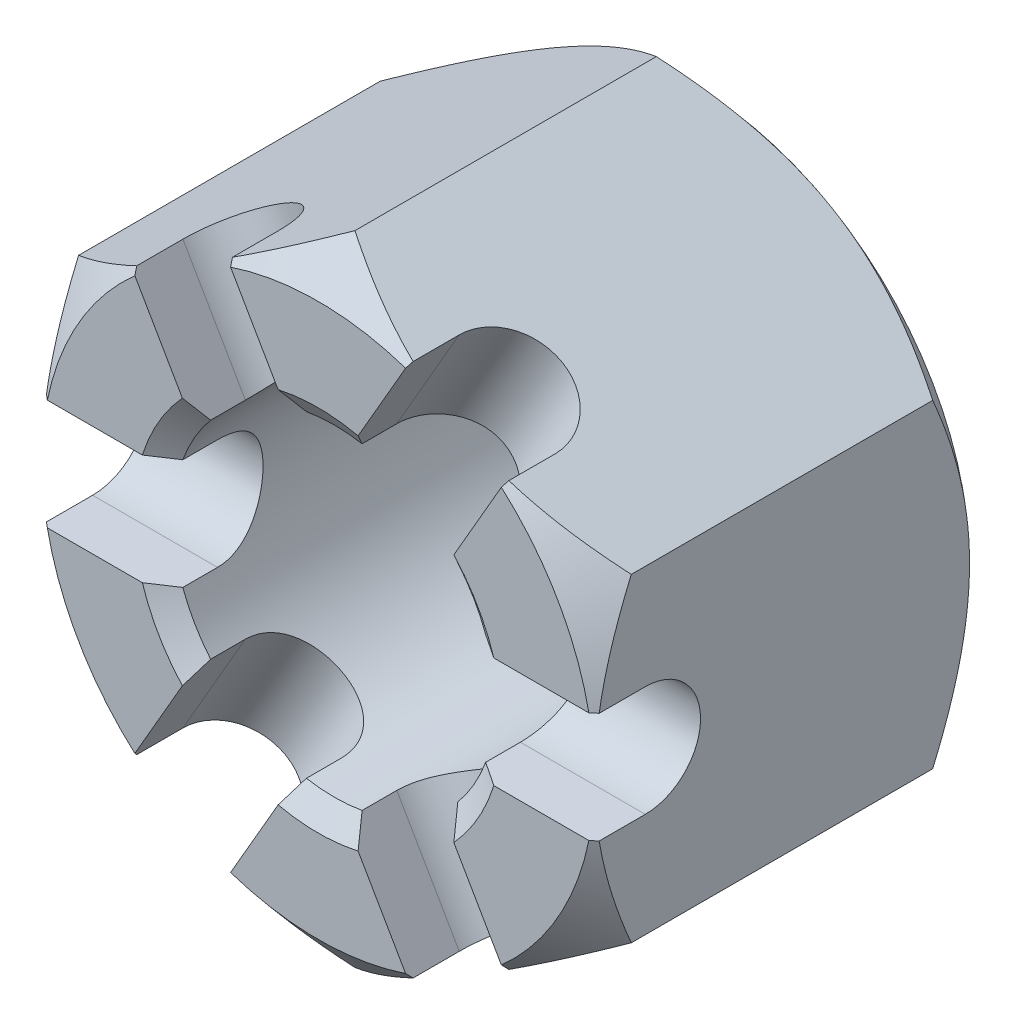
ISO-10303-21;
HEADER;
FILE_DESCRIPTION(('STEP AP214'),'2;1');
FILE_NAME('part.step','',(''),(''),'','','');
FILE_SCHEMA(('AUTOMOTIVE_DESIGN { 1 0 10303 214 1 1 1 1 }'));
ENDSEC;
DATA;
#1=APPLICATION_CONTEXT('core data for automotive mechanical design processes');
#2=APPLICATION_PROTOCOL_DEFINITION('international standard','automotive_design',2000,#1);
#3=PRODUCT_CONTEXT('',#1,'mechanical');
#4=PRODUCT('Part','Part','',(#3));
#5=PRODUCT_RELATED_PRODUCT_CATEGORY('part','',(#4));
#6=PRODUCT_DEFINITION_FORMATION('','',#4);
#7=PRODUCT_DEFINITION_CONTEXT('part definition',#1,'design');
#8=PRODUCT_DEFINITION('design','',#6,#7);
#9=PRODUCT_DEFINITION_SHAPE('','',#8);
#10=(LENGTH_UNIT() NAMED_UNIT(*) SI_UNIT(.MILLI.,.METRE.));
#11=(NAMED_UNIT(*) PLANE_ANGLE_UNIT() SI_UNIT($,.RADIAN.));
#12=(NAMED_UNIT(*) SI_UNIT($,.STERADIAN.) SOLID_ANGLE_UNIT());
#13=UNCERTAINTY_MEASURE_WITH_UNIT(LENGTH_MEASURE(1.E-05),#10,'distance_accuracy_value','');
#14=(GEOMETRIC_REPRESENTATION_CONTEXT(3) GLOBAL_UNCERTAINTY_ASSIGNED_CONTEXT((#13)) GLOBAL_UNIT_ASSIGNED_CONTEXT((#10,
#11,#12)) REPRESENTATION_CONTEXT('',''));
#15=CARTESIAN_POINT('',(0.,0.,0.));
#16=DIRECTION('',(0.,0.,1.));
#17=DIRECTION('',(1.,0.,0.));
#18=AXIS2_PLACEMENT_3D('',#15,#16,#17);
#19=CARTESIAN_POINT('',(0.,0.,-25.8572));
#20=DIRECTION('',(0.,0.,1.));
#21=DIRECTION('',(1.,0.,0.));
#22=AXIS2_PLACEMENT_3D('',#19,#20,#21);
#23=CYLINDRICAL_SURFACE('',#22,11.1125);
#24=CARTESIAN_POINT('',(0.,0.,-1.11157946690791));
#25=DIRECTION('',(0.,0.,1.));
#26=DIRECTION('',(1.,0.,0.));
#27=AXIS2_PLACEMENT_3D('',#24,#25,#26);
#28=CIRCLE('',#27,11.1125);
#29=CARTESIAN_POINT('',(10.4389442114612,-3.81,-1.11157946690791));
#30=VERTEX_POINT('',#29);
#31=CARTESIAN_POINT('',(8.51902889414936,-7.1353908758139,-1.11157946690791));
#32=VERTEX_POINT('',#31);
#33=EDGE_CURVE('E11',#30,#32,#28,.F.);
#34=ORIENTED_EDGE('',*,*,#33,.F.);
#35=DIRECTION('',(0.,0.,1.));
#36=VECTOR('',#35,1.);
#37=CARTESIAN_POINT('',(10.4389442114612,-3.81,-25.8572));
#38=LINE('',#37,#36);
#39=CARTESIAN_POINT('',(10.4389442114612,-3.81,-3.5052));
#40=VERTEX_POINT('',#39);
#41=EDGE_CURVE('E398',#30,#40,#38,.F.);
#42=ORIENTED_EDGE('',*,*,#41,.T.);
#43=CARTESIAN_POINT('',(10.4389442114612,-3.81,-3.5052));
#44=CARTESIAN_POINT('',(10.4389270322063,-3.81001390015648,-3.60895812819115));
#45=CARTESIAN_POINT('',(10.4404907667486,-3.80576182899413,-3.71270670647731));
#46=CARTESIAN_POINT('',(10.4466521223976,-3.78883407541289,-3.91939504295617));
#47=CARTESIAN_POINT('',(10.4512488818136,-3.77616078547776,-4.02233502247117));
#48=CARTESIAN_POINT('',(10.4633298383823,-3.74255067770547,-4.2263613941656));
#49=CARTESIAN_POINT('',(10.4708050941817,-3.72163944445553,-4.32745252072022));
#50=CARTESIAN_POINT('',(10.4883961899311,-3.67177022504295,-4.52736973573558));
#51=CARTESIAN_POINT('',(10.4985121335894,-3.64281192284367,-4.62619573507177));
#52=CARTESIAN_POINT('',(10.5323669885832,-3.54426041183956,-4.91813772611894));
#53=CARTESIAN_POINT('',(10.5596330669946,-3.46293794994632,-5.10703330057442));
#54=CARTESIAN_POINT('',(10.620467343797,-3.27159778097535,-5.46853550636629));
#55=CARTESIAN_POINT('',(10.6540396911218,-3.16156116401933,-5.64113130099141));
#56=CARTESIAN_POINT('',(10.7252512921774,-2.91104637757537,-5.97229958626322));
#57=CARTESIAN_POINT('',(10.7629956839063,-2.76958367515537,-6.13010626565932));
#58=CARTESIAN_POINT('',(10.8374132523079,-2.46233364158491,-6.42027940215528));
#59=CARTESIAN_POINT('',(10.8740862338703,-2.29654191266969,-6.55264124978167));
#60=CARTESIAN_POINT('',(10.9434601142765,-1.9396495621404,-6.79172394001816));
#61=CARTESIAN_POINT('',(10.9760222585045,-1.74797351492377,-6.89762973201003));
#62=CARTESIAN_POINT('',(11.0322530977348,-1.34822430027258,-7.07538178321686));
#63=CARTESIAN_POINT('',(11.0559246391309,-1.14015640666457,-7.14723894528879));
#64=CARTESIAN_POINT('',(11.0909600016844,-0.721613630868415,-7.25222575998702));
#65=CARTESIAN_POINT('',(11.1027429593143,-0.511506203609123,-7.28667779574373));
#66=CARTESIAN_POINT('',(11.1141650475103,-0.0881800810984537,-7.32008820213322));
#67=CARTESIAN_POINT('',(11.1138072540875,0.12503781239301,-7.31905556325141));
#68=CARTESIAN_POINT('',(11.1012679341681,0.539139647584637,-7.28234855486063));
#69=CARTESIAN_POINT('',(11.0895773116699,0.740168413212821,-7.24811243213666));
#70=CARTESIAN_POINT('',(11.0563084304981,1.13342964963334,-7.14835758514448));
#71=CARTESIAN_POINT('',(11.0347296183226,1.32566162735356,-7.08283710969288));
#72=CARTESIAN_POINT('',(10.9834997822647,1.69893857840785,-6.92157472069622));
#73=CARTESIAN_POINT('',(10.9537435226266,1.87979706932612,-6.82543602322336));
#74=CARTESIAN_POINT('',(10.8892366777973,2.22323120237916,-6.60598874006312));
#75=CARTESIAN_POINT('',(10.8544846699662,2.38580161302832,-6.48267240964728));
#76=CARTESIAN_POINT('',(10.7816036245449,2.69655710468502,-6.20523878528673));
#77=CARTESIAN_POINT('',(10.7433925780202,2.84363039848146,-6.04989816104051));
#78=CARTESIAN_POINT('',(10.6693121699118,3.11008276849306,-5.7163087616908));
#79=CARTESIAN_POINT('',(10.6334435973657,3.22945254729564,-5.53805232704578));
#80=CARTESIAN_POINT('',(10.5842464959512,3.3859171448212,-5.25550383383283));
#81=CARTESIAN_POINT('',(10.5685009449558,3.43462316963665,-5.15789267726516));
#82=CARTESIAN_POINT('',(10.5391753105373,3.52358264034,-4.95859359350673));
#83=CARTESIAN_POINT('',(10.5255943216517,3.56383962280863,-4.85690739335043));
#84=CARTESIAN_POINT('',(10.5010600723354,3.63549576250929,-4.65028455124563));
#85=CARTESIAN_POINT('',(10.490103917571,3.66690468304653,-4.54535163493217));
#86=CARTESIAN_POINT('',(10.4711773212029,3.72060598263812,-4.33295793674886));
#87=CARTESIAN_POINT('',(10.4632055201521,3.74290251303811,-4.22549832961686));
#88=CARTESIAN_POINT('',(10.4509540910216,3.77697460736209,-4.01612176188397));
#89=CARTESIAN_POINT('',(10.4464630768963,3.78935440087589,-3.91431514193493));
#90=CARTESIAN_POINT('',(10.4404517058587,3.80586883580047,-3.71007503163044));
#91=CARTESIAN_POINT('',(10.4389277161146,3.81001356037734,-3.60764246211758));
#92=CARTESIAN_POINT('',(10.4389442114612,3.81,-3.5052));
#93=B_SPLINE_CURVE_WITH_KNOTS('',3,(#43,#44,#45,#46,#47,#48,#49,#50,#51,#52,#53,#54,#55,#56,#57,
#58,#59,#60,#61,#62,#63,#64,#65,#66,#67,#68,#69,#70,#71,#72,#73,#74,#75,#76,#77,#78,#79,#80,#81,
#82,#83,#84,#85,#86,#87,#88,#89,#90,#91,#92),.UNSPECIFIED.,.F.,.F.,(4,2,2,2,2,2,2,2,2,2,2,2,2,2,
2,2,2,2,2,2,2,2,2,2,4),(0.,0.311159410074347,0.622230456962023,0.932342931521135,
1.24246758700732,1.86176723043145,2.48147575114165,3.12435952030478,3.7673596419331,
4.42823392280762,5.08889643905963,5.72535475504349,6.36165181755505,6.9715638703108,
7.5815100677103,8.19970630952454,8.8180789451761,9.46708892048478,10.1163163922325,
10.4466244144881,10.7767939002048,11.1065976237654,11.4362509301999,11.7438431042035,
12.0510584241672),.UNSPECIFIED.);
#94=CARTESIAN_POINT('',(10.4389442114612,3.81,-3.5052));
#95=VERTEX_POINT('',#94);
#96=EDGE_CURVE('E390',#40,#95,#93,.T.);
#97=ORIENTED_EDGE('',*,*,#96,.T.);
#98=DIRECTION('',(0.,0.,1.));
#99=VECTOR('',#98,1.);
#100=CARTESIAN_POINT('',(10.4389442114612,3.80999999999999,-25.8572));
#101=LINE('',#100,#99);
#102=CARTESIAN_POINT('',(10.4389442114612,3.80999999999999,-1.11157946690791));
#103=VERTEX_POINT('',#102);
#104=EDGE_CURVE('E367',#95,#103,#101,.T.);
#105=ORIENTED_EDGE('',*,*,#104,.T.);
#106=CARTESIAN_POINT('',(8.51902889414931,7.13539087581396,-1.11157946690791));
#107=VERTEX_POINT('',#106);
#108=EDGE_CURVE('E51',#107,#103,#28,.F.);
#109=ORIENTED_EDGE('',*,*,#108,.F.);
#110=DIRECTION('',(0.,0.,1.));
#111=VECTOR('',#110,1.);
#112=CARTESIAN_POINT('',(8.51902889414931,7.13539087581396,-25.8572));
#113=LINE('',#112,#111);
#114=CARTESIAN_POINT('',(8.51902889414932,7.13539087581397,-3.5052));
#115=VERTEX_POINT('',#114);
#116=EDGE_CURVE('E488',#107,#115,#113,.F.);
#117=ORIENTED_EDGE('',*,*,#116,.T.);
#118=CARTESIAN_POINT('',(1.91991531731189,10.945390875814,-3.5052));
#119=CARTESIAN_POINT('',(1.9199124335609,10.9453904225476,-3.29805961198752));
#120=CARTESIAN_POINT('',(1.93771040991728,10.94231384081,-3.09093487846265));
#121=CARTESIAN_POINT('',(2.00789515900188,10.9296504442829,-2.68284586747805));
#122=CARTESIAN_POINT('',(2.06028600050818,10.9200628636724,-2.48188231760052));
#123=CARTESIAN_POINT('',(2.19680436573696,10.893414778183,-2.09209849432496));
#124=CARTESIAN_POINT('',(2.28086673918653,10.8763696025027,-1.90325421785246));
#125=CARTESIAN_POINT('',(2.47698704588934,10.8333851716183,-1.54182476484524));
#126=CARTESIAN_POINT('',(2.58905169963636,10.8074437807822,-1.36924350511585));
#127=CARTESIAN_POINT('',(2.84158811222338,10.7438623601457,-1.0380903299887));
#128=CARTESIAN_POINT('',(2.98296994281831,10.705818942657,-0.880289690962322));
#129=CARTESIAN_POINT('',(3.28626422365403,10.6166417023,-0.59012176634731));
#130=CARTESIAN_POINT('',(3.44818018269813,10.5655056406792,-0.457758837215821));
#131=CARTESIAN_POINT('',(3.79194143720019,10.4471402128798,-0.218677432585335));
#132=CARTESIAN_POINT('',(3.97421547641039,10.3795031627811,-0.112773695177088));
#133=CARTESIAN_POINT('',(4.34852346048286,10.2283264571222,0.0649791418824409));
#134=CARTESIAN_POINT('',(4.54055459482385,10.1447913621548,0.136837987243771));
#135=CARTESIAN_POINT('',(4.92054606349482,9.96585908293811,0.241826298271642));
#136=CARTESIAN_POINT('',(5.10839771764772,9.87100873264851,0.276278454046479));
#137=CARTESIAN_POINT('',(5.48071986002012,9.66923727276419,0.309688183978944));
#138=CARTESIAN_POINT('',(5.66519125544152,9.56231945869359,0.30865542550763));
#139=CARTESIAN_POINT('',(6.01754151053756,9.34441088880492,0.271948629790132));
#140=CARTESIAN_POINT('',(6.18579120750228,9.23377282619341,0.237712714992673));
#141=CARTESIAN_POINT('',(6.50973104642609,9.00833066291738,0.137958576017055));
#142=CARTESIAN_POINT('',(6.66542032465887,8.89352627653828,0.0724382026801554));
#143=CARTESIAN_POINT('',(6.96307375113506,8.66252058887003,-0.0888257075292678));
#144=CARTESIAN_POINT('',(7.10482392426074,8.54632138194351,-0.184965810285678));
#145=CARTESIAN_POINT('',(7.36999182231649,8.31874114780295,-0.404408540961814));
#146=CARTESIAN_POINT('',(7.49340423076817,8.20736152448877,-0.527719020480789));
#147=CARTESIAN_POINT('',(7.72610123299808,7.98885223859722,-0.805181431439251));
#148=CARTESIAN_POINT('',(7.83438073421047,7.88220781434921,-0.960560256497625));
#149=CARTESIAN_POINT('',(8.02806996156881,7.6848498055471,-1.29408701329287));
#150=CARTESIAN_POINT('',(8.11347572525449,7.59413898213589,-1.47223888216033));
#151=CARTESIAN_POINT('',(8.26172154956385,7.43262193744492,-1.84996798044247));
#152=CARTESIAN_POINT('',(8.32418245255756,7.3621540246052,-2.04984006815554));
#153=CARTESIAN_POINT('',(8.42378414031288,7.24798765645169,-2.46307117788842));
#154=CARTESIAN_POINT('',(8.46093627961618,7.20427719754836,-2.67642410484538));
#155=CARTESIAN_POINT('',(8.50820983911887,7.14837786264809,-3.09972685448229));
#156=CARTESIAN_POINT('',(8.51952921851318,7.1347928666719,-3.30935850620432));
#157=CARTESIAN_POINT('',(8.51849486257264,7.13602912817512,-3.72845561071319));
#158=CARTESIAN_POINT('',(8.50614575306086,7.15084483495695,-3.9379210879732));
#159=CARTESIAN_POINT('',(8.45889258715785,7.20666556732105,-4.34263384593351));
#160=CARTESIAN_POINT('',(8.42484170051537,7.24667929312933,-4.53812034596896));
#161=CARTESIAN_POINT('',(8.33546335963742,7.34930643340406,-4.91796436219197));
#162=CARTESIAN_POINT('',(8.28013199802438,7.41192399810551,-5.10231982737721));
#163=CARTESIAN_POINT('',(8.14661253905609,7.5584700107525,-5.46143276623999));
#164=CARTESIAN_POINT('',(8.06772882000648,7.64303496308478,-5.63567092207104));
#165=CARTESIAN_POINT('',(7.88861937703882,7.82776259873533,-5.96374071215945));
#166=CARTESIAN_POINT('',(7.78838701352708,7.92793013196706,-6.11756597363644));
#167=CARTESIAN_POINT('',(7.56179320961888,8.14448875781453,-6.40861775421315));
#168=CARTESIAN_POINT('',(7.43435399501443,8.26144893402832,-6.54458562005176));
#169=CARTESIAN_POINT('',(7.15844290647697,8.50163263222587,-6.78635464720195));
#170=CARTESIAN_POINT('',(7.00997164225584,8.62485597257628,-6.89215668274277));
#171=CARTESIAN_POINT('',(6.6954738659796,8.87118330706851,-7.06966301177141));
#172=CARTESIAN_POINT('',(6.52956049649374,8.99428340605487,-7.14157226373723));
#173=CARTESIAN_POINT('',(6.18327660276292,9.23575767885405,-7.24953350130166));
#174=CARTESIAN_POINT('',(6.00291166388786,9.35413365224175,-7.28559926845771));
#175=CARTESIAN_POINT('',(5.64209346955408,9.57585822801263,-7.31955354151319));
#176=CARTESIAN_POINT('',(5.46208695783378,9.67966071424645,-7.31924428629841));
#177=CARTESIAN_POINT('',(5.09904773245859,9.8757236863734,-7.28494471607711));
#178=CARTESIAN_POINT('',(4.91601529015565,9.9679852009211,-7.25095740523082));
#179=CARTESIAN_POINT('',(4.55585131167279,10.1375955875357,-7.15148109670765));
#180=CARTESIAN_POINT('',(4.37867262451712,10.2151785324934,-7.08655758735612));
#181=CARTESIAN_POINT('',(4.0321779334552,10.3568465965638,-6.92758299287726));
#182=CARTESIAN_POINT('',(3.86286338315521,10.4209292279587,-6.83352654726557));
#183=CARTESIAN_POINT('',(3.53083026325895,10.5381729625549,-6.61482514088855));
#184=CARTESIAN_POINT('',(3.36861156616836,10.5908226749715,-6.4891479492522));
#185=CARTESIAN_POINT('',(3.06311904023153,10.683186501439,-6.21249893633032));
#186=CARTESIAN_POINT('',(2.9198514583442,10.7228963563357,-6.06151881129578));
#187=CARTESIAN_POINT('',(2.65161153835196,10.7924344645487,-5.73096175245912));
#188=CARTESIAN_POINT('',(2.52766282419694,10.8217765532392,-5.55044877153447));
#189=CARTESIAN_POINT('',(2.3109010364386,10.8701326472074,-5.17033095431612));
#190=CARTESIAN_POINT('',(2.2180821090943,10.8891485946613,-4.97072971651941));
#191=CARTESIAN_POINT('',(2.07012479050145,10.9182333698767,-4.56324051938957));
#192=CARTESIAN_POINT('',(2.0140713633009,10.9285215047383,-4.3557018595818));
#193=CARTESIAN_POINT('',(1.93897554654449,10.9420990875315,-3.93383470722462));
#194=CARTESIAN_POINT('',(1.91991830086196,10.9453913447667,-3.71950897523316));
#195=CARTESIAN_POINT('',(1.91991531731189,10.945390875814,-3.5052));
#196=B_SPLINE_CURVE_WITH_KNOTS('',3,(#118,#119,#120,#121,#122,#123,#124,#125,#126,#127,#128,
#129,#130,#131,#132,#133,#134,#135,#136,#137,#138,#139,#140,#141,#142,#143,#144,#145,#146,#147,
#148,#149,#150,#151,#152,#153,#154,#155,#156,#157,#158,#159,#160,#161,#162,#163,#164,#165,#166,
#167,#168,#169,#170,#171,#172,#173,#174,#175,#176,#177,#178,#179,#180,#181,#182,#183,#184,#185,
#186,#187,#188,#189,#190,#191,#192,#193,#194,#195),.UNSPECIFIED.,.T.,.F.,(4,2,2,2,2,2,2,2,2,2,2,
2,2,2,2,2,2,2,2,2,2,2,2,2,2,2,2,2,2,2,2,2,2,2,2,2,2,2,4),(0.,0.620626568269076,1.2413261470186,
1.8607558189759,2.48033429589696,3.12322123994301,3.76621818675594,4.42708123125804,
5.08775498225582,5.72421936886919,6.36051036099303,6.97041853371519,7.58036861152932,
8.19856361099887,8.81693748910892,9.46600003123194,10.1151749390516,10.7746401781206,
11.4338093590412,12.0617290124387,12.6895259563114,13.294048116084,13.8986813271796,
14.5233179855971,15.1481491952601,15.8050789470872,16.4619896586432,17.1148752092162,
17.7675096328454,18.3878229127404,19.008080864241,19.6174122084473,20.2268557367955,
20.8596060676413,21.4925644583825,22.1521592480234,22.8116299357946,23.4539927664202,
24.0960975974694),.UNSPECIFIED.);
#197=CARTESIAN_POINT('',(1.91991531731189,10.945390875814,-3.5052));
#198=VERTEX_POINT('',#197);
#199=EDGE_CURVE('E478',#115,#198,#196,.T.);
#200=ORIENTED_EDGE('',*,*,#199,.T.);
#201=DIRECTION('',(0.,0.,1.));
#202=VECTOR('',#201,1.);
#203=CARTESIAN_POINT('',(1.91991531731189,10.9453908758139,-25.8572));
#204=LINE('',#203,#202);
#205=CARTESIAN_POINT('',(1.91991531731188,10.9453908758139,-1.11157946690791));
#206=VERTEX_POINT('',#205);
#207=EDGE_CURVE('E487',#198,#206,#204,.T.);
#208=ORIENTED_EDGE('',*,*,#207,.T.);
#209=CARTESIAN_POINT('',(-1.91991531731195,10.9453908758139,-1.11157946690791));
#210=VERTEX_POINT('',#209);
#211=EDGE_CURVE('E751',#210,#206,#28,.F.);
#212=ORIENTED_EDGE('',*,*,#211,.F.);
#213=DIRECTION('',(0.,0.,1.));
#214=VECTOR('',#213,1.);
#215=CARTESIAN_POINT('',(-1.91991531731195,10.9453908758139,-25.8572));
#216=LINE('',#215,#214);
#217=CARTESIAN_POINT('',(-1.91991531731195,10.9453908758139,-3.5052));
#218=VERTEX_POINT('',#217);
#219=EDGE_CURVE('E455',#210,#218,#216,.F.);
#220=ORIENTED_EDGE('',*,*,#219,.T.);
#221=CARTESIAN_POINT('',(-8.51902889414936,7.13539087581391,-3.5052));
#222=CARTESIAN_POINT('',(-8.51902994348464,7.1353881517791,-3.29805961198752));
#223=CARTESIAN_POINT('',(-8.50746655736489,7.14926336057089,-3.09093487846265));
#224=CARTESIAN_POINT('',(-8.46140735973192,7.20371343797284,-2.68284586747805));
#225=CARTESIAN_POINT('',(-8.42690885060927,7.2442914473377,-2.48188231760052));
#226=CARTESIAN_POINT('',(-8.33557174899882,7.34919577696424,-2.09209849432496));
#227=CARTESIAN_POINT('',(-8.27877900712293,7.41347334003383,-1.90325421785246));
#228=CARTESIAN_POINT('',(-8.14349324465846,7.56182629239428,-1.54182476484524));
#229=CARTESIAN_POINT('',(-8.06499501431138,7.64590643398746,-1.36924350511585));
#230=CARTESIAN_POINT('',(-7.88366368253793,7.83281867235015,-1.0380903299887));
#231=CARTESIAN_POINT('',(-7.78002620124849,7.93623722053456,-0.880289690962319));
#232=CARTESIAN_POINT('',(-7.55114930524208,8.15430915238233,-0.590121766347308));
#233=CARTESIAN_POINT('',(-7.42590619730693,8.26896445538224,-0.457758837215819));
#234=CARTESIAN_POINT('',(-7.15151810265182,8.50748772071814,-0.218677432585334));
#235=CARTESIAN_POINT('',(-7.00180567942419,8.63152314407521,-0.112773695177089));
#236=CARTESIAN_POINT('',(-6.68372881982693,8.88009501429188,0.0649791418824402));
#237=CARTESIAN_POINT('',(-6.51536973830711,9.00463130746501,0.13683798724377));
#238=CARTESIAN_POINT('',(-6.1704141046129,9.24424743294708,0.241826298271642));
#239=CARTESIAN_POINT('',(-5.9943454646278,9.35950656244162,0.27627845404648));
#240=CARTESIAN_POINT('',(-5.63344518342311,9.5810612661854,0.309688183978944));
#241=CARTESIAN_POINT('',(-5.44861594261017,9.6873592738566,0.30865542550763));
#242=CARTESIAN_POINT('',(-5.08372645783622,9.88354926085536,0.271948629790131));
#243=CARTESIAN_POINT('',(-4.9037862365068,9.97393874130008,0.237712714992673));
#244=CARTESIAN_POINT('',(-4.54657767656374,10.1417577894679,0.137958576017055));
#245=CARTESIAN_POINT('',(-4.36930952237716,10.2191864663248,0.0724382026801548));
#246=CARTESIAN_POINT('',(-4.02042601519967,10.3614590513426,-0.0888257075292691));
#247=CARTESIAN_POINT('',(-3.84891946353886,10.426118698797,-0.18496581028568));
#248=CARTESIAN_POINT('',(-3.51924525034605,10.5419707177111,-0.404408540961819));
#249=CARTESIAN_POINT('',(-3.36108146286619,10.5931591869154,-0.527719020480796));
#250=CARTESIAN_POINT('',(-3.05549836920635,10.6854260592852,-0.805181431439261));
#251=CARTESIAN_POINT('',(-2.90900183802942,10.7258766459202,-0.960560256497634));
#252=CARTESIAN_POINT('',(-2.64124017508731,10.7949374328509,-1.29408701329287));
#253=CARTESIAN_POINT('',(-2.51997941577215,10.8235455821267,-1.47223888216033));
#254=CARTESIAN_POINT('',(-2.30597863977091,10.8711717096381,-1.84996798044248));
#255=CARTESIAN_POINT('',(-2.2137211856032,10.8900304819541,-2.04984006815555));
#256=CARTESIAN_POINT('',(-2.06504936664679,10.9192048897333,-2.46307117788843));
#257=CARTESIAN_POINT('',(-2.00861892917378,10.9295243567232,-2.67642410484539));
#258=CARTESIAN_POINT('',(-1.93657190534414,10.9425147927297,-3.0997268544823));
#259=CARTESIAN_POINT('',(-1.91914726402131,10.9455251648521,-3.30935850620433));
#260=CARTESIAN_POINT('',(-1.92073507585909,10.9452475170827,-3.72845561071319));
#261=CARTESIAN_POINT('',(-1.93974040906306,10.9419607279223,-3.93792108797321));
#262=CARTESIAN_POINT('',(-2.01170916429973,10.9289486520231,-4.34263384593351));
#263=CARTESIAN_POINT('',(-2.06338751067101,10.9194665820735,-4.53812034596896));
#264=CARTESIAN_POINT('',(-2.19695439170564,10.8933762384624,-4.91796436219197));
#265=CARTESIAN_POINT('',(-2.27884847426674,10.8767666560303,-5.10231982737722));
#266=CARTESIAN_POINT('',(-2.47252077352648,10.8344084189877,-5.46143276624));
#267=CARTESIAN_POINT('',(-2.58519803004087,10.8083755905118,-5.63567092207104));
#268=CARTESIAN_POINT('',(-2.83473157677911,10.7456260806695,-5.96374071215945));
#269=CARTESIAN_POINT('',(-2.97159538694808,10.7089060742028,-6.11756597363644));
#270=CARTESIAN_POINT('',(-3.27243756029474,10.6209493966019,-6.40861775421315));
#271=CARTESIAN_POINT('',(-3.43744765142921,10.569063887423,-6.54458562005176));
#272=CARTESIAN_POINT('',(-3.78340837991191,10.4502097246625,-6.78635464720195));
#273=CARTESIAN_POINT('',(-3.96435855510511,10.3832415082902,-6.89215668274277));
#274=CARTESIAN_POINT('',(-4.33493317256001,10.2340421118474,-7.06966301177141));
#275=CARTESIAN_POINT('',(-4.5244976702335,10.1519069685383,-7.14157226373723));
#276=CARTESIAN_POINT('',(-4.90676247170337,9.97275345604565,-7.24953350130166));
#277=CARTESIAN_POINT('',(-5.09946154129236,9.87574082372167,-7.28559926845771));
#278=CARTESIAN_POINT('',(-5.47188975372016,9.67412538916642,-7.31955354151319));
#279=CARTESIAN_POINT('',(-5.65178859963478,9.57013642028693,-7.31924428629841));
#280=CARTESIAN_POINT('',(-6.00310372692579,9.35376671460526,-7.28494471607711));
#281=CARTESIAN_POINT('',(-6.17452076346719,9.24138672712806,-7.25095740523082));
#282=CARTESIAN_POINT('',(-6.50148965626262,9.01428076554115,-7.15148109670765));
#283=CARTESIAN_POINT('',(-6.6572678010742,8.89963099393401,-7.08655758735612));
#284=CARTESIAN_POINT('',(-6.95320328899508,8.67039182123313,-6.92758299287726));
#285=CARTESIAN_POINT('',(-7.09335775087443,8.55580243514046,-6.83352654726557));
#286=CARTESIAN_POINT('',(-7.36091036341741,8.32687518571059,-6.61482514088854));
#287=CARTESIAN_POINT('',(-7.48761570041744,8.21271452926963,-6.4891479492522));
#288=CARTESIAN_POINT('',(-7.72035138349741,7.99433215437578,-6.21249893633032));
#289=CARTESIAN_POINT('',(-7.82637491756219,7.89011371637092,-6.06151881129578));
#290=CARTESIAN_POINT('',(-8.02071664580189,7.69258018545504,-5.73096175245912));
#291=CARTESIAN_POINT('',(-8.1081019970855,7.59990849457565,-5.55044877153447));
#292=CARTESIAN_POINT('',(-8.25836049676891,7.4363653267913,-5.17033095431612));
#293=CARTESIAN_POINT('',(-8.32123825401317,7.36548975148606,-4.97072971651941));
#294=CARTESIAN_POINT('',(-8.42040506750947,7.25189734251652,-4.56324051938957));
#295=CARTESIAN_POINT('',(-8.45734156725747,7.20849771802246,-4.3557018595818));
#296=CARTESIAN_POINT('',(-8.5066480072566,7.15025162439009,-3.93383470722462));
#297=CARTESIAN_POINT('',(-8.51902780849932,7.13539369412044,-3.71950897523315));
#298=CARTESIAN_POINT('',(-8.51902889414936,7.13539087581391,-3.5052));
#299=B_SPLINE_CURVE_WITH_KNOTS('',3,(#221,#222,#223,#224,#225,#226,#227,#228,#229,#230,#231,
#232,#233,#234,#235,#236,#237,#238,#239,#240,#241,#242,#243,#244,#245,#246,#247,#248,#249,#250,
#251,#252,#253,#254,#255,#256,#257,#258,#259,#260,#261,#262,#263,#264,#265,#266,#267,#268,#269,
#270,#271,#272,#273,#274,#275,#276,#277,#278,#279,#280,#281,#282,#283,#284,#285,#286,#287,#288,
#289,#290,#291,#292,#293,#294,#295,#296,#297,#298),.UNSPECIFIED.,.T.,.F.,(4,2,2,2,2,2,2,2,2,2,2,
2,2,2,2,2,2,2,2,2,2,2,2,2,2,2,2,2,2,2,2,2,2,2,2,2,2,2,4),(0.,0.620626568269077,1.2413261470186,
1.8607558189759,2.48033429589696,3.12322123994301,3.76621818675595,4.42708123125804,
5.08775498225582,5.7242193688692,6.36051036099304,6.97041853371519,7.58036861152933,
8.19856361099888,8.81693748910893,9.46600003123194,10.1151749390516,10.7746401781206,
11.4338093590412,12.0617290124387,12.6895259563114,13.294048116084,13.8986813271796,
14.5233179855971,15.1481491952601,15.8050789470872,16.4619896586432,17.1148752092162,
17.7675096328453,18.3878229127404,19.008080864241,19.6174122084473,20.2268557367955,
20.8596060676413,21.4925644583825,22.1521592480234,22.8116299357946,23.4539927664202,
24.0960975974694),.UNSPECIFIED.);
#300=CARTESIAN_POINT('',(-8.51902889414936,7.13539087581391,-3.5052));
#301=VERTEX_POINT('',#300);
#302=EDGE_CURVE('E447',#218,#301,#299,.T.);
#303=ORIENTED_EDGE('',*,*,#302,.T.);
#304=DIRECTION('',(0.,0.,1.));
#305=VECTOR('',#304,1.);
#306=CARTESIAN_POINT('',(-8.51902889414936,7.13539087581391,-25.8572));
#307=LINE('',#306,#305);
#308=CARTESIAN_POINT('',(-8.51902889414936,7.13539087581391,-1.11157946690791));
#309=VERTEX_POINT('',#308);
#310=EDGE_CURVE('E452',#301,#309,#307,.T.);
#311=ORIENTED_EDGE('',*,*,#310,.T.);
#312=CARTESIAN_POINT('',(-10.4389442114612,3.81,-1.11157946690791));
#313=VERTEX_POINT('',#312);
#314=EDGE_CURVE('E748',#313,#309,#28,.F.);
#315=ORIENTED_EDGE('',*,*,#314,.F.);
#316=DIRECTION('',(0.,0.,1.));
#317=VECTOR('',#316,1.);
#318=CARTESIAN_POINT('',(-10.4389442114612,3.81,-25.8572));
#319=LINE('',#318,#317);
#320=CARTESIAN_POINT('',(-10.4389442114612,3.81,-3.5052));
#321=VERTEX_POINT('',#320);
#322=EDGE_CURVE('E420',#313,#321,#319,.F.);
#323=ORIENTED_EDGE('',*,*,#322,.T.);
#324=CARTESIAN_POINT('',(-10.4389442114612,3.81,-3.5052));
#325=CARTESIAN_POINT('',(-10.4389270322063,3.81001390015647,-3.60895812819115));
#326=CARTESIAN_POINT('',(-10.4404907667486,3.80576182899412,-3.71270670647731));
#327=CARTESIAN_POINT('',(-10.4466521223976,3.78883407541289,-3.91939504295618));
#328=CARTESIAN_POINT('',(-10.4512488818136,3.77616078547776,-4.02233502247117));
#329=CARTESIAN_POINT('',(-10.4633298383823,3.74255067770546,-4.2263613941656));
#330=CARTESIAN_POINT('',(-10.4708050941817,3.72163944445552,-4.32745252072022));
#331=CARTESIAN_POINT('',(-10.4883961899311,3.67177022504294,-4.52736973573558));
#332=CARTESIAN_POINT('',(-10.4985121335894,3.64281192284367,-4.62619573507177));
#333=CARTESIAN_POINT('',(-10.5323669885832,3.54426041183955,-4.91813772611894));
#334=CARTESIAN_POINT('',(-10.5596330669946,3.46293794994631,-5.10703330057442));
#335=CARTESIAN_POINT('',(-10.620467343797,3.27159778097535,-5.46853550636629));
#336=CARTESIAN_POINT('',(-10.6540396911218,3.16156116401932,-5.64113130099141));
#337=CARTESIAN_POINT('',(-10.7252512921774,2.91104637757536,-5.97229958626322));
#338=CARTESIAN_POINT('',(-10.7629956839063,2.76958367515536,-6.13010626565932));
#339=CARTESIAN_POINT('',(-10.8374132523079,2.4623336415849,-6.42027940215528));
#340=CARTESIAN_POINT('',(-10.8740862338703,2.29654191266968,-6.55264124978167));
#341=CARTESIAN_POINT('',(-10.9434601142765,1.93964956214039,-6.79172394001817));
#342=CARTESIAN_POINT('',(-10.9760222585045,1.74797351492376,-6.89762973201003));
#343=CARTESIAN_POINT('',(-11.0322530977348,1.34822430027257,-7.07538178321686));
#344=CARTESIAN_POINT('',(-11.0559246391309,1.14015640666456,-7.14723894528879));
#345=CARTESIAN_POINT('',(-11.0909600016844,0.721613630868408,-7.25222575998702));
#346=CARTESIAN_POINT('',(-11.1027429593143,0.511506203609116,-7.28667779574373));
#347=CARTESIAN_POINT('',(-11.1141650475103,0.0881800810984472,-7.32008820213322));
#348=CARTESIAN_POINT('',(-11.1138072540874,-0.125037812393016,-7.31905556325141));
#349=CARTESIAN_POINT('',(-11.1012679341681,-0.539139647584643,-7.28234855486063));
#350=CARTESIAN_POINT('',(-11.0895773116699,-0.740168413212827,-7.24811243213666));
#351=CARTESIAN_POINT('',(-11.0563084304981,-1.13342964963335,-7.14835758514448));
#352=CARTESIAN_POINT('',(-11.0347296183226,-1.32566162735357,-7.08283710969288));
#353=CARTESIAN_POINT('',(-10.9834997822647,-1.69893857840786,-6.92157472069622));
#354=CARTESIAN_POINT('',(-10.9537435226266,-1.87979706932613,-6.82543602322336));
#355=CARTESIAN_POINT('',(-10.8892366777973,-2.22323120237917,-6.60598874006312));
#356=CARTESIAN_POINT('',(-10.8544846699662,-2.38580161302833,-6.48267240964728));
#357=CARTESIAN_POINT('',(-10.7816036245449,-2.69655710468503,-6.20523878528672));
#358=CARTESIAN_POINT('',(-10.7433925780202,-2.84363039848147,-6.04989816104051));
#359=CARTESIAN_POINT('',(-10.6693121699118,-3.11008276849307,-5.7163087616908));
#360=CARTESIAN_POINT('',(-10.6334435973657,-3.22945254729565,-5.53805232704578));
#361=CARTESIAN_POINT('',(-10.5842464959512,-3.38591714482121,-5.25550383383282));
#362=CARTESIAN_POINT('',(-10.5685009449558,-3.43462316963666,-5.15789267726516));
#363=CARTESIAN_POINT('',(-10.5391753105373,-3.52358264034,-4.95859359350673));
#364=CARTESIAN_POINT('',(-10.5255943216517,-3.56383962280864,-4.85690739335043));
#365=CARTESIAN_POINT('',(-10.5010600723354,-3.6354957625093,-4.65028455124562));
#366=CARTESIAN_POINT('',(-10.490103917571,-3.66690468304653,-4.54535163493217));
#367=CARTESIAN_POINT('',(-10.4711773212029,-3.72060598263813,-4.33295793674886));
#368=CARTESIAN_POINT('',(-10.4632055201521,-3.74290251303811,-4.22549832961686));
#369=CARTESIAN_POINT('',(-10.4509540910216,-3.7769746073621,-4.01612176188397));
#370=CARTESIAN_POINT('',(-10.4464630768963,-3.7893544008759,-3.91431514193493));
#371=CARTESIAN_POINT('',(-10.4404517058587,-3.80586883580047,-3.71007503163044));
#372=CARTESIAN_POINT('',(-10.4389277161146,-3.81001356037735,-3.60764246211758));
#373=CARTESIAN_POINT('',(-10.4389442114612,-3.81,-3.5052));
#374=B_SPLINE_CURVE_WITH_KNOTS('',3,(#324,#325,#326,#327,#328,#329,#330,#331,#332,#333,#334,
#335,#336,#337,#338,#339,#340,#341,#342,#343,#344,#345,#346,#347,#348,#349,#350,#351,#352,#353,
#354,#355,#356,#357,#358,#359,#360,#361,#362,#363,#364,#365,#366,#367,#368,#369,#370,#371,#372,
#373),.UNSPECIFIED.,.F.,.F.,(4,2,2,2,2,2,2,2,2,2,2,2,2,2,2,2,2,2,2,2,2,2,2,2,4),(0.,
0.311159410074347,0.622230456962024,0.932342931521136,1.24246758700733,1.86176723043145,
2.48147575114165,3.12435952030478,3.7673596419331,4.42823392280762,5.08889643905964,
5.72535475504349,6.36165181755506,6.9715638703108,7.5815100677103,8.19970630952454,
8.8180789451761,9.46708892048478,10.1163163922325,10.4466244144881,10.7767939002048,
11.1065976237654,11.4362509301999,11.7438431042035,12.0510584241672),.UNSPECIFIED.);
#375=CARTESIAN_POINT('',(-10.4389442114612,-3.81,-3.5052));
#376=VERTEX_POINT('',#375);
#377=EDGE_CURVE('E412',#321,#376,#374,.T.);
#378=ORIENTED_EDGE('',*,*,#377,.T.);
#379=DIRECTION('',(0.,0.,1.));
#380=VECTOR('',#379,1.);
#381=CARTESIAN_POINT('',(-10.4389442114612,-3.81,-25.8572));
#382=LINE('',#381,#380);
#383=CARTESIAN_POINT('',(-10.4389442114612,-3.81,-1.11157946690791));
#384=VERTEX_POINT('',#383);
#385=EDGE_CURVE('E417',#376,#384,#382,.T.);
#386=ORIENTED_EDGE('',*,*,#385,.T.);
#387=CARTESIAN_POINT('',(-8.51902889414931,-7.13539087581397,-1.11157946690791));
#388=VERTEX_POINT('',#387);
#389=EDGE_CURVE('E755',#388,#384,#28,.F.);
#390=ORIENTED_EDGE('',*,*,#389,.F.);
#391=DIRECTION('',(0.,0.,1.));
#392=VECTOR('',#391,1.);
#393=CARTESIAN_POINT('',(-8.51902889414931,-7.13539087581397,-25.8572));
#394=LINE('',#393,#392);
#395=CARTESIAN_POINT('',(-8.51902889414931,-7.13539087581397,-3.5052));
#396=VERTEX_POINT('',#395);
#397=EDGE_CURVE('E460',#388,#396,#394,.F.);
#398=ORIENTED_EDGE('',*,*,#397,.T.);
#399=CARTESIAN_POINT('',(-8.51902889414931,-7.13539087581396,-3.5052));
#400=CARTESIAN_POINT('',(-8.51902994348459,-7.13538815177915,-3.71234038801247));
#401=CARTESIAN_POINT('',(-8.50746655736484,-7.14926336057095,-3.91946512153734));
#402=CARTESIAN_POINT('',(-8.46140735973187,-7.2037134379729,-4.32755413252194));
#403=CARTESIAN_POINT('',(-8.42690885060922,-7.24429144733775,-4.52851768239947));
#404=CARTESIAN_POINT('',(-8.33557174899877,-7.34919577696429,-4.91830150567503));
#405=CARTESIAN_POINT('',(-8.27877900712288,-7.41347334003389,-5.10714578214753));
#406=CARTESIAN_POINT('',(-8.14349324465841,-7.56182629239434,-5.46857523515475));
#407=CARTESIAN_POINT('',(-8.06499501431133,-7.64590643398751,-5.64115649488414));
#408=CARTESIAN_POINT('',(-7.88366368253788,-7.83281867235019,-5.97230967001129));
#409=CARTESIAN_POINT('',(-7.78002620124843,-7.93623722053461,-6.13011030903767));
#410=CARTESIAN_POINT('',(-7.55114930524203,-8.15430915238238,-6.42027823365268));
#411=CARTESIAN_POINT('',(-7.42590619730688,-8.26896445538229,-6.55264116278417));
#412=CARTESIAN_POINT('',(-7.15151810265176,-8.50748772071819,-6.79172256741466));
#413=CARTESIAN_POINT('',(-7.00180567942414,-8.63152314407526,-6.8976263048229));
#414=CARTESIAN_POINT('',(-6.68372881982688,-8.88009501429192,-7.07537914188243));
#415=CARTESIAN_POINT('',(-6.51536973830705,-9.00463130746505,-7.14723798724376));
#416=CARTESIAN_POINT('',(-6.17041410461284,-9.24424743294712,-7.25222629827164));
#417=CARTESIAN_POINT('',(-5.99434546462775,-9.35950656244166,-7.28667845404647));
#418=CARTESIAN_POINT('',(-5.63344518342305,-9.58106126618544,-7.32008818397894));
#419=CARTESIAN_POINT('',(-5.44861594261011,-9.68735927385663,-7.31905542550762));
#420=CARTESIAN_POINT('',(-5.08372645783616,-9.88354926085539,-7.28234862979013));
#421=CARTESIAN_POINT('',(-4.90378623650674,-9.97393874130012,-7.24811271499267));
#422=CARTESIAN_POINT('',(-4.54657767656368,-10.141757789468,-7.14835857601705));
#423=CARTESIAN_POINT('',(-4.3693095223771,-10.2191864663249,-7.08283820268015));
#424=CARTESIAN_POINT('',(-4.0204260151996,-10.3614590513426,-6.92157429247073));
#425=CARTESIAN_POINT('',(-3.84891946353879,-10.426118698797,-6.82543418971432));
#426=CARTESIAN_POINT('',(-3.51924525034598,-10.5419707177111,-6.60599145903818));
#427=CARTESIAN_POINT('',(-3.36108146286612,-10.5931591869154,-6.4826809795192));
#428=CARTESIAN_POINT('',(-3.05549836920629,-10.6854260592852,-6.20521856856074));
#429=CARTESIAN_POINT('',(-2.90900183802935,-10.7258766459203,-6.04983974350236));
#430=CARTESIAN_POINT('',(-2.64124017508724,-10.7949374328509,-5.71631298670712));
#431=CARTESIAN_POINT('',(-2.51997941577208,-10.8235455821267,-5.53816111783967));
#432=CARTESIAN_POINT('',(-2.30597863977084,-10.8711717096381,-5.16043201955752));
#433=CARTESIAN_POINT('',(-2.21372118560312,-10.8900304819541,-4.96055993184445));
#434=CARTESIAN_POINT('',(-2.06504936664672,-10.9192048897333,-4.54732882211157));
#435=CARTESIAN_POINT('',(-2.00861892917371,-10.9295243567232,-4.33397589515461));
#436=CARTESIAN_POINT('',(-1.93657190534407,-10.9425147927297,-3.9106731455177));
#437=CARTESIAN_POINT('',(-1.91914726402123,-10.9455251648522,-3.70104149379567));
#438=CARTESIAN_POINT('',(-1.92073507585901,-10.9452475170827,-3.28194438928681));
#439=CARTESIAN_POINT('',(-1.93974040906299,-10.9419607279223,-3.07247891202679));
#440=CARTESIAN_POINT('',(-2.01170916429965,-10.9289486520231,-2.66776615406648));
#441=CARTESIAN_POINT('',(-2.06338751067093,-10.9194665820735,-2.47227965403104));
#442=CARTESIAN_POINT('',(-2.19695439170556,-10.8933762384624,-2.09243563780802));
#443=CARTESIAN_POINT('',(-2.27884847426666,-10.8767666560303,-1.90808017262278));
#444=CARTESIAN_POINT('',(-2.47252077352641,-10.8344084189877,-1.54896723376));
#445=CARTESIAN_POINT('',(-2.58519803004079,-10.8083755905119,-1.37472907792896));
#446=CARTESIAN_POINT('',(-2.83473157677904,-10.7456260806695,-1.04665928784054));
#447=CARTESIAN_POINT('',(-2.97159538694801,-10.7089060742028,-0.892834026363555));
#448=CARTESIAN_POINT('',(-3.27243756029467,-10.6209493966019,-0.601782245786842));
#449=CARTESIAN_POINT('',(-3.43744765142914,-10.569063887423,-0.465814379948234));
#450=CARTESIAN_POINT('',(-3.78340837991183,-10.4502097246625,-0.224045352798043));
#451=CARTESIAN_POINT('',(-3.96435855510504,-10.3832415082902,-0.118243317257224));
#452=CARTESIAN_POINT('',(-4.33493317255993,-10.2340421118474,0.0592630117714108));
#453=CARTESIAN_POINT('',(-4.52449767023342,-10.1519069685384,0.131172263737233));
#454=CARTESIAN_POINT('',(-4.9067624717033,-9.97275345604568,0.239133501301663));
#455=CARTESIAN_POINT('',(-5.09946154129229,-9.8757408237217,0.275199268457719));
#456=CARTESIAN_POINT('',(-5.47188975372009,-9.67412538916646,0.309153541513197));
#457=CARTESIAN_POINT('',(-5.65178859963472,-9.57013642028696,0.308844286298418));
#458=CARTESIAN_POINT('',(-6.00310372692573,-9.3537667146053,0.274544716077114));
#459=CARTESIAN_POINT('',(-6.17452076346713,-9.2413867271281,0.240557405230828));
#460=CARTESIAN_POINT('',(-6.50148965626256,-9.01428076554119,0.141081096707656));
#461=CARTESIAN_POINT('',(-6.65726780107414,-8.89963099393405,0.0761575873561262));
#462=CARTESIAN_POINT('',(-6.95320328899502,-8.67039182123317,-0.0828170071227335));
#463=CARTESIAN_POINT('',(-7.09335775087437,-8.55580243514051,-0.176873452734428));
#464=CARTESIAN_POINT('',(-7.36091036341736,-8.32687518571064,-0.395574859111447));
#465=CARTESIAN_POINT('',(-7.48761570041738,-8.21271452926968,-0.521252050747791));
#466=CARTESIAN_POINT('',(-7.72035138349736,-7.99433215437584,-0.797901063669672));
#467=CARTESIAN_POINT('',(-7.82637491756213,-7.89011371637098,-0.948881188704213));
#468=CARTESIAN_POINT('',(-8.02071664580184,-7.6925801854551,-1.27943824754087));
#469=CARTESIAN_POINT('',(-8.10810199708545,-7.5999084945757,-1.45995122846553));
#470=CARTESIAN_POINT('',(-8.25836049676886,-7.43636532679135,-1.84006904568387));
#471=CARTESIAN_POINT('',(-8.32123825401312,-7.36548975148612,-2.03967028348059));
#472=CARTESIAN_POINT('',(-8.42040506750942,-7.25189734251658,-2.44715948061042));
#473=CARTESIAN_POINT('',(-8.45734156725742,-7.20849771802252,-2.65469814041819));
#474=CARTESIAN_POINT('',(-8.50664800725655,-7.15025162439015,-3.07656529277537));
#475=CARTESIAN_POINT('',(-8.51902780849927,-7.13539369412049,-3.29089102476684));
#476=CARTESIAN_POINT('',(-8.51902889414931,-7.13539087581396,-3.5052));
#477=B_SPLINE_CURVE_WITH_KNOTS('',3,(#399,#400,#401,#402,#403,#404,#405,#406,#407,#408,#409,
#410,#411,#412,#413,#414,#415,#416,#417,#418,#419,#420,#421,#422,#423,#424,#425,#426,#427,#428,
#429,#430,#431,#432,#433,#434,#435,#436,#437,#438,#439,#440,#441,#442,#443,#444,#445,#446,#447,
#448,#449,#450,#451,#452,#453,#454,#455,#456,#457,#458,#459,#460,#461,#462,#463,#464,#465,#466,
#467,#468,#469,#470,#471,#472,#473,#474,#475,#476),.UNSPECIFIED.,.T.,.F.,(4,2,2,2,2,2,2,2,2,2,2,
2,2,2,2,2,2,2,2,2,2,2,2,2,2,2,2,2,2,2,2,2,2,2,2,2,2,2,4),(0.,0.620626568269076,1.24132614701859,
1.8607558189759,2.48033429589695,3.12322123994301,3.76621818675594,4.42708123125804,
5.08775498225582,5.7242193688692,6.36051036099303,6.97041853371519,7.58036861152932,
8.19856361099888,8.81693748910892,9.46600003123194,10.1151749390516,10.7746401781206,
11.4338093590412,12.0617290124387,12.6895259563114,13.294048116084,13.8986813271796,
14.5233179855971,15.1481491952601,15.8050789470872,16.4619896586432,17.1148752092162,
17.7675096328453,18.3878229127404,19.008080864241,19.6174122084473,20.2268557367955,
20.8596060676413,21.4925644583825,22.1521592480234,22.8116299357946,23.4539927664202,
24.0960975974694),.UNSPECIFIED.);
#478=CARTESIAN_POINT('',(-1.91991531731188,-10.9453908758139,-3.5052));
#479=VERTEX_POINT('',#478);
#480=EDGE_CURVE('E458',#396,#479,#477,.T.);
#481=ORIENTED_EDGE('',*,*,#480,.T.);
#482=DIRECTION('',(0.,0.,1.));
#483=VECTOR('',#482,1.);
#484=CARTESIAN_POINT('',(-1.91991531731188,-10.9453908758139,-25.8572));
#485=LINE('',#484,#483);
#486=CARTESIAN_POINT('',(-1.91991531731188,-10.9453908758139,-1.11157946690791));
#487=VERTEX_POINT('',#486);
#488=EDGE_CURVE('E470',#479,#487,#485,.T.);
#489=ORIENTED_EDGE('',*,*,#488,.T.);
#490=CARTESIAN_POINT('',(1.91991531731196,-10.9453908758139,-1.11157946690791));
#491=VERTEX_POINT('',#490);
#492=EDGE_CURVE('E47',#491,#487,#28,.F.);
#493=ORIENTED_EDGE('',*,*,#492,.F.);
#494=DIRECTION('',(0.,0.,1.));
#495=VECTOR('',#494,1.);
#496=CARTESIAN_POINT('',(1.91991531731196,-10.9453908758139,-25.8572));
#497=LINE('',#496,#495);
#498=CARTESIAN_POINT('',(1.91991531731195,-10.9453908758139,-3.5052));
#499=VERTEX_POINT('',#498);
#500=EDGE_CURVE('E429',#491,#499,#497,.F.);
#501=ORIENTED_EDGE('',*,*,#500,.T.);
#502=CARTESIAN_POINT('',(1.91991531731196,-10.9453908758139,-3.5052));
#503=CARTESIAN_POINT('',(1.91991243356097,-10.9453904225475,-3.71234038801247));
#504=CARTESIAN_POINT('',(1.93771040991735,-10.94231384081,-3.91946512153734));
#505=CARTESIAN_POINT('',(2.00789515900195,-10.9296504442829,-4.32755413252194));
#506=CARTESIAN_POINT('',(2.06028600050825,-10.9200628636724,-4.52851768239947));
#507=CARTESIAN_POINT('',(2.19680436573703,-10.893414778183,-4.91830150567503));
#508=CARTESIAN_POINT('',(2.2808667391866,-10.8763696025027,-5.10714578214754));
#509=CARTESIAN_POINT('',(2.47698704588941,-10.8333851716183,-5.46857523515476));
#510=CARTESIAN_POINT('',(2.58905169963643,-10.8074437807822,-5.64115649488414));
#511=CARTESIAN_POINT('',(2.84158811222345,-10.7438623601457,-5.97230967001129));
#512=CARTESIAN_POINT('',(2.98296994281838,-10.705818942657,-6.13011030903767));
#513=CARTESIAN_POINT('',(3.2862642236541,-10.6166417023,-6.42027823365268));
#514=CARTESIAN_POINT('',(3.4481801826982,-10.5655056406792,-6.55264116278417));
#515=CARTESIAN_POINT('',(3.79194143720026,-10.4471402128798,-6.79172256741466));
#516=CARTESIAN_POINT('',(3.97421547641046,-10.3795031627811,-6.8976263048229));
#517=CARTESIAN_POINT('',(4.34852346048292,-10.2283264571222,-7.07537914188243));
#518=CARTESIAN_POINT('',(4.54055459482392,-10.1447913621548,-7.14723798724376));
#519=CARTESIAN_POINT('',(4.92054606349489,-9.96585908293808,-7.25222629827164));
#520=CARTESIAN_POINT('',(5.10839771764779,-9.87100873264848,-7.28667845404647));
#521=CARTESIAN_POINT('',(5.48071986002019,-9.66923727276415,-7.32008818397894));
#522=CARTESIAN_POINT('',(5.66519125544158,-9.56231945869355,-7.31905542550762));
#523=CARTESIAN_POINT('',(6.01754151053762,-9.34441088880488,-7.28234862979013));
#524=CARTESIAN_POINT('',(6.18579120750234,-9.23377282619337,-7.24811271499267));
#525=CARTESIAN_POINT('',(6.50973104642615,-9.00833066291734,-7.14835857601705));
#526=CARTESIAN_POINT('',(6.66542032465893,-8.89352627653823,-7.08283820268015));
#527=CARTESIAN_POINT('',(6.96307375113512,-8.66252058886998,-6.92157429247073));
#528=CARTESIAN_POINT('',(7.1048239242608,-8.54632138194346,-6.82543418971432));
#529=CARTESIAN_POINT('',(7.36999182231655,-8.3187411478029,-6.60599145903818));
#530=CARTESIAN_POINT('',(7.49340423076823,-8.20736152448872,-6.4826809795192));
#531=CARTESIAN_POINT('',(7.72610123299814,-7.98885223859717,-6.20521856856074));
#532=CARTESIAN_POINT('',(7.83438073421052,-7.88220781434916,-6.04983974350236));
#533=CARTESIAN_POINT('',(8.02806996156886,-7.68484980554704,-5.71631298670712));
#534=CARTESIAN_POINT('',(8.11347572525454,-7.59413898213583,-5.53816111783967));
#535=CARTESIAN_POINT('',(8.2617215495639,-7.43262193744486,-5.16043201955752));
#536=CARTESIAN_POINT('',(8.32418245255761,-7.36215402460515,-4.96055993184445));
#537=CARTESIAN_POINT('',(8.42378414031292,-7.24798765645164,-4.54732882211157));
#538=CARTESIAN_POINT('',(8.46093627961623,-7.20427719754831,-4.33397589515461));
#539=CARTESIAN_POINT('',(8.50820983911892,-7.14837786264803,-3.9106731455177));
#540=CARTESIAN_POINT('',(8.51952921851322,-7.13479286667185,-3.70104149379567));
#541=CARTESIAN_POINT('',(8.51849486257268,-7.13602912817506,-3.2819443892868));
#542=CARTESIAN_POINT('',(8.50614575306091,-7.1508448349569,-3.07247891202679));
#543=CARTESIAN_POINT('',(8.45889258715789,-7.20666556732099,-2.66776615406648));
#544=CARTESIAN_POINT('',(8.42484170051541,-7.24667929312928,-2.47227965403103));
#545=CARTESIAN_POINT('',(8.33546335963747,-7.349306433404,-2.09243563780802));
#546=CARTESIAN_POINT('',(8.28013199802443,-7.41192399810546,-1.90808017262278));
#547=CARTESIAN_POINT('',(8.14661253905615,-7.55847001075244,-1.54896723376));
#548=CARTESIAN_POINT('',(8.06772882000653,-7.64303496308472,-1.37472907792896));
#549=CARTESIAN_POINT('',(7.88861937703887,-7.82776259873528,-1.04665928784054));
#550=CARTESIAN_POINT('',(7.78838701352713,-7.92793013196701,-0.892834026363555));
#551=CARTESIAN_POINT('',(7.56179320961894,-8.14448875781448,-0.601782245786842));
#552=CARTESIAN_POINT('',(7.43435399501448,-8.26144893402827,-0.465814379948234));
#553=CARTESIAN_POINT('',(7.15844290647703,-8.50163263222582,-0.224045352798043));
#554=CARTESIAN_POINT('',(7.0099716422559,-8.62485597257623,-0.118243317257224));
#555=CARTESIAN_POINT('',(6.69547386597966,-8.87118330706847,0.0592630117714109));
#556=CARTESIAN_POINT('',(6.5295604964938,-8.99428340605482,0.131172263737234));
#557=CARTESIAN_POINT('',(6.18327660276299,-9.23575767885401,0.239133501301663));
#558=CARTESIAN_POINT('',(6.00291166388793,-9.35413365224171,0.275199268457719));
#559=CARTESIAN_POINT('',(5.64209346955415,-9.57585822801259,0.309153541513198));
#560=CARTESIAN_POINT('',(5.46208695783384,-9.67966071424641,0.308844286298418));
#561=CARTESIAN_POINT('',(5.09904773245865,-9.87572368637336,0.274544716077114));
#562=CARTESIAN_POINT('',(4.91601529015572,-9.96798520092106,0.240557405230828));
#563=CARTESIAN_POINT('',(4.55585131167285,-10.1375955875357,0.141081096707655));
#564=CARTESIAN_POINT('',(4.37867262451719,-10.2151785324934,0.0761575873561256));
#565=CARTESIAN_POINT('',(4.03217793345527,-10.3568465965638,-0.0828170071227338));
#566=CARTESIAN_POINT('',(3.86286338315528,-10.4209292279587,-0.176873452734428));
#567=CARTESIAN_POINT('',(3.53083026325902,-10.5381729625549,-0.395574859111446));
#568=CARTESIAN_POINT('',(3.36861156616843,-10.5908226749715,-0.52125205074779));
#569=CARTESIAN_POINT('',(3.0631190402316,-10.683186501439,-0.797901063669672));
#570=CARTESIAN_POINT('',(2.91985145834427,-10.7228963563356,-0.948881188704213));
#571=CARTESIAN_POINT('',(2.65161153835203,-10.7924344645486,-1.27943824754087));
#572=CARTESIAN_POINT('',(2.52766282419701,-10.8217765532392,-1.45995122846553));
#573=CARTESIAN_POINT('',(2.31090103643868,-10.8701326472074,-1.84006904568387));
#574=CARTESIAN_POINT('',(2.21808210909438,-10.8891485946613,-2.03967028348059));
#575=CARTESIAN_POINT('',(2.07012479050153,-10.9182333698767,-2.44715948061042));
#576=CARTESIAN_POINT('',(2.01407136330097,-10.9285215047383,-2.65469814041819));
#577=CARTESIAN_POINT('',(1.93897554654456,-10.9420990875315,-3.07656529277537));
#578=CARTESIAN_POINT('',(1.91991830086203,-10.9453913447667,-3.29089102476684));
#579=CARTESIAN_POINT('',(1.91991531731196,-10.9453908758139,-3.5052));
#580=B_SPLINE_CURVE_WITH_KNOTS('',3,(#502,#503,#504,#505,#506,#507,#508,#509,#510,#511,#512,
#513,#514,#515,#516,#517,#518,#519,#520,#521,#522,#523,#524,#525,#526,#527,#528,#529,#530,#531,
#532,#533,#534,#535,#536,#537,#538,#539,#540,#541,#542,#543,#544,#545,#546,#547,#548,#549,#550,
#551,#552,#553,#554,#555,#556,#557,#558,#559,#560,#561,#562,#563,#564,#565,#566,#567,#568,#569,
#570,#571,#572,#573,#574,#575,#576,#577,#578,#579),.UNSPECIFIED.,.T.,.F.,(4,2,2,2,2,2,2,2,2,2,2,
2,2,2,2,2,2,2,2,2,2,2,2,2,2,2,2,2,2,2,2,2,2,2,2,2,2,2,4),(0.,0.620626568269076,1.2413261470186,
1.8607558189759,2.48033429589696,3.12322123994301,3.76621818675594,4.42708123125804,
5.08775498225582,5.7242193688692,6.36051036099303,6.97041853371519,7.58036861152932,
8.19856361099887,8.81693748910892,9.46600003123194,10.1151749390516,10.7746401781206,
11.4338093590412,12.0617290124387,12.6895259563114,13.294048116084,13.8986813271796,
14.5233179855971,15.1481491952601,15.8050789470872,16.4619896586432,17.1148752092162,
17.7675096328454,18.3878229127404,19.008080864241,19.6174122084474,20.2268557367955,
20.8596060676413,21.4925644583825,22.1521592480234,22.8116299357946,23.4539927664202,
24.0960975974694),.UNSPECIFIED.);
#581=CARTESIAN_POINT('',(8.51902889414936,-7.1353908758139,-3.5052));
#582=VERTEX_POINT('',#581);
#583=EDGE_CURVE('E422',#499,#582,#580,.T.);
#584=ORIENTED_EDGE('',*,*,#583,.T.);
#585=DIRECTION('',(0.,0.,1.));
#586=VECTOR('',#585,1.);
#587=CARTESIAN_POINT('',(8.51902889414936,-7.1353908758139,-25.8572));
#588=LINE('',#587,#586);
#589=EDGE_CURVE('E451',#582,#32,#588,.T.);
#590=ORIENTED_EDGE('',*,*,#589,.T.);
#591=EDGE_LOOP('',(#34,#42,#97,#105,#109,#117,#200,#208,#212,#220,#303,#311,#315,#323,#378,#386,
#390,#398,#481,#489,#493,#501,#584,#590));
#592=FACE_BOUND('',#591,.T.);
#593=CARTESIAN_POINT('',(0.,0.,-24.7202205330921));
#594=DIRECTION('',(0.,0.,-1.));
#595=DIRECTION('',(-1.,0.,0.));
#596=AXIS2_PLACEMENT_3D('',#593,#594,#595);
#597=CIRCLE('',#596,11.1125);
#598=CARTESIAN_POINT('',(-11.1125,0.,-24.7202205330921));
#599=VERTEX_POINT('',#598);
#600=EDGE_CURVE('E42',#599,#599,#597,.F.);
#601=ORIENTED_EDGE('',*,*,#600,.F.);
#602=EDGE_LOOP('',(#601));
#603=FACE_BOUND('',#602,.T.);
#604=ADVANCED_FACE('F39',(#592,#603),#23,.F.);
#605=CARTESIAN_POINT('',(-19.05,3.81,-3.5052));
#606=DIRECTION('',(0.,1.,0.));
#607=DIRECTION('',(0.,0.,1.));
#608=AXIS2_PLACEMENT_3D('',#605,#606,#607);
#609=PLANE('',#608);
#610=CARTESIAN_POINT('',(6.44491849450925,3.81,-3.65027984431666));
#611=CARTESIAN_POINT('',(6.62607219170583,3.81,-3.54107056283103));
#612=CARTESIAN_POINT('',(6.8067115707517,3.81,-3.43101349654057));
#613=CARTESIAN_POINT('',(7.16710710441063,3.81,-3.20946988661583));
#614=CARTESIAN_POINT('',(7.34686327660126,3.81,-3.0979833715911));
#615=CARTESIAN_POINT('',(7.70563301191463,3.81,-2.87385008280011));
#616=CARTESIAN_POINT('',(7.88464662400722,3.81,-2.76120338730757));
#617=CARTESIAN_POINT('',(8.24205494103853,3.81,-2.53493074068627));
#618=CARTESIAN_POINT('',(8.42044964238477,3.81,-2.42130478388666));
#619=CARTESIAN_POINT('',(8.95479415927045,3.81,-2.07923385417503));
#620=CARTESIAN_POINT('',(9.30995846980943,3.81,-1.84956189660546));
#621=CARTESIAN_POINT('',(10.0187465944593,3.81,-1.38784281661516));
#622=CARTESIAN_POINT('',(10.3723703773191,3.81,-1.15579564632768));
#623=CARTESIAN_POINT('',(11.0783889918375,3.81,-0.689954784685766));
#624=CARTESIAN_POINT('',(11.4307839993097,3.81,-0.456161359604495));
#625=CARTESIAN_POINT('',(12.1346623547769,3.81,0.0127938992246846));
#626=CARTESIAN_POINT('',(12.4861457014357,3.81,0.247955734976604));
#627=CARTESIAN_POINT('',(13.1884412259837,3.81,0.719381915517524));
#628=CARTESIAN_POINT('',(13.5392533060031,3.81,0.955646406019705));
#629=CARTESIAN_POINT('',(14.2402939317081,3.81,1.42904180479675));
#630=CARTESIAN_POINT('',(14.5905224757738,3.81,1.66617271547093));
#631=CARTESIAN_POINT('',(14.9405260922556,3.81,1.90363403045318));
#632=B_SPLINE_CURVE_WITH_KNOTS('',3,(#610,#611,#612,#613,#614,#615,#616,#617,#618,#619,#620,
#621,#622,#623,#624,#625,#626,#627,#628,#629,#630,#631),.UNSPECIFIED.,.F.,.F.,(4,2,2,2,2,2,2,2,
2,2,4),(0.,0.634572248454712,1.26913181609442,1.90364884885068,2.53816955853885,
3.80701946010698,5.07589498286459,6.3445808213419,7.61326851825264,8.88212890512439,
10.1509928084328),.UNSPECIFIED.);
#633=CARTESIAN_POINT('',(12.1150278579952,3.81,0.));
#634=VERTEX_POINT('',#633);
#635=EDGE_CURVE('E330',#103,#634,#632,.T.);
#636=ORIENTED_EDGE('',*,*,#635,.F.);
#637=ORIENTED_EDGE('',*,*,#104,.F.);
#638=DIRECTION('',(1.,0.,0.));
#639=VECTOR('',#638,1.);
#640=CARTESIAN_POINT('',(-19.05,3.81,-3.5052));
#641=LINE('',#640,#639);
#642=CARTESIAN_POINT('',(19.05,3.81,-3.5052));
#643=VERTEX_POINT('',#642);
#644=EDGE_CURVE('E359',#95,#643,#641,.T.);
#645=ORIENTED_EDGE('',*,*,#644,.T.);
#646=DIRECTION('',(0.,0.,1.));
#647=VECTOR('',#646,1.);
#648=CARTESIAN_POINT('',(19.05,3.81,-3.5052));
#649=LINE('',#648,#647);
#650=CARTESIAN_POINT('',(19.05,3.81,-0.325156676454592));
#651=VERTEX_POINT('',#650);
#652=EDGE_CURVE('E821',#643,#651,#649,.T.);
#653=ORIENTED_EDGE('',*,*,#652,.T.);
#654=CARTESIAN_POINT('',(5.45848484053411,3.81,10.6815723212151));
#655=CARTESIAN_POINT('',(5.5875781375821,3.81,10.5903274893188));
#656=CARTESIAN_POINT('',(5.71617820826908,3.81,10.4983895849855));
#657=CARTESIAN_POINT('',(5.97251139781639,3.81,10.3133190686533));
#658=CARTESIAN_POINT('',(6.10024453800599,3.81,10.2201864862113));
#659=CARTESIAN_POINT('',(6.48230779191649,3.81,9.93929508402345));
#660=CARTESIAN_POINT('',(6.7355265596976,3.81,9.75002495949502));
#661=CARTESIAN_POINT('',(7.23964437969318,3.81,9.36855179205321));
#662=CARTESIAN_POINT('',(7.49054396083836,3.81,9.1763494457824));
#663=CARTESIAN_POINT('',(7.99059273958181,3.81,8.78966930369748));
#664=CARTESIAN_POINT('',(8.2397418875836,3.81,8.59519144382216));
#665=CARTESIAN_POINT('',(8.73656070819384,3.81,8.20454098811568));
#666=CARTESIAN_POINT('',(8.9842308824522,3.81,8.00836902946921));
#667=CARTESIAN_POINT('',(9.47845097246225,3.81,7.61462526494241));
#668=CARTESIAN_POINT('',(9.7250008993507,3.81,7.41705347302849));
#669=CARTESIAN_POINT('',(10.4633315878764,3.81,6.8226279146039));
#670=CARTESIAN_POINT('',(10.9537576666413,3.81,6.42409208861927));
#671=CARTESIAN_POINT('',(12.0683122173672,3.81,5.51266857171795));
#672=CARTESIAN_POINT('',(12.6916601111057,3.81,4.99882835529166));
#673=CARTESIAN_POINT('',(13.9357012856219,3.81,3.96798110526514));
#674=CARTESIAN_POINT('',(14.5563946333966,3.81,3.45097415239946));
#675=CARTESIAN_POINT('',(15.7960860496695,3.81,2.41466521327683));
#676=CARTESIAN_POINT('',(16.415083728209,3.81,1.89536276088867));
#677=CARTESIAN_POINT('',(17.6517659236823,3.81,0.855188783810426));
#678=CARTESIAN_POINT('',(18.2694504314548,3.81,0.334317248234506));
#679=CARTESIAN_POINT('',(19.9863607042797,3.81,-1.11621912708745));
#680=CARTESIAN_POINT('',(21.0845346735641,3.81,-2.04712856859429));
#681=CARTESIAN_POINT('',(23.2789713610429,3.81,-3.91119199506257));
#682=CARTESIAN_POINT('',(24.3752340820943,3.81,-4.84434597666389));
#683=CARTESIAN_POINT('',(26.5659969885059,3.80999999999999,-6.71173858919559));
#684=CARTESIAN_POINT('',(27.6604977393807,3.80999999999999,-7.64597655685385));
#685=CARTESIAN_POINT('',(29.8485774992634,3.80999999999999,-9.51552965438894));
#686=CARTESIAN_POINT('',(30.9421565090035,3.80999999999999,-10.4508447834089));
#687=CARTESIAN_POINT('',(32.0354527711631,3.80999999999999,-11.3864893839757));
#688=B_SPLINE_CURVE_WITH_KNOTS('',3,(#654,#655,#656,#657,#658,#659,#660,#661,#662,#663,#664,
#665,#666,#667,#668,#669,#670,#671,#672,#673,#674,#675,#676,#677,#678,#679,#680,#681,#682,#683,
#684,#685,#686,#687),.UNSPECIFIED.,.F.,.F.,(4,2,2,2,2,2,2,2,2,2,2,2,2,2,2,2,4),(0.,
0.474246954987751,0.948482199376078,1.89686133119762,2.84501854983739,3.79320252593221,
4.74104418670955,5.68887640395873,7.5846769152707,10.0081606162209,12.4315827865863,
14.8555220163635,17.2794781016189,21.5984081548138,25.917331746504,30.2343428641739,
34.5513505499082),.UNSPECIFIED.);
#689=CARTESIAN_POINT('',(18.6651118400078,3.81,0.));
#690=VERTEX_POINT('',#689);
#691=EDGE_CURVE('E352',#690,#651,#688,.T.);
#692=ORIENTED_EDGE('',*,*,#691,.F.);
#693=DIRECTION('',(1.,0.,0.));
#694=VECTOR('',#693,1.);
#695=CARTESIAN_POINT('',(-19.05,3.81,0.));
#696=LINE('',#695,#694);
#697=EDGE_CURVE('E344',#634,#690,#696,.T.);
#698=ORIENTED_EDGE('',*,*,#697,.F.);
#699=EDGE_LOOP('',(#636,#637,#645,#653,#692,#698));
#700=FACE_BOUND('',#699,.T.);
#701=ADVANCED_FACE('F353',(#700),#609,.F.);
#702=CARTESIAN_POINT('',(-19.05,-3.81,-3.5052));
#703=DIRECTION('',(0.,-1.,0.));
#704=DIRECTION('',(1.,0.,0.));
#705=AXIS2_PLACEMENT_3D('',#702,#703,#704);
#706=PLANE('',#705);
#707=CARTESIAN_POINT('',(14.9405260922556,-3.81,1.90363403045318));
#708=CARTESIAN_POINT('',(14.5905224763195,-3.81,1.66617271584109));
#709=CARTESIAN_POINT('',(14.2402939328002,-3.81,1.42904180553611));
#710=CARTESIAN_POINT('',(13.53925330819,-3.81,0.955646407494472));
#711=CARTESIAN_POINT('',(13.1884412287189,-3.81,0.719381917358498));
#712=CARTESIAN_POINT('',(12.4861457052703,-3.81,0.247955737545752));
#713=CARTESIAN_POINT('',(12.1346623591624,-3.81,0.0127939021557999));
#714=CARTESIAN_POINT('',(11.4307840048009,-3.81,-0.456161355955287));
#715=CARTESIAN_POINT('',(11.0783889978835,-3.81,-0.689954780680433));
#716=CARTESIAN_POINT('',(10.3723703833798,-3.81,-1.15579564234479));
#717=CARTESIAN_POINT('',(10.0187465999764,-3.81,-1.38784281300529));
#718=CARTESIAN_POINT('',(9.30995847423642,-3.81,-1.84956189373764));
#719=CARTESIAN_POINT('',(8.95479416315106,-3.81,-2.07923385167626));
#720=CARTESIAN_POINT('',(8.42044964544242,-3.81,-2.42130478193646));
#721=CARTESIAN_POINT('',(8.24205494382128,-3.81,-2.53493073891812));
#722=CARTESIAN_POINT('',(7.88464662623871,-3.81,-2.76120338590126));
#723=CARTESIAN_POINT('',(7.70563301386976,-3.81,-2.8738500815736));
#724=CARTESIAN_POINT('',(7.34686327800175,-3.81,-3.09798337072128));
#725=CARTESIAN_POINT('',(7.16710710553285,-3.81,-3.20946988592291));
#726=CARTESIAN_POINT('',(6.80671157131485,-3.81,-3.43101349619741));
#727=CARTESIAN_POINT('',(6.62607219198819,-3.81,-3.54107056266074));
#728=CARTESIAN_POINT('',(6.44491849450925,-3.81,-3.65027984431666));
#729=B_SPLINE_CURVE_WITH_KNOTS('',3,(#707,#708,#709,#710,#711,#712,#713,#714,#715,#716,#717,
#718,#719,#720,#721,#722,#723,#724,#725,#726,#727,#728),.UNSPECIFIED.,.F.,.F.,(4,2,2,2,2,2,2,2,
2,2,4),(0.,1.26886390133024,2.5377242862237,3.80641198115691,5.07509781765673,6.343973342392,
7.6128232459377,8.24734395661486,8.8818609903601,9.51642055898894,10.1509928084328),.UNSPECIFIED.);
#730=CARTESIAN_POINT('',(12.1150278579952,-3.81,0.));
#731=VERTEX_POINT('',#730);
#732=EDGE_CURVE('E60',#731,#30,#729,.T.);
#733=ORIENTED_EDGE('',*,*,#732,.F.);
#734=DIRECTION('',(1.,0.,0.));
#735=VECTOR('',#734,1.);
#736=CARTESIAN_POINT('',(-19.05,-3.81,0.));
#737=LINE('',#736,#735);
#738=CARTESIAN_POINT('',(18.6651118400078,-3.81,0.));
#739=VERTEX_POINT('',#738);
#740=EDGE_CURVE('E356',#731,#739,#737,.T.);
#741=ORIENTED_EDGE('',*,*,#740,.T.);
#742=CARTESIAN_POINT('',(32.035452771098,-3.81,-11.3864893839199));
#743=CARTESIAN_POINT('',(30.9418052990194,-3.81,-10.450544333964));
#744=CARTESIAN_POINT('',(29.8478749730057,-3.81,-9.51492886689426));
#745=CARTESIAN_POINT('',(27.6591333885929,-3.81,-7.64481137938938));
#746=CARTESIAN_POINT('',(26.5643221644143,-3.81,-6.71030931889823));
#747=CARTESIAN_POINT('',(24.3735978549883,-3.81,-4.84295291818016));
#748=CARTESIAN_POINT('',(23.2776849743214,-3.81,-3.91009833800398));
#749=CARTESIAN_POINT('',(21.0839102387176,-3.81,-2.04659909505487));
#750=CARTESIAN_POINT('',(19.9860483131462,-3.81,-1.11595451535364));
#751=CARTESIAN_POINT('',(18.3367889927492,-3.81,0.277425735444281));
#752=CARTESIAN_POINT('',(17.7865426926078,-3.81,0.741523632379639));
#753=CARTESIAN_POINT('',(16.6850407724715,-3.81,1.66851255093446));
#754=CARTESIAN_POINT('',(16.1337851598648,-3.81,2.13140358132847));
#755=CARTESIAN_POINT('',(15.0299768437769,-3.81,3.05552939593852));
#756=CARTESIAN_POINT('',(14.4774242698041,-3.81,3.5167643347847));
#757=CARTESIAN_POINT('',(13.3704517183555,-3.81,4.43702133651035));
#758=CARTESIAN_POINT('',(12.8160316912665,-3.81,4.89604333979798));
#759=CARTESIAN_POINT('',(11.9823148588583,-3.81,5.58222987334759));
#760=CARTESIAN_POINT('',(11.7040149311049,-3.81,5.81060547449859));
#761=CARTESIAN_POINT('',(11.1466005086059,-3.81,6.26635919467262));
#762=CARTESIAN_POINT('',(10.8674860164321,-3.81,6.49373731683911));
#763=CARTESIAN_POINT('',(10.3082760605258,-3.81,6.94724108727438));
#764=CARTESIAN_POINT('',(10.0281806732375,-3.81,7.17336682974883));
#765=CARTESIAN_POINT('',(9.46673393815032,-3.81,7.62406240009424));
#766=CARTESIAN_POINT('',(9.18538257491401,-3.81,7.84863220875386));
#767=CARTESIAN_POINT('',(8.62098587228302,-3.81,8.29584692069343));
#768=CARTESIAN_POINT('',(8.33793995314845,-3.81,8.51849109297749));
#769=CARTESIAN_POINT('',(7.76979828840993,-3.81,8.96113540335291));
#770=CARTESIAN_POINT('',(7.48470261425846,-3.81,9.1811356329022));
#771=CARTESIAN_POINT('',(7.05497424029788,-3.81,9.50847881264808));
#772=CARTESIAN_POINT('',(6.91136451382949,-3.81,9.61716478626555));
#773=CARTESIAN_POINT('',(6.62334897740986,-3.81,9.83347475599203));
#774=CARTESIAN_POINT('',(6.47894317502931,-3.81,9.94109876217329));
#775=CARTESIAN_POINT('',(6.18918687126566,-3.81,10.1551048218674));
#776=CARTESIAN_POINT('',(6.04383626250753,-3.81,10.2614867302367));
#777=CARTESIAN_POINT('',(5.75203060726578,-3.81,10.4727341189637));
#778=CARTESIAN_POINT('',(5.60557552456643,-3.81,10.5775995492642));
#779=CARTESIAN_POINT('',(5.45848484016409,-3.81,10.6815723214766));
#780=B_SPLINE_CURVE_WITH_KNOTS('',3,(#742,#743,#744,#745,#746,#747,#748,#749,#750,#751,#752,
#753,#754,#755,#756,#757,#758,#759,#760,#761,#762,#763,#764,#765,#766,#767,#768,#769,#770,#771,
#772,#773,#774,#775,#776,#777,#778,#779),.UNSPECIFIED.,.F.,.F.,(4,2,2,2,2,2,2,2,2,2,2,2,2,2,2,2,
2,2,4),(0.,4.31839426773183,8.63662817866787,12.9541704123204,17.2718724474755,19.4313667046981,
21.5908452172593,23.7501165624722,25.9094457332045,26.9894700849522,28.0694910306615,
29.1494296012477,30.2293814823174,31.3097267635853,32.3900345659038,32.9303338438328,
33.4706279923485,34.0109846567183,34.5513591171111),.UNSPECIFIED.);
#781=CARTESIAN_POINT('',(19.05,-3.81,-0.325156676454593));
#782=VERTEX_POINT('',#781);
#783=EDGE_CURVE('E635',#782,#739,#780,.T.);
#784=ORIENTED_EDGE('',*,*,#783,.F.);
#785=DIRECTION('',(0.,0.,-1.));
#786=VECTOR('',#785,1.);
#787=CARTESIAN_POINT('',(19.05,-3.81,-3.5052));
#788=LINE('',#787,#786);
#789=CARTESIAN_POINT('',(19.05,-3.81,-3.5052));
#790=VERTEX_POINT('',#789);
#791=EDGE_CURVE('E814',#782,#790,#788,.T.);
#792=ORIENTED_EDGE('',*,*,#791,.T.);
#793=DIRECTION('',(1.,0.,0.));
#794=VECTOR('',#793,1.);
#795=CARTESIAN_POINT('',(-19.05,-3.81,-3.5052));
#796=LINE('',#795,#794);
#797=EDGE_CURVE('E822',#40,#790,#796,.T.);
#798=ORIENTED_EDGE('',*,*,#797,.F.);
#799=ORIENTED_EDGE('',*,*,#41,.F.);
#800=EDGE_LOOP('',(#733,#741,#784,#792,#798,#799));
#801=FACE_BOUND('',#800,.T.);
#802=ADVANCED_FACE('F477',(#801),#706,.F.);
#803=CARTESIAN_POINT('',(-7.53570823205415,-3.81,-2.98000605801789));
#804=CARTESIAN_POINT('',(-7.7150594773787,-3.81,-2.86792478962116));
#805=CARTESIAN_POINT('',(-7.89405124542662,-3.81,-2.75527083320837));
#806=CARTESIAN_POINT('',(-8.25141270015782,-3.81,-2.52898372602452));
#807=CARTESIAN_POINT('',(-8.42978239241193,-3.81,-2.41535058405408));
#808=CARTESIAN_POINT('',(-8.9640967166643,-3.81,-2.07323614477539));
#809=CARTESIAN_POINT('',(-9.31925843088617,-3.81,-1.84353240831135));
#810=CARTESIAN_POINT('',(-10.0280099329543,-3.81,-1.38177913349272));
#811=CARTESIAN_POINT('',(-10.3815998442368,-3.81,-1.14972978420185));
#812=CARTESIAN_POINT('',(-11.087607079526,-3.81,-0.683848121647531));
#813=CARTESIAN_POINT('',(-11.4400243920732,-3.81,-0.450015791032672));
#814=CARTESIAN_POINT('',(-12.4958713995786,-3.81,0.253469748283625));
#815=CARTESIAN_POINT('',(-13.1979515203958,-3.81,0.725147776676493));
#816=CARTESIAN_POINT('',(-14.2493943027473,-3.81,1.43520010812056));
#817=CARTESIAN_POINT('',(-14.5996094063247,-3.81,1.67231614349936));
#818=CARTESIAN_POINT('',(-15.2995651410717,-3.81,2.14724805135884));
#819=CARTESIAN_POINT('',(-15.6493057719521,-3.81,2.38506392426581));
#820=CARTESIAN_POINT('',(-15.998855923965,-3.81,2.62315997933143));
#821=B_SPLINE_CURVE_WITH_KNOTS('',3,(#803,#804,#805,#806,#807,#808,#809,#810,#811,#812,#813,
#814,#815,#816,#817,#818,#819,#820),.UNSPECIFIED.,.F.,.F.,(4,2,2,2,2,2,2,2,4),(0.,
0.634474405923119,1.26894311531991,2.53783862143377,3.80663265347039,5.07543904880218,
7.61285330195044,8.88166024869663,10.1504679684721),.UNSPECIFIED.);
#822=CARTESIAN_POINT('',(-12.1150278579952,-3.81,0.));
#823=VERTEX_POINT('',#822);
#824=EDGE_CURVE('E679',#384,#823,#821,.T.);
#825=ORIENTED_EDGE('',*,*,#824,.F.);
#826=ORIENTED_EDGE('',*,*,#385,.F.);
#827=CARTESIAN_POINT('',(-19.05,-3.81,-3.5052));
#828=VERTEX_POINT('',#827);
#829=EDGE_CURVE('E383',#828,#376,#796,.T.);
#830=ORIENTED_EDGE('',*,*,#829,.F.);
#831=DIRECTION('',(0.,0.,-1.));
#832=VECTOR('',#831,1.);
#833=CARTESIAN_POINT('',(-19.05,-3.81,-3.5052));
#834=LINE('',#833,#832);
#835=CARTESIAN_POINT('',(-19.05,-3.81,-0.325156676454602));
#836=VERTEX_POINT('',#835);
#837=EDGE_CURVE('E820',#836,#828,#834,.T.);
#838=ORIENTED_EDGE('',*,*,#837,.F.);
#839=CARTESIAN_POINT('',(-5.45848484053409,-3.81,10.6815723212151));
#840=CARTESIAN_POINT('',(-5.58757813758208,-3.81,10.5903274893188));
#841=CARTESIAN_POINT('',(-5.71617820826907,-3.81,10.4983895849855));
#842=CARTESIAN_POINT('',(-5.97251139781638,-3.81,10.3133190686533));
#843=CARTESIAN_POINT('',(-6.10024453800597,-3.81,10.2201864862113));
#844=CARTESIAN_POINT('',(-6.48230779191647,-3.81,9.93929508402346));
#845=CARTESIAN_POINT('',(-6.73552655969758,-3.81,9.75002495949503));
#846=CARTESIAN_POINT('',(-7.23964437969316,-3.81,9.36855179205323));
#847=CARTESIAN_POINT('',(-7.49054396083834,-3.81,9.17634944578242));
#848=CARTESIAN_POINT('',(-7.99059273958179,-3.81,8.7896693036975));
#849=CARTESIAN_POINT('',(-8.23974188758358,-3.81,8.59519144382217));
#850=CARTESIAN_POINT('',(-8.73656070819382,-3.81,8.2045409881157));
#851=CARTESIAN_POINT('',(-8.98423088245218,-3.81,8.00836902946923));
#852=CARTESIAN_POINT('',(-9.47845097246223,-3.81,7.61462526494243));
#853=CARTESIAN_POINT('',(-9.72500089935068,-3.81,7.41705347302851));
#854=CARTESIAN_POINT('',(-10.4633315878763,-3.81,6.82262791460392));
#855=CARTESIAN_POINT('',(-10.9537576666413,-3.81,6.4240920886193));
#856=CARTESIAN_POINT('',(-12.0683122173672,-3.81,5.51266857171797));
#857=CARTESIAN_POINT('',(-12.6916601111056,-3.81,4.99882835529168));
#858=CARTESIAN_POINT('',(-13.9357012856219,-3.81,3.96798110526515));
#859=CARTESIAN_POINT('',(-14.5563946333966,-3.81,3.45097415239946));
#860=CARTESIAN_POINT('',(-15.7960860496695,-3.81,2.41466521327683));
#861=CARTESIAN_POINT('',(-16.415083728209,-3.81,1.89536276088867));
#862=CARTESIAN_POINT('',(-17.6517659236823,-3.81,0.855188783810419));
#863=CARTESIAN_POINT('',(-18.2694504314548,-3.81,0.334317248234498));
#864=CARTESIAN_POINT('',(-19.9863607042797,-3.81,-1.11621912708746));
#865=CARTESIAN_POINT('',(-21.0845346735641,-3.81,-2.0471285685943));
#866=CARTESIAN_POINT('',(-23.2789713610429,-3.81,-3.91119199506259));
#867=CARTESIAN_POINT('',(-24.3752340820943,-3.81,-4.84434597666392));
#868=CARTESIAN_POINT('',(-26.5659969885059,-3.81,-6.71173858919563));
#869=CARTESIAN_POINT('',(-27.6604977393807,-3.81,-7.64597655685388));
#870=CARTESIAN_POINT('',(-29.8485774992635,-3.80999999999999,-9.51552965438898));
#871=CARTESIAN_POINT('',(-30.9421565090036,-3.80999999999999,-10.4508447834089));
#872=CARTESIAN_POINT('',(-32.0354527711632,-3.80999999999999,-11.3864893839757));
#873=B_SPLINE_CURVE_WITH_KNOTS('',3,(#839,#840,#841,#842,#843,#844,#845,#846,#847,#848,#849,
#850,#851,#852,#853,#854,#855,#856,#857,#858,#859,#860,#861,#862,#863,#864,#865,#866,#867,#868,
#869,#870,#871,#872),.UNSPECIFIED.,.F.,.F.,(4,2,2,2,2,2,2,2,2,2,2,2,2,2,2,2,4),(0.,
0.474246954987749,0.948482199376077,1.89686133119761,2.84501854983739,3.7932025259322,
4.74104418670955,5.68887640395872,7.58467691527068,10.0081606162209,12.4315827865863,
14.8555220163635,17.2794781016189,21.5984081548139,25.917331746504,30.234342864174,
34.5513505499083),.UNSPECIFIED.);
#874=CARTESIAN_POINT('',(-18.6651118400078,-3.81,0.));
#875=VERTEX_POINT('',#874);
#876=EDGE_CURVE('E582',#875,#836,#873,.T.);
#877=ORIENTED_EDGE('',*,*,#876,.F.);
#878=EDGE_CURVE('E361',#875,#823,#737,.T.);
#879=ORIENTED_EDGE('',*,*,#878,.T.);
#880=EDGE_LOOP('',(#825,#826,#830,#838,#877,#879));
#881=FACE_BOUND('',#880,.T.);
#882=ADVANCED_FACE('F1012',(#881),#706,.F.);
#883=CARTESIAN_POINT('',(-15.998855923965,3.81,2.62315997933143));
#884=CARTESIAN_POINT('',(-15.6493057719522,3.81,2.38506392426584));
#885=CARTESIAN_POINT('',(-15.2995651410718,3.81,2.14724805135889));
#886=CARTESIAN_POINT('',(-14.5996094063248,3.81,1.67231614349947));
#887=CARTESIAN_POINT('',(-14.2493943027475,3.81,1.43520010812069));
#888=CARTESIAN_POINT('',(-13.1979515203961,3.81,0.725147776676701));
#889=CARTESIAN_POINT('',(-12.495871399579,3.81,0.253469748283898));
#890=CARTESIAN_POINT('',(-11.4400243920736,3.81,-0.450015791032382));
#891=CARTESIAN_POINT('',(-11.0876070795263,3.81,-0.683848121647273));
#892=CARTESIAN_POINT('',(-10.3815998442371,3.81,-1.14972978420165));
#893=CARTESIAN_POINT('',(-10.0280099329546,3.81,-1.38177913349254));
#894=CARTESIAN_POINT('',(-9.31925843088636,3.81,-1.84353240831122));
#895=CARTESIAN_POINT('',(-8.96409671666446,3.81,-2.07323614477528));
#896=CARTESIAN_POINT('',(-8.42978239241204,3.81,-2.41535058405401));
#897=CARTESIAN_POINT('',(-8.25141270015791,3.81,-2.52898372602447));
#898=CARTESIAN_POINT('',(-7.89405124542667,3.81,-2.75527083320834));
#899=CARTESIAN_POINT('',(-7.71505947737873,3.81,-2.86792478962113));
#900=CARTESIAN_POINT('',(-7.53570823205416,3.81,-2.98000605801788));
#901=B_SPLINE_CURVE_WITH_KNOTS('',3,(#883,#884,#885,#886,#887,#888,#889,#890,#891,#892,#893,
#894,#895,#896,#897,#898,#899,#900),.UNSPECIFIED.,.F.,.F.,(4,2,2,2,2,2,2,2,4),(0.,
1.26880771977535,2.53761466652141,5.07502891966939,6.34383531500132,7.61262934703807,
8.88152485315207,9.51599356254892,10.1504679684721),.UNSPECIFIED.);
#902=CARTESIAN_POINT('',(-12.1150278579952,3.81,0.));
#903=VERTEX_POINT('',#902);
#904=EDGE_CURVE('E663',#903,#313,#901,.T.);
#905=ORIENTED_EDGE('',*,*,#904,.F.);
#906=CARTESIAN_POINT('',(-18.6651118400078,3.81,0.));
#907=VERTEX_POINT('',#906);
#908=EDGE_CURVE('E355',#907,#903,#696,.T.);
#909=ORIENTED_EDGE('',*,*,#908,.F.);
#910=CARTESIAN_POINT('',(-32.035452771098,3.81,-11.3864893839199));
#911=CARTESIAN_POINT('',(-30.9418052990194,3.81,-10.450544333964));
#912=CARTESIAN_POINT('',(-29.8478749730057,3.81,-9.51492886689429));
#913=CARTESIAN_POINT('',(-27.659133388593,3.81,-7.64481137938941));
#914=CARTESIAN_POINT('',(-26.5643221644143,3.81,-6.71030931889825));
#915=CARTESIAN_POINT('',(-24.3735978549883,3.81,-4.84295291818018));
#916=CARTESIAN_POINT('',(-23.2776849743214,3.81,-3.910098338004));
#917=CARTESIAN_POINT('',(-21.0839102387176,3.81,-2.04659909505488));
#918=CARTESIAN_POINT('',(-19.9860483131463,3.81,-1.11595451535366));
#919=CARTESIAN_POINT('',(-18.3367889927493,3.81,0.277425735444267));
#920=CARTESIAN_POINT('',(-17.7865426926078,3.81,0.741523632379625));
#921=CARTESIAN_POINT('',(-16.6850407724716,3.81,1.66851255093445));
#922=CARTESIAN_POINT('',(-16.1337851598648,3.81,2.13140358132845));
#923=CARTESIAN_POINT('',(-15.0299768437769,3.81,3.05552939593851));
#924=CARTESIAN_POINT('',(-14.4774242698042,3.81,3.51676433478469));
#925=CARTESIAN_POINT('',(-13.3704517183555,3.81,4.43702133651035));
#926=CARTESIAN_POINT('',(-12.8160316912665,3.81,4.89604333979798));
#927=CARTESIAN_POINT('',(-11.9823148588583,3.81,5.58222987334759));
#928=CARTESIAN_POINT('',(-11.7040149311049,3.81,5.81060547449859));
#929=CARTESIAN_POINT('',(-11.1466005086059,3.81,6.26635919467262));
#930=CARTESIAN_POINT('',(-10.8674860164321,3.81,6.49373731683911));
#931=CARTESIAN_POINT('',(-10.3082760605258,3.81,6.94724108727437));
#932=CARTESIAN_POINT('',(-10.0281806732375,3.81,7.17336682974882));
#933=CARTESIAN_POINT('',(-9.46673393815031,3.81,7.62406240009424));
#934=CARTESIAN_POINT('',(-9.185382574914,3.81,7.84863220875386));
#935=CARTESIAN_POINT('',(-8.62098587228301,3.81,8.29584692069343));
#936=CARTESIAN_POINT('',(-8.33793995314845,3.81,8.5184910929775));
#937=CARTESIAN_POINT('',(-7.76979828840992,3.81,8.96113540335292));
#938=CARTESIAN_POINT('',(-7.48470261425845,3.81,9.1811356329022));
#939=CARTESIAN_POINT('',(-7.05497424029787,3.81,9.50847881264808));
#940=CARTESIAN_POINT('',(-6.91136451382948,3.81,9.61716478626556));
#941=CARTESIAN_POINT('',(-6.62334897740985,3.81,9.83347475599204));
#942=CARTESIAN_POINT('',(-6.4789431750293,3.81,9.9410987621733));
#943=CARTESIAN_POINT('',(-6.18918687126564,3.81,10.1551048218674));
#944=CARTESIAN_POINT('',(-6.04383626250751,3.81,10.2614867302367));
#945=CARTESIAN_POINT('',(-5.75203060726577,3.81,10.4727341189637));
#946=CARTESIAN_POINT('',(-5.60557552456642,3.81,10.5775995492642));
#947=CARTESIAN_POINT('',(-5.45848484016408,3.81,10.6815723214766));
#948=B_SPLINE_CURVE_WITH_KNOTS('',3,(#910,#911,#912,#913,#914,#915,#916,#917,#918,#919,#920,
#921,#922,#923,#924,#925,#926,#927,#928,#929,#930,#931,#932,#933,#934,#935,#936,#937,#938,#939,
#940,#941,#942,#943,#944,#945,#946,#947),.UNSPECIFIED.,.F.,.F.,(4,2,2,2,2,2,2,2,2,2,2,2,2,2,2,2,
2,2,4),(0.,4.31839426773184,8.63662817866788,12.9541704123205,17.2718724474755,19.4313667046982,
21.5908452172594,23.7501165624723,25.9094457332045,26.9894700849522,28.0694910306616,
29.1494296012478,30.2293814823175,31.3097267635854,32.3900345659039,32.9303338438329,
33.4706279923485,34.0109846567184,34.5513591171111),.UNSPECIFIED.);
#949=CARTESIAN_POINT('',(-19.05,3.81000000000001,-0.3251566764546));
#950=VERTEX_POINT('',#949);
#951=EDGE_CURVE('E619',#950,#907,#948,.T.);
#952=ORIENTED_EDGE('',*,*,#951,.F.);
#953=DIRECTION('',(0.,0.,1.));
#954=VECTOR('',#953,1.);
#955=CARTESIAN_POINT('',(-19.05,3.81,-3.5052));
#956=LINE('',#955,#954);
#957=CARTESIAN_POINT('',(-19.05,3.81,-3.5052));
#958=VERTEX_POINT('',#957);
#959=EDGE_CURVE('E815',#958,#950,#956,.T.);
#960=ORIENTED_EDGE('',*,*,#959,.F.);
#961=EDGE_CURVE('E351',#958,#321,#641,.T.);
#962=ORIENTED_EDGE('',*,*,#961,.T.);
#963=ORIENTED_EDGE('',*,*,#322,.F.);
#964=EDGE_LOOP('',(#905,#909,#952,#960,#962,#963));
#965=FACE_BOUND('',#964,.T.);
#966=ADVANCED_FACE('F736',(#965),#609,.F.);
#967=CARTESIAN_POINT('',(10.9879432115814,-26.6516759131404,-3.5052));
#968=DIRECTION('',(-0.866025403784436,-0.500000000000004,0.));
#969=DIRECTION('',(0.500000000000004,-0.866025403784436,0.));
#970=AXIS2_PLACEMENT_3D('',#967,#968,#969);
#971=PLANE('',#970);
#972=CARTESIAN_POINT('',(2.75810685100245,-12.3971811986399,0.000199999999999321));
#973=CARTESIAN_POINT('',(2.68840064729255,-12.2764465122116,-0.0929208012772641));
#974=CARTESIAN_POINT('',(2.61866133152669,-12.1556544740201,-0.18594253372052));
#975=CARTESIAN_POINT('',(2.4791092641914,-11.9139432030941,-0.371764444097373));
#976=CARTESIAN_POINT('',(2.40929651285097,-11.7930239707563,-0.464564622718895));
#977=CARTESIAN_POINT('',(2.26958988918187,-11.5510450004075,-0.649920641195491));
#978=CARTESIAN_POINT('',(2.1996960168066,-11.4299852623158,-0.742476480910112));
#979=CARTESIAN_POINT('',(2.05981791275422,-11.1877092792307,-0.927315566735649));
#980=CARTESIAN_POINT('',(1.98983368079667,-11.0664930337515,-1.01959881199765));
#981=CARTESIAN_POINT('',(1.91979984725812,-10.9451908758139,-1.11173137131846));
#982=B_SPLINE_CURVE_WITH_KNOTS('',3,(#972,#973,#974,#975,#976,#977,#978,#979,#980,#981),
.UNSPECIFIED.,.F.,.F.,(4,2,2,2,4),(0.,0.502957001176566,1.00591243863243,1.5088681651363,
2.01182545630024),.UNSPECIFIED.);
#983=CARTESIAN_POINT('',(2.75795714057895,-12.39692189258,0.));
#984=VERTEX_POINT('',#983);
#985=EDGE_CURVE('E62',#984,#491,#982,.T.);
#986=ORIENTED_EDGE('',*,*,#985,.F.);
#987=DIRECTION('',(-0.500000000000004,0.866025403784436,0.));
#988=VECTOR('',#987,1.);
#989=CARTESIAN_POINT('',(10.9879432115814,-26.6516759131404,0.));
#990=LINE('',#989,#988);
#991=CARTESIAN_POINT('',(6.03299913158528,-18.0694610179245,0.));
#992=VERTEX_POINT('',#991);
#993=EDGE_CURVE('E896',#992,#984,#990,.T.);
#994=ORIENTED_EDGE('',*,*,#993,.F.);
#995=CARTESIAN_POINT('',(6.22555868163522,-18.4029839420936,-0.325351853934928));
#996=CARTESIAN_POINT('',(6.19345104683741,-18.3473718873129,-0.271080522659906));
#997=CARTESIAN_POINT('',(6.16134073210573,-18.2917551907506,-0.216815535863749));
#998=CARTESIAN_POINT('',(6.09711474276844,-18.180512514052,-0.108298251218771));
#999=CARTESIAN_POINT('',(6.06499906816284,-18.1248865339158,-0.0540459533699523));
#1000=CARTESIAN_POINT('',(6.03288071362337,-18.0692559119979,0.000199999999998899));
#1001=B_SPLINE_CURVE_WITH_KNOTS('',3,(#995,#996,#997,#998,#999,#1000),.UNSPECIFIED.,.F.,.F.,(4,
2,4),(0.,0.25223164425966,0.504463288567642),.UNSPECIFIED.);
#1002=CARTESIAN_POINT('',(6.22544321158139,-18.4027839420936,-0.325156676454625));
#1003=VERTEX_POINT('',#1002);
#1004=EDGE_CURVE('E609',#1003,#992,#1001,.T.);
#1005=ORIENTED_EDGE('',*,*,#1004,.F.);
#1006=DIRECTION('',(0.,0.,-1.));
#1007=VECTOR('',#1006,1.);
#1008=CARTESIAN_POINT('',(6.22544321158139,-18.4027839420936,-25.8572));
#1009=LINE('',#1008,#1007);
#1010=CARTESIAN_POINT('',(6.22544321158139,-18.4027839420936,-3.5052));
#1011=VERTEX_POINT('',#1010);
#1012=EDGE_CURVE('E789',#1003,#1011,#1009,.T.);
#1013=ORIENTED_EDGE('',*,*,#1012,.T.);
#1014=DIRECTION('',(-0.500000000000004,0.866025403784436,0.));
#1015=VECTOR('',#1014,1.);
#1016=CARTESIAN_POINT('',(10.9879432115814,-26.6516759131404,-3.5052));
#1017=LINE('',#1016,#1015);
#1018=EDGE_CURVE('E930',#1011,#499,#1017,.T.);
#1019=ORIENTED_EDGE('',*,*,#1018,.T.);
#1020=ORIENTED_EDGE('',*,*,#500,.F.);
#1021=EDGE_LOOP('',(#986,#994,#1005,#1013,#1019,#1020));
#1022=FACE_BOUND('',#1021,.T.);
#1023=ADVANCED_FACE('F438',(#1022),#971,.F.);
#1024=CARTESIAN_POINT('',(17.5870567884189,-22.8416759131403,-3.5052));
#1025=DIRECTION('',(0.866025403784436,0.500000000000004,0.));
#1026=DIRECTION('',(-0.500000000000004,0.866025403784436,0.));
#1027=AXIS2_PLACEMENT_3D('',#1024,#1025,#1026);
#1028=PLANE('',#1027);
#1029=CARTESIAN_POINT('',(8.51891342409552,-7.1351908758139,-1.11173137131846));
#1030=CARTESIAN_POINT('',(8.58894725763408,-7.2564930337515,-1.01959881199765));
#1031=CARTESIAN_POINT('',(8.65893148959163,-7.37770927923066,-0.927315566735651));
#1032=CARTESIAN_POINT('',(8.79880959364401,-7.61998526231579,-0.742476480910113));
#1033=CARTESIAN_POINT('',(8.86870346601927,-7.74104500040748,-0.649920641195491));
#1034=CARTESIAN_POINT('',(9.00841008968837,-7.98302397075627,-0.464564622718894));
#1035=CARTESIAN_POINT('',(9.07822284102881,-8.10394320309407,-0.371764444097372));
#1036=CARTESIAN_POINT('',(9.2177749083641,-8.34565447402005,-0.185942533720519));
#1037=CARTESIAN_POINT('',(9.28751422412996,-8.46644651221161,-0.0929208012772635));
#1038=CARTESIAN_POINT('',(9.35722042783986,-8.58718119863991,0.000200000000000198));
#1039=B_SPLINE_CURVE_WITH_KNOTS('',3,(#1029,#1030,#1031,#1032,#1033,#1034,#1035,#1036,#1037,
#1038),.UNSPECIFIED.,.F.,.F.,(4,2,2,2,4),(0.,0.502957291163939,1.00591301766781,
1.50886845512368,2.01182545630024),.UNSPECIFIED.);
#1040=CARTESIAN_POINT('',(9.35707071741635,-8.58692189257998,0.));
#1041=VERTEX_POINT('',#1040);
#1042=EDGE_CURVE('E693',#32,#1041,#1039,.T.);
#1043=ORIENTED_EDGE('',*,*,#1042,.F.);
#1044=ORIENTED_EDGE('',*,*,#589,.F.);
#1045=DIRECTION('',(-0.500000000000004,0.866025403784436,0.));
#1046=VECTOR('',#1045,1.);
#1047=CARTESIAN_POINT('',(17.5870567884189,-22.8416759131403,-3.5052));
#1048=LINE('',#1047,#1046);
#1049=CARTESIAN_POINT('',(12.8245567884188,-14.5927839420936,-3.5052));
#1050=VERTEX_POINT('',#1049);
#1051=EDGE_CURVE('E916',#1050,#582,#1048,.T.);
#1052=ORIENTED_EDGE('',*,*,#1051,.F.);
#1053=DIRECTION('',(0.,0.,1.));
#1054=VECTOR('',#1053,1.);
#1055=CARTESIAN_POINT('',(12.8245567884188,-14.5927839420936,-25.8572));
#1056=LINE('',#1055,#1054);
#1057=CARTESIAN_POINT('',(12.8245567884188,-14.5927839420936,-0.325156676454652));
#1058=VERTEX_POINT('',#1057);
#1059=EDGE_CURVE('E804',#1050,#1058,#1056,.T.);
#1060=ORIENTED_EDGE('',*,*,#1059,.T.);
#1061=CARTESIAN_POINT('',(12.6319942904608,-14.2592559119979,0.000199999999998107));
#1062=CARTESIAN_POINT('',(12.6641126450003,-14.3148865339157,-0.0540459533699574));
#1063=CARTESIAN_POINT('',(12.6962283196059,-14.370512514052,-0.108298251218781));
#1064=CARTESIAN_POINT('',(12.7604543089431,-14.4817551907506,-0.21681553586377));
#1065=CARTESIAN_POINT('',(12.7925646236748,-14.5373718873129,-0.271080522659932));
#1066=CARTESIAN_POINT('',(12.8246722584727,-14.5929839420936,-0.32535185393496));
#1067=B_SPLINE_CURVE_WITH_KNOTS('',3,(#1061,#1062,#1063,#1064,#1065,#1066),.UNSPECIFIED.,.F.,
.F.,(4,2,4),(0.,0.252231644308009,0.504463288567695),.UNSPECIFIED.);
#1068=CARTESIAN_POINT('',(12.6321127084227,-14.2594610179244,0.));
#1069=VERTEX_POINT('',#1068);
#1070=EDGE_CURVE('E626',#1069,#1058,#1067,.T.);
#1071=ORIENTED_EDGE('',*,*,#1070,.F.);
#1072=DIRECTION('',(-0.500000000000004,0.866025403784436,0.));
#1073=VECTOR('',#1072,1.);
#1074=CARTESIAN_POINT('',(17.5870567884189,-22.8416759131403,0.));
#1075=LINE('',#1074,#1073);
#1076=EDGE_CURVE('E932',#1069,#1041,#1075,.T.);
#1077=ORIENTED_EDGE('',*,*,#1076,.T.);
#1078=EDGE_LOOP('',(#1043,#1044,#1052,#1060,#1071,#1077));
#1079=FACE_BOUND('',#1078,.T.);
#1080=ADVANCED_FACE('F637',(#1079),#1028,.F.);
#1081=CARTESIAN_POINT('',(-2.75810685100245,12.3971811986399,0.000199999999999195));
#1082=CARTESIAN_POINT('',(-2.68840064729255,12.2764465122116,-0.0929208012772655));
#1083=CARTESIAN_POINT('',(-2.61866133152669,12.1556544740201,-0.185942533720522));
#1084=CARTESIAN_POINT('',(-2.4791092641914,11.9139432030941,-0.371764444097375));
#1085=CARTESIAN_POINT('',(-2.40929651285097,11.7930239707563,-0.464564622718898));
#1086=CARTESIAN_POINT('',(-2.26958988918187,11.5510450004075,-0.649920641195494));
#1087=CARTESIAN_POINT('',(-2.1996960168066,11.4299852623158,-0.742476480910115));
#1088=CARTESIAN_POINT('',(-2.05981791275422,11.1877092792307,-0.927315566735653));
#1089=CARTESIAN_POINT('',(-1.98983368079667,11.0664930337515,-1.01959881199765));
#1090=CARTESIAN_POINT('',(-1.91979984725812,10.9451908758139,-1.11173137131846));
#1091=B_SPLINE_CURVE_WITH_KNOTS('',3,(#1081,#1082,#1083,#1084,#1085,#1086,#1087,#1088,#1089,
#1090),.UNSPECIFIED.,.F.,.F.,(4,2,2,2,4),(0.,0.502957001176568,1.00591243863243,
1.50886816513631,2.01182545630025),.UNSPECIFIED.);
#1092=CARTESIAN_POINT('',(-2.75795714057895,12.39692189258,0.));
#1093=VERTEX_POINT('',#1092);
#1094=EDGE_CURVE('E646',#1093,#210,#1091,.T.);
#1095=ORIENTED_EDGE('',*,*,#1094,.F.);
#1096=CARTESIAN_POINT('',(-6.03299913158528,18.0694610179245,0.));
#1097=VERTEX_POINT('',#1096);
#1098=EDGE_CURVE('E927',#1093,#1097,#1075,.T.);
#1099=ORIENTED_EDGE('',*,*,#1098,.T.);
#1100=CARTESIAN_POINT('',(-6.22555868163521,18.4029839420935,-0.325351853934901));
#1101=CARTESIAN_POINT('',(-6.1934510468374,18.3473718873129,-0.271080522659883));
#1102=CARTESIAN_POINT('',(-6.16134073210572,18.2917551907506,-0.21681553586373));
#1103=CARTESIAN_POINT('',(-6.09711474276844,18.180512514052,-0.10829825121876));
#1104=CARTESIAN_POINT('',(-6.06499906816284,18.1248865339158,-0.0540459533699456));
#1105=CARTESIAN_POINT('',(-6.03288071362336,18.0692559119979,0.000200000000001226));
#1106=B_SPLINE_CURVE_WITH_KNOTS('',3,(#1100,#1101,#1102,#1103,#1104,#1105),.UNSPECIFIED.,.F.,
.F.,(4,2,4),(0.,0.252231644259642,0.504463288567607),.UNSPECIFIED.);
#1107=CARTESIAN_POINT('',(-6.22544321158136,18.4027839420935,-0.325156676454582));
#1108=VERTEX_POINT('',#1107);
#1109=EDGE_CURVE('E533',#1108,#1097,#1106,.T.);
#1110=ORIENTED_EDGE('',*,*,#1109,.F.);
#1111=DIRECTION('',(0.,0.,-1.));
#1112=VECTOR('',#1111,1.);
#1113=CARTESIAN_POINT('',(-6.22544321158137,18.4027839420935,-3.5052));
#1114=LINE('',#1113,#1112);
#1115=CARTESIAN_POINT('',(-6.22544321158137,18.4027839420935,-3.5052));
#1116=VERTEX_POINT('',#1115);
#1117=EDGE_CURVE('E926',#1108,#1116,#1114,.T.);
#1118=ORIENTED_EDGE('',*,*,#1117,.T.);
#1119=EDGE_CURVE('E925',#218,#1116,#1048,.T.);
#1120=ORIENTED_EDGE('',*,*,#1119,.F.);
#1121=ORIENTED_EDGE('',*,*,#219,.F.);
#1122=EDGE_LOOP('',(#1095,#1099,#1110,#1118,#1120,#1121));
#1123=FACE_BOUND('',#1122,.T.);
#1124=ADVANCED_FACE('F642',(#1123),#1028,.F.);
#1125=CARTESIAN_POINT('',(-8.51891342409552,7.1351908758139,-1.11173137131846));
#1126=CARTESIAN_POINT('',(-8.58894725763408,7.2564930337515,-1.01959881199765));
#1127=CARTESIAN_POINT('',(-8.65893148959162,7.37770927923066,-0.927315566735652));
#1128=CARTESIAN_POINT('',(-8.79880959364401,7.61998526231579,-0.742476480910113));
#1129=CARTESIAN_POINT('',(-8.86870346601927,7.74104500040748,-0.649920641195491));
#1130=CARTESIAN_POINT('',(-9.00841008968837,7.98302397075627,-0.464564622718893));
#1131=CARTESIAN_POINT('',(-9.07822284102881,8.10394320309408,-0.371764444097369));
#1132=CARTESIAN_POINT('',(-9.2177749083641,8.34565447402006,-0.185942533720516));
#1133=CARTESIAN_POINT('',(-9.28751422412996,8.46644651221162,-0.0929208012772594));
#1134=CARTESIAN_POINT('',(-9.35722042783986,8.58718119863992,0.0002000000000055));
#1135=B_SPLINE_CURVE_WITH_KNOTS('',3,(#1125,#1126,#1127,#1128,#1129,#1130,#1131,#1132,#1133,
#1134),.UNSPECIFIED.,.F.,.F.,(4,2,2,2,4),(0.,0.502957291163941,1.00591301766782,
1.50886845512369,2.01182545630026),.UNSPECIFIED.);
#1136=CARTESIAN_POINT('',(-9.35707071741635,8.58692189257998,0.));
#1137=VERTEX_POINT('',#1136);
#1138=EDGE_CURVE('E653',#309,#1137,#1135,.T.);
#1139=ORIENTED_EDGE('',*,*,#1138,.F.);
#1140=ORIENTED_EDGE('',*,*,#310,.F.);
#1141=CARTESIAN_POINT('',(-12.8245567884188,14.5927839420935,-3.5052));
#1142=VERTEX_POINT('',#1141);
#1143=EDGE_CURVE('E923',#301,#1142,#1017,.T.);
#1144=ORIENTED_EDGE('',*,*,#1143,.T.);
#1145=DIRECTION('',(0.,0.,1.));
#1146=VECTOR('',#1145,1.);
#1147=CARTESIAN_POINT('',(-12.8245567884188,14.5927839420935,-3.5052));
#1148=LINE('',#1147,#1146);
#1149=CARTESIAN_POINT('',(-12.8245567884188,14.5927839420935,-0.325156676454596));
#1150=VERTEX_POINT('',#1149);
#1151=EDGE_CURVE('E933',#1142,#1150,#1148,.T.);
#1152=ORIENTED_EDGE('',*,*,#1151,.T.);
#1153=CARTESIAN_POINT('',(-12.6319942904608,14.2592559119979,0.000199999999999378));
#1154=CARTESIAN_POINT('',(-12.6641126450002,14.3148865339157,-0.0540459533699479));
#1155=CARTESIAN_POINT('',(-12.6962283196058,14.370512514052,-0.108298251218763));
#1156=CARTESIAN_POINT('',(-12.7604543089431,14.4817551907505,-0.216815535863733));
#1157=CARTESIAN_POINT('',(-12.7925646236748,14.5373718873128,-0.271080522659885));
#1158=CARTESIAN_POINT('',(-12.8246722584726,14.5929839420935,-0.325351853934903));
#1159=B_SPLINE_CURVE_WITH_KNOTS('',3,(#1153,#1154,#1155,#1156,#1157,#1158),.UNSPECIFIED.,.F.,
.F.,(4,2,4),(0.,0.252231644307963,0.504463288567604),.UNSPECIFIED.);
#1160=CARTESIAN_POINT('',(-12.6321127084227,14.2594610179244,0.));
#1161=VERTEX_POINT('',#1160);
#1162=EDGE_CURVE('E615',#1161,#1150,#1159,.T.);
#1163=ORIENTED_EDGE('',*,*,#1162,.F.);
#1164=EDGE_CURVE('E731',#1137,#1161,#990,.T.);
#1165=ORIENTED_EDGE('',*,*,#1164,.F.);
#1166=EDGE_LOOP('',(#1139,#1140,#1144,#1152,#1163,#1165));
#1167=FACE_BOUND('',#1166,.T.);
#1168=ADVANCED_FACE('F1025',(#1167),#971,.F.);
#1169=CARTESIAN_POINT('',(-10.9879432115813,-26.6516759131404,-3.5052));
#1170=DIRECTION('',(0.86602540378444,-0.499999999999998,0.));
#1171=DIRECTION('',(0.499999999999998,0.86602540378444,0.));
#1172=AXIS2_PLACEMENT_3D('',#1169,#1170,#1171);
#1173=PLANE('',#1172);
#1174=CARTESIAN_POINT('',(-1.91979984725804,-10.9451908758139,-1.11173137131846));
#1175=CARTESIAN_POINT('',(-1.98983368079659,-11.0664930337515,-1.01959881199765));
#1176=CARTESIAN_POINT('',(-2.05981791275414,-11.1877092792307,-0.927315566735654));
#1177=CARTESIAN_POINT('',(-2.19969601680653,-11.4299852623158,-0.742476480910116));
#1178=CARTESIAN_POINT('',(-2.26958988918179,-11.5510450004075,-0.649920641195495));
#1179=CARTESIAN_POINT('',(-2.40929651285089,-11.7930239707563,-0.464564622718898));
#1180=CARTESIAN_POINT('',(-2.47910926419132,-11.9139432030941,-0.371764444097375));
#1181=CARTESIAN_POINT('',(-2.61866133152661,-12.1556544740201,-0.185942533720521));
#1182=CARTESIAN_POINT('',(-2.68840064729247,-12.2764465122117,-0.0929208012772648));
#1183=CARTESIAN_POINT('',(-2.75810685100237,-12.39718119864,0.000199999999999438));
#1184=B_SPLINE_CURVE_WITH_KNOTS('',3,(#1174,#1175,#1176,#1177,#1178,#1179,#1180,#1181,#1182,
#1183),.UNSPECIFIED.,.F.,.F.,(4,2,2,2,4),(0.,0.50295729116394,1.00591301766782,1.50886845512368,
2.01182545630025),.UNSPECIFIED.);
#1185=CARTESIAN_POINT('',(-2.75795714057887,-12.39692189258,0.));
#1186=VERTEX_POINT('',#1185);
#1187=EDGE_CURVE('E681',#487,#1186,#1184,.T.);
#1188=ORIENTED_EDGE('',*,*,#1187,.F.);
#1189=ORIENTED_EDGE('',*,*,#488,.F.);
#1190=DIRECTION('',(0.499999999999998,0.86602540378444,0.));
#1191=VECTOR('',#1190,1.);
#1192=CARTESIAN_POINT('',(-10.9879432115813,-26.6516759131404,-3.5052));
#1193=LINE('',#1192,#1191);
#1194=CARTESIAN_POINT('',(-6.22544321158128,-18.4027839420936,-3.5052));
#1195=VERTEX_POINT('',#1194);
#1196=EDGE_CURVE('E780',#1195,#479,#1193,.T.);
#1197=ORIENTED_EDGE('',*,*,#1196,.F.);
#1198=DIRECTION('',(0.,0.,1.));
#1199=VECTOR('',#1198,1.);
#1200=CARTESIAN_POINT('',(-6.22544321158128,-18.4027839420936,-25.8572));
#1201=LINE('',#1200,#1199);
#1202=CARTESIAN_POINT('',(-6.22544321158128,-18.4027839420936,-0.325156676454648));
#1203=VERTEX_POINT('',#1202);
#1204=EDGE_CURVE('E809',#1195,#1203,#1201,.T.);
#1205=ORIENTED_EDGE('',*,*,#1204,.T.);
#1206=CARTESIAN_POINT('',(-6.03288071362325,-18.0692559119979,0.000199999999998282));
#1207=CARTESIAN_POINT('',(-6.06499906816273,-18.1248865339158,-0.0540459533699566));
#1208=CARTESIAN_POINT('',(-6.09711474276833,-18.1805125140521,-0.108298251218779));
#1209=CARTESIAN_POINT('',(-6.16134073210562,-18.2917551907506,-0.216815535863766));
#1210=CARTESIAN_POINT('',(-6.19345104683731,-18.3473718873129,-0.271080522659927));
#1211=CARTESIAN_POINT('',(-6.22555868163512,-18.4029839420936,-0.325351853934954));
#1212=B_SPLINE_CURVE_WITH_KNOTS('',3,(#1206,#1207,#1208,#1209,#1210,#1211),.UNSPECIFIED.,.F.,
.F.,(4,2,4),(0.,0.252231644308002,0.504463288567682),.UNSPECIFIED.);
#1213=CARTESIAN_POINT('',(-6.03299913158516,-18.0694610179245,0.));
#1214=VERTEX_POINT('',#1213);
#1215=EDGE_CURVE('E594',#1214,#1203,#1212,.T.);
#1216=ORIENTED_EDGE('',*,*,#1215,.F.);
#1217=DIRECTION('',(0.499999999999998,0.86602540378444,0.));
#1218=VECTOR('',#1217,1.);
#1219=CARTESIAN_POINT('',(-10.9879432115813,-26.6516759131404,0.));
#1220=LINE('',#1219,#1218);
#1221=EDGE_CURVE('E786',#1214,#1186,#1220,.T.);
#1222=ORIENTED_EDGE('',*,*,#1221,.T.);
#1223=EDGE_LOOP('',(#1188,#1189,#1197,#1205,#1216,#1222));
#1224=FACE_BOUND('',#1223,.T.);
#1225=ADVANCED_FACE('F441',(#1224),#1173,.F.);
#1226=CARTESIAN_POINT('',(-17.5870567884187,-22.8416759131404,-3.5052));
#1227=DIRECTION('',(-0.86602540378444,0.499999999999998,0.));
#1228=DIRECTION('',(-0.499999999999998,-0.86602540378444,0.));
#1229=AXIS2_PLACEMENT_3D('',#1226,#1227,#1228);
#1230=PLANE('',#1229);
#1231=CARTESIAN_POINT('',(-9.3572204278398,-8.58718119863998,0.000199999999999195));
#1232=CARTESIAN_POINT('',(-9.28751422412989,-8.46644651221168,-0.0929208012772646));
#1233=CARTESIAN_POINT('',(-9.21777490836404,-8.34565447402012,-0.185942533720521));
#1234=CARTESIAN_POINT('',(-9.07822284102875,-8.10394320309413,-0.371764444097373));
#1235=CARTESIAN_POINT('',(-9.00841008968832,-7.98302397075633,-0.464564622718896));
#1236=CARTESIAN_POINT('',(-8.86870346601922,-7.74104500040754,-0.649920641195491));
#1237=CARTESIAN_POINT('',(-8.79880959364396,-7.61998526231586,-0.742476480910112));
#1238=CARTESIAN_POINT('',(-8.65893148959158,-7.37770927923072,-0.927315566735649));
#1239=CARTESIAN_POINT('',(-8.58894725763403,-7.25649303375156,-1.01959881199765));
#1240=CARTESIAN_POINT('',(-8.51891342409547,-7.13519087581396,-1.11173137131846));
#1241=B_SPLINE_CURVE_WITH_KNOTS('',3,(#1231,#1232,#1233,#1234,#1235,#1236,#1237,#1238,#1239,
#1240),.UNSPECIFIED.,.F.,.F.,(4,2,2,2,4),(0.,0.502957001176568,1.00591243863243,1.5088681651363,
2.01182545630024),.UNSPECIFIED.);
#1242=CARTESIAN_POINT('',(-9.3570707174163,-8.58692189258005,0.));
#1243=VERTEX_POINT('',#1242);
#1244=EDGE_CURVE('E672',#1243,#388,#1241,.T.);
#1245=ORIENTED_EDGE('',*,*,#1244,.F.);
#1246=DIRECTION('',(0.499999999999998,0.86602540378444,0.));
#1247=VECTOR('',#1246,1.);
#1248=CARTESIAN_POINT('',(-17.5870567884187,-22.8416759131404,0.));
#1249=LINE('',#1248,#1247);
#1250=CARTESIAN_POINT('',(-12.6321127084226,-14.2594610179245,0.));
#1251=VERTEX_POINT('',#1250);
#1252=EDGE_CURVE('E798',#1251,#1243,#1249,.T.);
#1253=ORIENTED_EDGE('',*,*,#1252,.F.);
#1254=CARTESIAN_POINT('',(-12.8246722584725,-14.5929839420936,-0.325351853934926));
#1255=CARTESIAN_POINT('',(-12.7925646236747,-14.5373718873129,-0.271080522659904));
#1256=CARTESIAN_POINT('',(-12.760454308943,-14.4817551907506,-0.216815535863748));
#1257=CARTESIAN_POINT('',(-12.6962283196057,-14.3705125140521,-0.108298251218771));
#1258=CARTESIAN_POINT('',(-12.6641126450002,-14.3148865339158,-0.054045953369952));
#1259=CARTESIAN_POINT('',(-12.6319942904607,-14.2592559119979,0.000199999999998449));
#1260=B_SPLINE_CURVE_WITH_KNOTS('',3,(#1254,#1255,#1256,#1257,#1258,#1259),.UNSPECIFIED.,.F.,
.F.,(4,2,4),(0.,0.252231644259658,0.504463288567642),.UNSPECIFIED.);
#1261=CARTESIAN_POINT('',(-12.8245567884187,-14.5927839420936,-0.32515667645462));
#1262=VERTEX_POINT('',#1261);
#1263=EDGE_CURVE('E563',#1262,#1251,#1260,.T.);
#1264=ORIENTED_EDGE('',*,*,#1263,.F.);
#1265=DIRECTION('',(0.,0.,-1.));
#1266=VECTOR('',#1265,1.);
#1267=CARTESIAN_POINT('',(-12.8245567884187,-14.5927839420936,-25.8572));
#1268=LINE('',#1267,#1266);
#1269=CARTESIAN_POINT('',(-12.8245567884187,-14.5927839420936,-3.5052));
#1270=VERTEX_POINT('',#1269);
#1271=EDGE_CURVE('E803',#1262,#1270,#1268,.T.);
#1272=ORIENTED_EDGE('',*,*,#1271,.T.);
#1273=DIRECTION('',(0.499999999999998,0.86602540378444,0.));
#1274=VECTOR('',#1273,1.);
#1275=CARTESIAN_POINT('',(-17.5870567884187,-22.8416759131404,-3.5052));
#1276=LINE('',#1275,#1274);
#1277=EDGE_CURVE('E796',#1270,#396,#1276,.T.);
#1278=ORIENTED_EDGE('',*,*,#1277,.T.);
#1279=ORIENTED_EDGE('',*,*,#397,.F.);
#1280=EDGE_LOOP('',(#1245,#1253,#1264,#1272,#1278,#1279));
#1281=FACE_BOUND('',#1280,.T.);
#1282=ADVANCED_FACE('F474',(#1281),#1230,.F.);
#1283=CARTESIAN_POINT('',(9.35722042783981,8.58718119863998,0.000200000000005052));
#1284=CARTESIAN_POINT('',(9.2875142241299,8.46644651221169,-0.0929208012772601));
#1285=CARTESIAN_POINT('',(9.21777490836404,8.34565447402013,-0.185942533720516));
#1286=CARTESIAN_POINT('',(9.07822284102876,8.10394320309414,-0.371764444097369));
#1287=CARTESIAN_POINT('',(9.00841008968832,7.98302397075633,-0.464564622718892));
#1288=CARTESIAN_POINT('',(8.86870346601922,7.74104500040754,-0.649920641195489));
#1289=CARTESIAN_POINT('',(8.79880959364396,7.61998526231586,-0.742476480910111));
#1290=CARTESIAN_POINT('',(8.65893148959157,7.37770927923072,-0.92731556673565));
#1291=CARTESIAN_POINT('',(8.58894725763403,7.25649303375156,-1.01959881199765));
#1292=CARTESIAN_POINT('',(8.51891342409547,7.13519087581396,-1.11173137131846));
#1293=B_SPLINE_CURVE_WITH_KNOTS('',3,(#1283,#1284,#1285,#1286,#1287,#1288,#1289,#1290,#1291,
#1292),.UNSPECIFIED.,.F.,.F.,(4,2,2,2,4),(0.,0.502957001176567,1.00591243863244,
1.50886816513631,2.01182545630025),.UNSPECIFIED.);
#1294=CARTESIAN_POINT('',(9.3570707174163,8.58692189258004,0.));
#1295=VERTEX_POINT('',#1294);
#1296=EDGE_CURVE('E336',#1295,#107,#1293,.T.);
#1297=ORIENTED_EDGE('',*,*,#1296,.F.);
#1298=CARTESIAN_POINT('',(12.6321127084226,14.2594610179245,0.));
#1299=VERTEX_POINT('',#1298);
#1300=EDGE_CURVE('E347',#1295,#1299,#1220,.T.);
#1301=ORIENTED_EDGE('',*,*,#1300,.T.);
#1302=CARTESIAN_POINT('',(12.8246722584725,14.5929839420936,-0.325351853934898));
#1303=CARTESIAN_POINT('',(12.7925646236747,14.5373718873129,-0.271080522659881));
#1304=CARTESIAN_POINT('',(12.760454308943,14.4817551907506,-0.216815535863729));
#1305=CARTESIAN_POINT('',(12.6962283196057,14.3705125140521,-0.108298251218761));
#1306=CARTESIAN_POINT('',(12.6641126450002,14.3148865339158,-0.054045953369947));
#1307=CARTESIAN_POINT('',(12.6319942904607,14.2592559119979,0.000199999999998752));
#1308=B_SPLINE_CURVE_WITH_KNOTS('',3,(#1302,#1303,#1304,#1305,#1306,#1307),.UNSPECIFIED.,.F.,
.F.,(4,2,4),(0.,0.252231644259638,0.5044632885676),.UNSPECIFIED.);
#1309=CARTESIAN_POINT('',(12.8245567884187,14.5927839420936,-0.325156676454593));
#1310=VERTEX_POINT('',#1309);
#1311=EDGE_CURVE('E544',#1310,#1299,#1308,.T.);
#1312=ORIENTED_EDGE('',*,*,#1311,.F.);
#1313=DIRECTION('',(0.,0.,-1.));
#1314=VECTOR('',#1313,1.);
#1315=CARTESIAN_POINT('',(12.8245567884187,14.5927839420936,-3.5052));
#1316=LINE('',#1315,#1314);
#1317=CARTESIAN_POINT('',(12.8245567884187,14.5927839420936,-3.5052));
#1318=VERTEX_POINT('',#1317);
#1319=EDGE_CURVE('E791',#1310,#1318,#1316,.T.);
#1320=ORIENTED_EDGE('',*,*,#1319,.T.);
#1321=EDGE_CURVE('E783',#115,#1318,#1193,.T.);
#1322=ORIENTED_EDGE('',*,*,#1321,.F.);
#1323=ORIENTED_EDGE('',*,*,#116,.F.);
#1324=EDGE_LOOP('',(#1297,#1301,#1312,#1320,#1322,#1323));
#1325=FACE_BOUND('',#1324,.T.);
#1326=ADVANCED_FACE('F914',(#1325),#1173,.F.);
#1327=CARTESIAN_POINT('',(1.91979984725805,10.9451908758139,-1.11173137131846));
#1328=CARTESIAN_POINT('',(1.9898336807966,11.0664930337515,-1.01959881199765));
#1329=CARTESIAN_POINT('',(2.05981791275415,11.1877092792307,-0.92731556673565));
#1330=CARTESIAN_POINT('',(2.19969601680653,11.4299852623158,-0.742476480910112));
#1331=CARTESIAN_POINT('',(2.26958988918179,11.5510450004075,-0.649920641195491));
#1332=CARTESIAN_POINT('',(2.40929651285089,11.7930239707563,-0.464564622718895));
#1333=CARTESIAN_POINT('',(2.47910926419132,11.9139432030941,-0.371764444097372));
#1334=CARTESIAN_POINT('',(2.61866133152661,12.1556544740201,-0.185942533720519));
#1335=CARTESIAN_POINT('',(2.68840064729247,12.2764465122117,-0.0929208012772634));
#1336=CARTESIAN_POINT('',(2.75810685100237,12.39718119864,0.000200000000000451));
#1337=B_SPLINE_CURVE_WITH_KNOTS('',3,(#1327,#1328,#1329,#1330,#1331,#1332,#1333,#1334,#1335,
#1336),.UNSPECIFIED.,.F.,.F.,(4,2,2,2,4),(0.,0.502957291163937,1.00591301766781,
1.50886845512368,2.01182545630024),.UNSPECIFIED.);
#1338=CARTESIAN_POINT('',(2.75795714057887,12.39692189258,0.));
#1339=VERTEX_POINT('',#1338);
#1340=EDGE_CURVE('E340',#206,#1339,#1337,.T.);
#1341=ORIENTED_EDGE('',*,*,#1340,.F.);
#1342=ORIENTED_EDGE('',*,*,#207,.F.);
#1343=CARTESIAN_POINT('',(6.22544321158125,18.4027839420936,-3.5052));
#1344=VERTEX_POINT('',#1343);
#1345=EDGE_CURVE('E799',#198,#1344,#1276,.T.);
#1346=ORIENTED_EDGE('',*,*,#1345,.T.);
#1347=DIRECTION('',(0.,0.,1.));
#1348=VECTOR('',#1347,1.);
#1349=CARTESIAN_POINT('',(6.22544321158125,18.4027839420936,-3.5052));
#1350=LINE('',#1349,#1348);
#1351=CARTESIAN_POINT('',(6.22544321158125,18.4027839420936,-0.325156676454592));
#1352=VERTEX_POINT('',#1351);
#1353=EDGE_CURVE('E920',#1344,#1352,#1350,.T.);
#1354=ORIENTED_EDGE('',*,*,#1353,.T.);
#1355=CARTESIAN_POINT('',(6.03288071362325,18.0692559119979,0.000199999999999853));
#1356=CARTESIAN_POINT('',(6.06499906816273,18.1248865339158,-0.0540459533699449));
#1357=CARTESIAN_POINT('',(6.09711474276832,18.1805125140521,-0.108298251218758));
#1358=CARTESIAN_POINT('',(6.1613407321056,18.2917551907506,-0.216815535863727));
#1359=CARTESIAN_POINT('',(6.19345104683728,18.3473718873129,-0.27108052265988));
#1360=CARTESIAN_POINT('',(6.22555868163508,18.4029839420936,-0.3253518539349));
#1361=B_SPLINE_CURVE_WITH_KNOTS('',3,(#1355,#1356,#1357,#1358,#1359,#1360),.UNSPECIFIED.,.F.,
.F.,(4,2,4),(0.,0.252231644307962,0.504463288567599),.UNSPECIFIED.);
#1362=CARTESIAN_POINT('',(6.03299913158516,18.0694610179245,0.));
#1363=VERTEX_POINT('',#1362);
#1364=EDGE_CURVE('E494',#1363,#1352,#1361,.T.);
#1365=ORIENTED_EDGE('',*,*,#1364,.F.);
#1366=EDGE_CURVE('E770',#1339,#1363,#1249,.T.);
#1367=ORIENTED_EDGE('',*,*,#1366,.F.);
#1368=EDGE_LOOP('',(#1341,#1342,#1346,#1354,#1365,#1367));
#1369=FACE_BOUND('',#1368,.T.);
#1370=ADVANCED_FACE('F762',(#1369),#1230,.F.);
#1371=CARTESIAN_POINT('',(0.,21.9970452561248,0.));
#1372=DIRECTION('',(0.,0.,-1.));
#1373=DIRECTION('',(-1.,0.,0.));
#1374=AXIS2_PLACEMENT_3D('',#1371,#1372,#1373);
#1375=PLANE('',#1374);
#1376=CARTESIAN_POINT('',(0.,0.,0.));
#1377=DIRECTION('',(0.,0.,1.));
#1378=DIRECTION('',(1.,0.,0.));
#1379=AXIS2_PLACEMENT_3D('',#1376,#1377,#1378);
#1380=CIRCLE('',#1379,12.7);
#1381=EDGE_CURVE('E894',#1186,#984,#1380,.T.);
#1382=ORIENTED_EDGE('',*,*,#1381,.F.);
#1383=ORIENTED_EDGE('',*,*,#1221,.F.);
#1384=CARTESIAN_POINT('',(0.,0.,0.));
#1385=DIRECTION('',(0.,0.,1.));
#1386=DIRECTION('',(1.,0.,0.));
#1387=AXIS2_PLACEMENT_3D('',#1384,#1385,#1386);
#1388=CIRCLE('',#1387,19.05);
#1389=EDGE_CURVE('E713',#1214,#992,#1388,.T.);
#1390=ORIENTED_EDGE('',*,*,#1389,.T.);
#1391=ORIENTED_EDGE('',*,*,#993,.T.);
#1392=EDGE_LOOP('',(#1382,#1383,#1390,#1391));
#1393=FACE_BOUND('',#1392,.T.);
#1394=ADVANCED_FACE('F892',(#1393),#1375,.F.);
#1395=EDGE_CURVE('E346',#1041,#731,#1380,.T.);
#1396=ORIENTED_EDGE('',*,*,#1395,.F.);
#1397=ORIENTED_EDGE('',*,*,#1076,.F.);
#1398=EDGE_CURVE('E702',#1069,#739,#1388,.T.);
#1399=ORIENTED_EDGE('',*,*,#1398,.T.);
#1400=ORIENTED_EDGE('',*,*,#740,.F.);
#1401=EDGE_LOOP('',(#1396,#1397,#1399,#1400));
#1402=FACE_BOUND('',#1401,.T.);
#1403=ADVANCED_FACE('F1304',(#1402),#1375,.F.);
#1404=EDGE_CURVE('E333',#634,#1295,#1380,.T.);
#1405=ORIENTED_EDGE('',*,*,#1404,.F.);
#1406=ORIENTED_EDGE('',*,*,#697,.T.);
#1407=EDGE_CURVE('E703',#690,#1299,#1388,.T.);
#1408=ORIENTED_EDGE('',*,*,#1407,.T.);
#1409=ORIENTED_EDGE('',*,*,#1300,.F.);
#1410=EDGE_LOOP('',(#1405,#1406,#1408,#1409));
#1411=FACE_BOUND('',#1410,.T.);
#1412=ADVANCED_FACE('F345',(#1411),#1375,.F.);
#1413=EDGE_CURVE('E746',#1137,#903,#1380,.T.);
#1414=ORIENTED_EDGE('',*,*,#1413,.F.);
#1415=ORIENTED_EDGE('',*,*,#1164,.T.);
#1416=EDGE_CURVE('E706',#1161,#907,#1388,.T.);
#1417=ORIENTED_EDGE('',*,*,#1416,.T.);
#1418=ORIENTED_EDGE('',*,*,#908,.T.);
#1419=EDGE_LOOP('',(#1414,#1415,#1417,#1418));
#1420=FACE_BOUND('',#1419,.T.);
#1421=ADVANCED_FACE('F733',(#1420),#1375,.F.);
#1422=EDGE_CURVE('E900',#823,#1243,#1380,.T.);
#1423=ORIENTED_EDGE('',*,*,#1422,.F.);
#1424=ORIENTED_EDGE('',*,*,#878,.F.);
#1425=EDGE_CURVE('E717',#875,#1251,#1388,.T.);
#1426=ORIENTED_EDGE('',*,*,#1425,.T.);
#1427=ORIENTED_EDGE('',*,*,#1252,.T.);
#1428=EDGE_LOOP('',(#1423,#1424,#1426,#1427));
#1429=FACE_BOUND('',#1428,.T.);
#1430=ADVANCED_FACE('F1007',(#1429),#1375,.F.);
#1431=CARTESIAN_POINT('',(0.,21.9970452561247,-25.8572));
#1432=DIRECTION('',(-0.5,0.866025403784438,0.));
#1433=DIRECTION('',(-0.866025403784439,-0.5,0.));
#1434=AXIS2_PLACEMENT_3D('',#1431,#1432,#1433);
#1435=PLANE('',#1434);
#1436=DIRECTION('',(0.,0.,1.));
#1437=VECTOR('',#1436,1.);
#1438=CARTESIAN_POINT('',(-19.05,10.9985226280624,-25.8572));
#1439=LINE('',#1438,#1437);
#1440=CARTESIAN_POINT('',(-19.05,10.9985226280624,-23.3172));
#1441=VERTEX_POINT('',#1440);
#1442=CARTESIAN_POINT('',(-19.05,10.9985226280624,-2.54));
#1443=VERTEX_POINT('',#1442);
#1444=EDGE_CURVE('E385',#1441,#1443,#1439,.T.);
#1445=ORIENTED_EDGE('',*,*,#1444,.T.);
#1446=CARTESIAN_POINT('',(-19.0502,10.9984071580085,-2.54009952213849));
#1447=CARTESIAN_POINT('',(-18.6766639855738,11.2140682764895,-2.35425451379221));
#1448=CARTESIAN_POINT('',(-18.3004987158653,11.4312473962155,-2.17523809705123));
#1449=CARTESIAN_POINT('',(-17.5425520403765,11.8688481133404,-1.83307180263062));
#1450=CARTESIAN_POINT('',(-17.1607674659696,12.0892715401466,-1.66993130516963));
#1451=CARTESIAN_POINT('',(-16.3897113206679,12.5344410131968,-1.3611684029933));
#1452=CARTESIAN_POINT('',(-16.0004115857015,12.7592033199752,-1.21563910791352));
#1453=CARTESIAN_POINT('',(-15.216398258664,13.2118536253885,-0.945694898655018));
#1454=CARTESIAN_POINT('',(-14.8216855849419,13.4397410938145,-0.821276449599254));
#1455=CARTESIAN_POINT('',(-14.0342916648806,13.8943431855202,-0.598191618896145));
#1456=CARTESIAN_POINT('',(-13.6417004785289,14.1210058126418,-0.499104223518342));
#1457=CARTESIAN_POINT('',(-12.852318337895,14.5767558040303,-0.326215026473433));
#1458=CARTESIAN_POINT('',(-12.4555272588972,14.8058432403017,-0.252413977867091));
#1459=CARTESIAN_POINT('',(-11.6597061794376,15.2653107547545,-0.132260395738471));
#1460=CARTESIAN_POINT('',(-11.2606830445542,15.4956868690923,-0.0858477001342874));
#1461=CARTESIAN_POINT('',(-10.4609191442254,15.9574307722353,-0.0216165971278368));
#1462=CARTESIAN_POINT('',(-10.0601785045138,16.188798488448,-0.00379613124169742));
#1463=CARTESIAN_POINT('',(-9.31450866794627,16.6193111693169,0.00225310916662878));
#1464=CARTESIAN_POINT('',(-8.96959863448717,16.8184450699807,-0.00573407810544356));
#1465=CARTESIAN_POINT('',(-8.28065896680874,17.2162045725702,-0.0430781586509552));
#1466=CARTESIAN_POINT('',(-7.93662930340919,17.4148301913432,-0.0724343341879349));
#1467=CARTESIAN_POINT('',(-7.25012577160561,17.8111831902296,-0.151878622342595));
#1468=CARTESIAN_POINT('',(-6.90765324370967,18.0089097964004,-0.201982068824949));
#1469=CARTESIAN_POINT('',(-6.22530999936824,18.4028608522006,-0.32184628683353));
#1470=CARTESIAN_POINT('',(-5.8854393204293,18.5990852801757,-0.391607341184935));
#1471=CARTESIAN_POINT('',(-5.20886184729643,18.9897074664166,-0.549433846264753));
#1472=CARTESIAN_POINT('',(-4.87215552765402,19.1841049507,-0.637501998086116));
#1473=CARTESIAN_POINT('',(-4.20234922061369,19.5708178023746,-0.830408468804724));
#1474=CARTESIAN_POINT('',(-3.86924977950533,19.7631328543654,-0.935249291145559));
#1475=CARTESIAN_POINT('',(-2.87609571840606,20.3365306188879,-1.27241570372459));
#1476=CARTESIAN_POINT('',(-2.22175506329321,20.714314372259,-1.52748945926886));
#1477=CARTESIAN_POINT('',(-1.3099168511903,21.240764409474,-1.92140953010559));
#1478=CARTESIAN_POINT('',(-1.04568446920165,21.3933190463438,-2.04022275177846));
#1479=CARTESIAN_POINT('',(-0.52049984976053,21.6965345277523,-2.28495691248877));
#1480=CARTESIAN_POINT('',(-0.259540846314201,21.8471992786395,-2.41085847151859));
#1481=CARTESIAN_POINT('',(0.000200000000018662,21.9971607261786,-2.54009952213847));
#1482=B_SPLINE_CURVE_WITH_KNOTS('',3,(#1446,#1447,#1448,#1449,#1450,#1451,#1452,#1453,#1454,
#1455,#1456,#1457,#1458,#1459,#1460,#1461,#1462,#1463,#1464,#1465,#1466,#1467,#1468,#1469,#1470,
#1471,#1472,#1473,#1474,#1475,#1476,#1477,#1478,#1479,#1480,#1481),.UNSPECIFIED.,.F.,.F.,(4,2,2,
2,2,2,2,2,2,2,2,2,2,2,2,2,2,4),(0.,1.40903860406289,2.81890474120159,4.23592620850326,
5.65271016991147,7.04413924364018,8.43560975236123,9.82401222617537,11.212314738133,
12.4067918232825,13.6012287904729,14.7965501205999,15.9918886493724,17.1874036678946,
18.3830972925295,20.7729660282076,21.7551941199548,22.7348561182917),.UNSPECIFIED.);
#1483=EDGE_CURVE('E861',#1443,#1150,#1482,.T.);
#1484=ORIENTED_EDGE('',*,*,#1483,.T.);
#1485=ORIENTED_EDGE('',*,*,#1151,.F.);
#1486=CARTESIAN_POINT('',(-9.52500000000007,16.4977839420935,-3.5052));
#1487=DIRECTION('',(-0.500000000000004,0.866025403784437,0.));
#1488=DIRECTION('',(-0.866025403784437,-0.500000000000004,0.));
#1489=AXIS2_PLACEMENT_3D('',#1486,#1487,#1488);
#1490=CIRCLE('',#1489,3.81);
#1491=EDGE_CURVE('E939',#1116,#1142,#1490,.T.);
#1492=ORIENTED_EDGE('',*,*,#1491,.F.);
#1493=ORIENTED_EDGE('',*,*,#1117,.F.);
#1494=CARTESIAN_POINT('',(0.,21.9970452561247,-2.54));
#1495=VERTEX_POINT('',#1494);
#1496=EDGE_CURVE('E527',#1108,#1495,#1482,.T.);
#1497=ORIENTED_EDGE('',*,*,#1496,.T.);
#1498=DIRECTION('',(0.,0.,1.));
#1499=VECTOR('',#1498,1.);
#1500=CARTESIAN_POINT('',(0.,21.9970452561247,-25.8572));
#1501=LINE('',#1500,#1499);
#1502=CARTESIAN_POINT('',(0.,21.9970452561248,-23.3172));
#1503=VERTEX_POINT('',#1502);
#1504=EDGE_CURVE('E366',#1503,#1495,#1501,.T.);
#1505=ORIENTED_EDGE('',*,*,#1504,.F.);
#1506=CARTESIAN_POINT('',(-19.0502,10.9984071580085,-23.3171004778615));
#1507=CARTESIAN_POINT('',(-18.6766639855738,11.2140682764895,-23.5029454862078));
#1508=CARTESIAN_POINT('',(-18.3004987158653,11.4312473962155,-23.6819619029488));
#1509=CARTESIAN_POINT('',(-17.5425520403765,11.8688481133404,-24.0241281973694));
#1510=CARTESIAN_POINT('',(-17.1607674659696,12.0892715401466,-24.1872686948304));
#1511=CARTESIAN_POINT('',(-16.3897113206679,12.5344410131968,-24.4960315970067));
#1512=CARTESIAN_POINT('',(-16.0004115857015,12.7592033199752,-24.6415608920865));
#1513=CARTESIAN_POINT('',(-15.216398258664,13.2118536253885,-24.911505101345));
#1514=CARTESIAN_POINT('',(-14.8216855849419,13.4397410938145,-25.0359235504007));
#1515=CARTESIAN_POINT('',(-14.0342916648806,13.8943431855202,-25.2590083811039));
#1516=CARTESIAN_POINT('',(-13.6417004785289,14.1210058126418,-25.3580957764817));
#1517=CARTESIAN_POINT('',(-12.852318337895,14.5767558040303,-25.5309849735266));
#1518=CARTESIAN_POINT('',(-12.4555272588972,14.8058432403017,-25.6047860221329));
#1519=CARTESIAN_POINT('',(-11.6597061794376,15.2653107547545,-25.7249396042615));
#1520=CARTESIAN_POINT('',(-11.2606830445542,15.4956868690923,-25.7713522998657));
#1521=CARTESIAN_POINT('',(-10.4609191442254,15.9574307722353,-25.8355834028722));
#1522=CARTESIAN_POINT('',(-10.0601785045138,16.188798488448,-25.8534038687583));
#1523=CARTESIAN_POINT('',(-9.31450866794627,16.6193111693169,-25.8594531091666));
#1524=CARTESIAN_POINT('',(-8.96959863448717,16.8184450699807,-25.8514659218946));
#1525=CARTESIAN_POINT('',(-8.28065896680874,17.2162045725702,-25.814121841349));
#1526=CARTESIAN_POINT('',(-7.93662930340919,17.4148301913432,-25.7847656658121));
#1527=CARTESIAN_POINT('',(-7.2501257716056,17.8111831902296,-25.7053213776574));
#1528=CARTESIAN_POINT('',(-6.90765324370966,18.0089097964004,-25.6552179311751));
#1529=CARTESIAN_POINT('',(-6.22530999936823,18.4028608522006,-25.5353537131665));
#1530=CARTESIAN_POINT('',(-5.88543932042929,18.5990852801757,-25.4655926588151));
#1531=CARTESIAN_POINT('',(-5.20886184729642,18.9897074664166,-25.3077661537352));
#1532=CARTESIAN_POINT('',(-4.87215552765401,19.1841049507,-25.2196980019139));
#1533=CARTESIAN_POINT('',(-4.20234922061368,19.5708178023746,-25.0267915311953));
#1534=CARTESIAN_POINT('',(-3.86924977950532,19.7631328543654,-24.9219507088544));
#1535=CARTESIAN_POINT('',(-2.87609571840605,20.3365306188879,-24.5847842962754));
#1536=CARTESIAN_POINT('',(-2.2217550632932,20.714314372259,-24.3297105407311));
#1537=CARTESIAN_POINT('',(-1.30991685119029,21.240764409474,-23.9357904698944));
#1538=CARTESIAN_POINT('',(-1.04568446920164,21.3933190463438,-23.8169772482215));
#1539=CARTESIAN_POINT('',(-0.520499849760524,21.6965345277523,-23.5722430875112));
#1540=CARTESIAN_POINT('',(-0.259540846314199,21.8471992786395,-23.4463415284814));
#1541=CARTESIAN_POINT('',(0.000200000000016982,21.9971607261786,-23.3171004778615));
#1542=B_SPLINE_CURVE_WITH_KNOTS('',3,(#1506,#1507,#1508,#1509,#1510,#1511,#1512,#1513,#1514,
#1515,#1516,#1517,#1518,#1519,#1520,#1521,#1522,#1523,#1524,#1525,#1526,#1527,#1528,#1529,#1530,
#1531,#1532,#1533,#1534,#1535,#1536,#1537,#1538,#1539,#1540,#1541),.UNSPECIFIED.,.F.,.F.,(4,2,2,
2,2,2,2,2,2,2,2,2,2,2,2,2,2,4),(0.,1.40903860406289,2.81890474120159,4.23592620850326,
5.65271016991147,7.04413924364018,8.43560975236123,9.82401222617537,11.212314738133,
12.4067918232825,13.6012287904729,14.7965501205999,15.9918886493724,17.1874036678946,
18.3830972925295,20.7729660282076,21.7551941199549,22.7348561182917),.UNSPECIFIED.);
#1543=CARTESIAN_POINT('',(-9.52500000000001,16.4977839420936,-25.8572));
#1544=VERTEX_POINT('',#1543);
#1545=EDGE_CURVE('E936',#1544,#1503,#1542,.T.);
#1546=ORIENTED_EDGE('',*,*,#1545,.F.);
#1547=EDGE_CURVE('E949',#1441,#1544,#1542,.T.);
#1548=ORIENTED_EDGE('',*,*,#1547,.F.);
#1549=EDGE_LOOP('',(#1445,#1484,#1485,#1492,#1493,#1497,#1505,#1546,#1548));
#1550=FACE_BOUND('',#1549,.T.);
#1551=ADVANCED_FACE('F41',(#1550),#1435,.T.);
#1552=CARTESIAN_POINT('',(19.05,10.9985226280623,-25.8572));
#1553=DIRECTION('',(0.500000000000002,0.866025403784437,0.));
#1554=DIRECTION('',(-0.866025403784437,0.500000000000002,0.));
#1555=AXIS2_PLACEMENT_3D('',#1552,#1553,#1554);
#1556=PLANE('',#1555);
#1557=ORIENTED_EDGE('',*,*,#1504,.T.);
#1558=CARTESIAN_POINT('',(-0.000199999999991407,21.9971607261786,-2.5400995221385));
#1559=CARTESIAN_POINT('',(0.373336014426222,21.7814996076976,-2.35425451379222));
#1560=CARTESIAN_POINT('',(0.74950128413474,21.5643204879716,-2.17523809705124));
#1561=CARTESIAN_POINT('',(1.50744795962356,21.1267197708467,-1.83307180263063));
#1562=CARTESIAN_POINT('',(1.88923253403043,20.9062963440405,-1.66993130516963));
#1563=CARTESIAN_POINT('',(2.66028867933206,20.4611268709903,-1.3611684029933));
#1564=CARTESIAN_POINT('',(3.04958841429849,20.2363645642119,-1.21563910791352));
#1565=CARTESIAN_POINT('',(3.83360174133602,19.7837142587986,-0.945694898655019));
#1566=CARTESIAN_POINT('',(4.22831441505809,19.5558267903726,-0.821276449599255));
#1567=CARTESIAN_POINT('',(5.01570833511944,19.1012246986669,-0.598191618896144));
#1568=CARTESIAN_POINT('',(5.4082995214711,18.8745620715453,-0.499104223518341));
#1569=CARTESIAN_POINT('',(6.197681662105,18.4188120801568,-0.32621502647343));
#1570=CARTESIAN_POINT('',(6.59447274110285,18.1897246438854,-0.252413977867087));
#1571=CARTESIAN_POINT('',(7.39029382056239,17.7302571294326,-0.132260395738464));
#1572=CARTESIAN_POINT('',(7.78931695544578,17.4998810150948,-0.0858477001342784));
#1573=CARTESIAN_POINT('',(8.58908085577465,17.0381371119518,-0.0216165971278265));
#1574=CARTESIAN_POINT('',(8.9898214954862,16.8067693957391,-0.00379613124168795));
#1575=CARTESIAN_POINT('',(9.73549133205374,16.3762567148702,0.00225310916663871));
#1576=CARTESIAN_POINT('',(10.0804013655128,16.1771228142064,-0.00573407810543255));
#1577=CARTESIAN_POINT('',(10.7693410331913,15.7793633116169,-0.0430781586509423));
#1578=CARTESIAN_POINT('',(11.1133706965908,15.5807376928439,-0.0724343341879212));
#1579=CARTESIAN_POINT('',(11.7998742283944,15.1843846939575,-0.151878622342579));
#1580=CARTESIAN_POINT('',(12.1423467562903,14.9866580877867,-0.201982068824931));
#1581=CARTESIAN_POINT('',(12.8246900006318,14.5927070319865,-0.321846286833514));
#1582=CARTESIAN_POINT('',(13.1645606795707,14.3964826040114,-0.391607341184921));
#1583=CARTESIAN_POINT('',(13.8411381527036,14.0058604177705,-0.549433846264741));
#1584=CARTESIAN_POINT('',(14.177844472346,13.8114629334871,-0.637501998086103));
#1585=CARTESIAN_POINT('',(14.8476507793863,13.4247500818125,-0.830408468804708));
#1586=CARTESIAN_POINT('',(15.1807502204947,13.2324350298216,-0.935249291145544));
#1587=CARTESIAN_POINT('',(16.173904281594,12.6590372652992,-1.27241570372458));
#1588=CARTESIAN_POINT('',(16.8282449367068,12.2812535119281,-1.52748945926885));
#1589=CARTESIAN_POINT('',(17.7400831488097,11.7548034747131,-1.92140953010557));
#1590=CARTESIAN_POINT('',(18.0043155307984,11.6022488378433,-2.04022275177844));
#1591=CARTESIAN_POINT('',(18.5295001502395,11.2990333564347,-2.28495691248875));
#1592=CARTESIAN_POINT('',(18.7904591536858,11.1483686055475,-2.41085847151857));
#1593=CARTESIAN_POINT('',(19.0502,10.9984071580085,-2.54009952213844));
#1594=B_SPLINE_CURVE_WITH_KNOTS('',3,(#1558,#1559,#1560,#1561,#1562,#1563,#1564,#1565,#1566,
#1567,#1568,#1569,#1570,#1571,#1572,#1573,#1574,#1575,#1576,#1577,#1578,#1579,#1580,#1581,#1582,
#1583,#1584,#1585,#1586,#1587,#1588,#1589,#1590,#1591,#1592,#1593),.UNSPECIFIED.,.F.,.F.,(4,2,2,
2,2,2,2,2,2,2,2,2,2,2,2,2,2,4),(0.,1.40903860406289,2.81890474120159,4.23592620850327,
5.65271016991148,7.04413924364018,8.43560975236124,9.82401222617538,11.212314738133,
12.4067918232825,13.6012287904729,14.7965501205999,15.9918886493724,17.1874036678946,
18.3830972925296,20.7729660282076,21.7551941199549,22.7348561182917),.UNSPECIFIED.);
#1595=EDGE_CURVE('E519',#1495,#1352,#1594,.T.);
#1596=ORIENTED_EDGE('',*,*,#1595,.T.);
#1597=ORIENTED_EDGE('',*,*,#1353,.F.);
#1598=CARTESIAN_POINT('',(9.52499999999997,16.4977839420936,-3.5052));
#1599=DIRECTION('',(0.499999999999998,0.86602540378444,0.));
#1600=DIRECTION('',(-0.86602540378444,0.499999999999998,0.));
#1601=AXIS2_PLACEMENT_3D('',#1598,#1599,#1600);
#1602=CIRCLE('',#1601,3.81);
#1603=EDGE_CURVE('E913',#1318,#1344,#1602,.T.);
#1604=ORIENTED_EDGE('',*,*,#1603,.F.);
#1605=ORIENTED_EDGE('',*,*,#1319,.F.);
#1606=CARTESIAN_POINT('',(19.05,10.9985226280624,-2.54));
#1607=VERTEX_POINT('',#1606);
#1608=EDGE_CURVE('E710',#1310,#1607,#1594,.T.);
#1609=ORIENTED_EDGE('',*,*,#1608,.T.);
#1610=DIRECTION('',(0.,0.,1.));
#1611=VECTOR('',#1610,1.);
#1612=CARTESIAN_POINT('',(19.05,10.9985226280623,-25.8572));
#1613=LINE('',#1612,#1611);
#1614=CARTESIAN_POINT('',(19.05,10.9985226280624,-23.3172));
#1615=VERTEX_POINT('',#1614);
#1616=EDGE_CURVE('E369',#1615,#1607,#1613,.T.);
#1617=ORIENTED_EDGE('',*,*,#1616,.F.);
#1618=CARTESIAN_POINT('',(-0.000199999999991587,21.9971607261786,-23.3171004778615));
#1619=CARTESIAN_POINT('',(0.373336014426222,21.7814996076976,-23.5029454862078));
#1620=CARTESIAN_POINT('',(0.749501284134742,21.5643204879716,-23.6819619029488));
#1621=CARTESIAN_POINT('',(1.50744795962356,21.1267197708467,-24.0241281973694));
#1622=CARTESIAN_POINT('',(1.88923253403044,20.9062963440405,-24.1872686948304));
#1623=CARTESIAN_POINT('',(2.66028867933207,20.4611268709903,-24.4960315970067));
#1624=CARTESIAN_POINT('',(3.0495884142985,20.2363645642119,-24.6415608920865));
#1625=CARTESIAN_POINT('',(3.83360174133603,19.7837142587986,-24.911505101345));
#1626=CARTESIAN_POINT('',(4.2283144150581,19.5558267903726,-25.0359235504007));
#1627=CARTESIAN_POINT('',(5.01570833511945,19.1012246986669,-25.2590083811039));
#1628=CARTESIAN_POINT('',(5.40829952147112,18.8745620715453,-25.3580957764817));
#1629=CARTESIAN_POINT('',(6.19768166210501,18.4188120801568,-25.5309849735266));
#1630=CARTESIAN_POINT('',(6.59447274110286,18.1897246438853,-25.6047860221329));
#1631=CARTESIAN_POINT('',(7.39029382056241,17.7302571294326,-25.7249396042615));
#1632=CARTESIAN_POINT('',(7.78931695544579,17.4998810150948,-25.7713522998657));
#1633=CARTESIAN_POINT('',(8.58908085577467,17.0381371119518,-25.8355834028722));
#1634=CARTESIAN_POINT('',(8.98982149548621,16.8067693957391,-25.8534038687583));
#1635=CARTESIAN_POINT('',(9.73549133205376,16.3762567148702,-25.8594531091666));
#1636=CARTESIAN_POINT('',(10.0804013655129,16.1771228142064,-25.8514659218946));
#1637=CARTESIAN_POINT('',(10.7693410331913,15.7793633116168,-25.8141218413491));
#1638=CARTESIAN_POINT('',(11.1133706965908,15.5807376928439,-25.7847656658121));
#1639=CARTESIAN_POINT('',(11.7998742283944,15.1843846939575,-25.7053213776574));
#1640=CARTESIAN_POINT('',(12.1423467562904,14.9866580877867,-25.6552179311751));
#1641=CARTESIAN_POINT('',(12.8246900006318,14.5927070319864,-25.5353537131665));
#1642=CARTESIAN_POINT('',(13.1645606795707,14.3964826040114,-25.4655926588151));
#1643=CARTESIAN_POINT('',(13.8411381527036,14.0058604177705,-25.3077661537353));
#1644=CARTESIAN_POINT('',(14.177844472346,13.8114629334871,-25.2196980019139));
#1645=CARTESIAN_POINT('',(14.8476507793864,13.4247500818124,-25.0267915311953));
#1646=CARTESIAN_POINT('',(15.1807502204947,13.2324350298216,-24.9219507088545));
#1647=CARTESIAN_POINT('',(16.173904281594,12.6590372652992,-24.5847842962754));
#1648=CARTESIAN_POINT('',(16.8282449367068,12.2812535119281,-24.3297105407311));
#1649=CARTESIAN_POINT('',(17.7400831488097,11.7548034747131,-23.9357904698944));
#1650=CARTESIAN_POINT('',(18.0043155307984,11.6022488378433,-23.8169772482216));
#1651=CARTESIAN_POINT('',(18.5295001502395,11.2990333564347,-23.5722430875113));
#1652=CARTESIAN_POINT('',(18.7904591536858,11.1483686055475,-23.4463415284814));
#1653=CARTESIAN_POINT('',(19.0502,10.9984071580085,-23.3171004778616));
#1654=B_SPLINE_CURVE_WITH_KNOTS('',3,(#1618,#1619,#1620,#1621,#1622,#1623,#1624,#1625,#1626,
#1627,#1628,#1629,#1630,#1631,#1632,#1633,#1634,#1635,#1636,#1637,#1638,#1639,#1640,#1641,#1642,
#1643,#1644,#1645,#1646,#1647,#1648,#1649,#1650,#1651,#1652,#1653),.UNSPECIFIED.,.F.,.F.,(4,2,2,
2,2,2,2,2,2,2,2,2,2,2,2,2,2,4),(0.,1.40903860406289,2.8189047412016,4.23592620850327,
5.65271016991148,7.0441392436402,8.43560975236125,9.8240122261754,11.2123147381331,
12.4067918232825,13.6012287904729,14.7965501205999,15.9918886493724,17.1874036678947,
18.3830972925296,20.7729660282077,21.7551941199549,22.7348561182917),.UNSPECIFIED.);
#1655=CARTESIAN_POINT('',(9.52500000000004,16.4977839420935,-25.8572));
#1656=VERTEX_POINT('',#1655);
#1657=EDGE_CURVE('E943',#1656,#1615,#1654,.T.);
#1658=ORIENTED_EDGE('',*,*,#1657,.F.);
#1659=EDGE_CURVE('E950',#1503,#1656,#1654,.T.);
#1660=ORIENTED_EDGE('',*,*,#1659,.F.);
#1661=EDGE_LOOP('',(#1557,#1596,#1597,#1604,#1605,#1609,#1617,#1658,#1660));
#1662=FACE_BOUND('',#1661,.T.);
#1663=ADVANCED_FACE('F919',(#1662),#1556,.T.);
#1664=CARTESIAN_POINT('',(19.05,10.9985226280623,-25.8572));
#1665=DIRECTION('',(-1.,0.,0.));
#1666=DIRECTION('',(0.,-1.,0.));
#1667=AXIS2_PLACEMENT_3D('',#1664,#1665,#1666);
#1668=PLANE('',#1667);
#1669=CARTESIAN_POINT('',(19.05,-24.3459075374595,-10.2246542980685));
#1670=CARTESIAN_POINT('',(19.05,-24.037951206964,-10.015623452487));
#1671=CARTESIAN_POINT('',(19.05,-23.729299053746,-9.80761844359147));
#1672=CARTESIAN_POINT('',(19.05,-23.1104804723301,-9.39386332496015));
#1673=CARTESIAN_POINT('',(19.05,-22.8003140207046,-9.18811325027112));
#1674=CARTESIAN_POINT('',(19.05,-21.8672452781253,-8.57447554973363));
#1675=CARTESIAN_POINT('',(19.05,-21.2419006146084,-8.17028689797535));
#1676=CARTESIAN_POINT('',(19.05,-19.9791742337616,-7.37102642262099));
#1677=CARTESIAN_POINT('',(19.05,-19.3417386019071,-6.9760395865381));
#1678=CARTESIAN_POINT('',(19.05,-18.0579249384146,-6.20092021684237));
#1679=CARTESIAN_POINT('',(19.05,-17.4115474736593,-5.82078674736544));
#1680=CARTESIAN_POINT('',(19.05,-16.0729603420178,-5.05871710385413));
#1681=CARTESIAN_POINT('',(19.05,-15.3801665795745,-4.67780184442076));
#1682=CARTESIAN_POINT('',(19.05,-13.9808571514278,-3.94162489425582));
#1683=CARTESIAN_POINT('',(19.05,-13.274339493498,-3.58636696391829));
#1684=CARTESIAN_POINT('',(19.05,-11.8476157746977,-2.9095001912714));
#1685=CARTESIAN_POINT('',(19.05,-11.1274521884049,-2.58780242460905));
#1686=CARTESIAN_POINT('',(19.05,-9.67001173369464,-1.98596610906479));
#1687=CARTESIAN_POINT('',(19.05,-8.93274207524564,-1.70581040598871));
#1688=CARTESIAN_POINT('',(19.05,-7.82393239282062,-1.32849768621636));
#1689=CARTESIAN_POINT('',(19.05,-7.45917391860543,-1.2112907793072));
#1690=CARTESIAN_POINT('',(19.05,-6.72549523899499,-0.990662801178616));
#1691=CARTESIAN_POINT('',(19.05,-6.35657515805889,-0.887241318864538));
#1692=CARTESIAN_POINT('',(19.05,-5.61476663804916,-0.695590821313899));
#1693=CARTESIAN_POINT('',(19.05,-5.24187791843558,-0.607362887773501));
#1694=CARTESIAN_POINT('',(19.05,-4.49256590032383,-0.447495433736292));
#1695=CARTESIAN_POINT('',(19.05,-4.11614282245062,-0.375854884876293));
#1696=CARTESIAN_POINT('',(19.05,-3.36734414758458,-0.251582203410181));
#1697=CARTESIAN_POINT('',(19.05,-2.99502332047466,-0.198621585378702));
#1698=CARTESIAN_POINT('',(19.05,-2.24823631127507,-0.110872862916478));
#1699=CARTESIAN_POINT('',(19.05,-1.8737701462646,-0.0760846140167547));
#1700=CARTESIAN_POINT('',(19.05,-1.12358758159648,-0.0253762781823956));
#1701=CARTESIAN_POINT('',(19.05,-0.747871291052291,-0.00945458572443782));
#1702=CARTESIAN_POINT('',(19.05,0.00388322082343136,0.00319446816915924));
#1703=CARTESIAN_POINT('',(19.05,0.379921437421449,-7.78928581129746E-05));
#1704=CARTESIAN_POINT('',(19.05,1.10621604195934,-0.0248865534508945));
#1705=CARTESIAN_POINT('',(19.05,1.4565154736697,-0.0451872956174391));
#1706=CARTESIAN_POINT('',(19.05,2.15577979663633,-0.102073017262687));
#1707=CARTESIAN_POINT('',(19.05,2.50474470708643,-0.138657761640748));
#1708=CARTESIAN_POINT('',(19.05,3.20068004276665,-0.227487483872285));
#1709=CARTESIAN_POINT('',(19.05,3.54765038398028,-0.279733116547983));
#1710=CARTESIAN_POINT('',(19.05,4.23902459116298,-0.399049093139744));
#1711=CARTESIAN_POINT('',(19.05,4.58342842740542,-0.466119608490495));
#1712=CARTESIAN_POINT('',(19.05,5.27636069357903,-0.615642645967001));
#1713=CARTESIAN_POINT('',(19.05,5.62482618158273,-0.698385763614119));
#1714=CARTESIAN_POINT('',(19.05,6.31831750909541,-0.877169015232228));
#1715=CARTESIAN_POINT('',(19.05,6.66334331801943,-0.973209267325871));
#1716=CARTESIAN_POINT('',(19.05,7.34968342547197,-1.17740366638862));
#1717=CARTESIAN_POINT('',(19.05,7.69099865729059,-1.2855546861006));
#1718=CARTESIAN_POINT('',(19.05,8.36991903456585,-1.51285226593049));
#1719=CARTESIAN_POINT('',(19.05,8.70752428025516,-1.63199852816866));
#1720=CARTESIAN_POINT('',(19.05,9.65791189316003,-1.98326904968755));
#1721=CARTESIAN_POINT('',(19.05,10.266402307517,-2.22705167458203));
#1722=CARTESIAN_POINT('',(19.05,11.4718022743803,-2.74189715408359));
#1723=CARTESIAN_POINT('',(19.05,12.0687084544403,-3.01296781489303));
#1724=CARTESIAN_POINT('',(19.05,13.2524946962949,-3.57769190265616));
#1725=CARTESIAN_POINT('',(19.05,13.8393630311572,-3.87136979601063));
#1726=CARTESIAN_POINT('',(19.05,15.0034964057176,-4.47697100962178));
#1727=CARTESIAN_POINT('',(19.05,15.5807622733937,-4.78889274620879));
#1728=CARTESIAN_POINT('',(19.05,16.7303491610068,-5.42969693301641));
#1729=CARTESIAN_POINT('',(19.05,17.3026192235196,-5.75867048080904));
#1730=CARTESIAN_POINT('',(19.05,18.4397284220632,-6.42920514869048));
#1731=CARTESIAN_POINT('',(19.05,19.0045674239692,-6.77076649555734));
#1732=CARTESIAN_POINT('',(19.05,20.1274427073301,-7.46417938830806));
#1733=CARTESIAN_POINT('',(19.05,20.6854826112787,-7.8160250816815));
#1734=CARTESIAN_POINT('',(19.05,21.7959051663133,-8.52850677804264));
#1735=CARTESIAN_POINT('',(19.05,22.3482878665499,-8.88914270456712));
#1736=CARTESIAN_POINT('',(19.05,23.3937948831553,-9.5818625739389));
#1737=CARTESIAN_POINT('',(19.05,23.8873828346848,-9.91324794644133));
#1738=CARTESIAN_POINT('',(19.05,24.8710024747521,-10.5812589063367));
#1739=CARTESIAN_POINT('',(19.05,25.3610341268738,-10.9178845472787));
#1740=CARTESIAN_POINT('',(19.05,26.8265263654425,-11.9346577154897));
#1741=CARTESIAN_POINT('',(19.05,27.7972635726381,-12.6216210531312));
#1742=CARTESIAN_POINT('',(19.05,29.2394294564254,-13.657937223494));
#1743=CARTESIAN_POINT('',(19.05,29.7146709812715,-14.0020163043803));
#1744=CARTESIAN_POINT('',(19.05,30.6629492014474,-14.6932049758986));
#1745=CARTESIAN_POINT('',(19.05,31.1359858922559,-15.0403145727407));
#1746=CARTESIAN_POINT('',(19.05,32.0799512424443,-15.73712786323));
#1747=CARTESIAN_POINT('',(19.05,32.5508804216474,-16.0868308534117));
#1748=CARTESIAN_POINT('',(19.05,33.4909382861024,-16.7886392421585));
#1749=CARTESIAN_POINT('',(19.05,33.9600669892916,-17.1407446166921));
#1750=CARTESIAN_POINT('',(19.05,34.4283915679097,-17.4939138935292));
#1751=B_SPLINE_CURVE_WITH_KNOTS('',3,(#1669,#1670,#1671,#1672,#1673,#1674,#1675,#1676,#1677,
#1678,#1679,#1680,#1681,#1682,#1683,#1684,#1685,#1686,#1687,#1688,#1689,#1690,#1691,#1692,#1693,
#1694,#1695,#1696,#1697,#1698,#1699,#1700,#1701,#1702,#1703,#1704,#1705,#1706,#1707,#1708,#1709,
#1710,#1711,#1712,#1713,#1714,#1715,#1716,#1717,#1718,#1719,#1720,#1721,#1722,#1723,#1724,#1725,
#1726,#1727,#1728,#1729,#1730,#1731,#1732,#1733,#1734,#1735,#1736,#1737,#1738,#1739,#1740,#1741,
#1742,#1743,#1744,#1745,#1746,#1747,#1748,#1749,#1750),.UNSPECIFIED.,.F.,.F.,(4,2,2,2,2,2,2,2,2,
2,2,2,2,2,2,2,2,2,2,2,2,2,2,2,2,2,2,2,2,2,2,2,2,2,2,2,2,2,2,2,4),(0.,1.11658874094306,
2.23319481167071,4.46686783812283,6.71638233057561,8.965754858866,11.3371532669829,
13.7088985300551,16.0741906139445,18.4385032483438,19.5876623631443,20.7367872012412,
21.8859938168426,23.0351291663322,24.1629107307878,25.2906833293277,26.4183599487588,
27.5460202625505,28.5982971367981,29.6505588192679,30.7028645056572,31.7551823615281,
32.8293606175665,33.9035484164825,34.9774594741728,36.0513414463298,38.0169695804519,
39.9831616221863,41.9515123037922,43.9196923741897,45.8997653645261,47.8798740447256,
49.8588770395,51.8378628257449,53.6213628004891,55.4048810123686,58.9723524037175,
60.7325177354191,62.492686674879,64.2523944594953,66.0120846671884),.UNSPECIFIED.);
#1752=CARTESIAN_POINT('',(19.05,-10.9985226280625,-2.54));
#1753=VERTEX_POINT('',#1752);
#1754=EDGE_CURVE('E842',#1753,#782,#1751,.T.);
#1755=ORIENTED_EDGE('',*,*,#1754,.F.);
#1756=DIRECTION('',(0.,0.,1.));
#1757=VECTOR('',#1756,1.);
#1758=CARTESIAN_POINT('',(19.05,-10.9985226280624,-25.8572));
#1759=LINE('',#1758,#1757);
#1760=CARTESIAN_POINT('',(19.05,-10.9985226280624,-23.3172));
#1761=VERTEX_POINT('',#1760);
#1762=EDGE_CURVE('E373',#1761,#1753,#1759,.T.);
#1763=ORIENTED_EDGE('',*,*,#1762,.F.);
#1764=CARTESIAN_POINT('',(19.05,-24.3459075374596,-15.6325457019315));
#1765=CARTESIAN_POINT('',(19.05,-24.037951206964,-15.8415765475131));
#1766=CARTESIAN_POINT('',(19.05,-23.729299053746,-16.0495815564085));
#1767=CARTESIAN_POINT('',(19.05,-23.1104804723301,-16.4633366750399));
#1768=CARTESIAN_POINT('',(19.05,-22.8003140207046,-16.6690867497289));
#1769=CARTESIAN_POINT('',(19.05,-21.8672452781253,-17.2827244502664));
#1770=CARTESIAN_POINT('',(19.05,-21.2419006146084,-17.6869131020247));
#1771=CARTESIAN_POINT('',(19.05,-19.9791742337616,-18.486173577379));
#1772=CARTESIAN_POINT('',(19.05,-19.3417386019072,-18.8811604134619));
#1773=CARTESIAN_POINT('',(19.05,-18.0579249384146,-19.6562797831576));
#1774=CARTESIAN_POINT('',(19.05,-17.4115474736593,-20.0364132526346));
#1775=CARTESIAN_POINT('',(19.05,-16.0729603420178,-20.7984828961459));
#1776=CARTESIAN_POINT('',(19.05,-15.3801665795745,-21.1793981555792));
#1777=CARTESIAN_POINT('',(19.05,-13.9808571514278,-21.9155751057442));
#1778=CARTESIAN_POINT('',(19.05,-13.274339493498,-22.2708330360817));
#1779=CARTESIAN_POINT('',(19.05,-11.8476157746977,-22.9476998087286));
#1780=CARTESIAN_POINT('',(19.05,-11.1274521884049,-23.2693975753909));
#1781=CARTESIAN_POINT('',(19.05,-9.67001173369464,-23.8712338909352));
#1782=CARTESIAN_POINT('',(19.05,-8.93274207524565,-24.1513895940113));
#1783=CARTESIAN_POINT('',(19.05,-7.82393239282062,-24.5287023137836));
#1784=CARTESIAN_POINT('',(19.05,-7.45917391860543,-24.6459092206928));
#1785=CARTESIAN_POINT('',(19.05,-6.72549523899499,-24.8665371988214));
#1786=CARTESIAN_POINT('',(19.05,-6.35657515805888,-24.9699586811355));
#1787=CARTESIAN_POINT('',(19.05,-5.61476663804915,-25.1616091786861));
#1788=CARTESIAN_POINT('',(19.05,-5.24187791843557,-25.2498371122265));
#1789=CARTESIAN_POINT('',(19.05,-4.49256590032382,-25.4097045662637));
#1790=CARTESIAN_POINT('',(19.05,-4.11614282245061,-25.4813451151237));
#1791=CARTESIAN_POINT('',(19.05,-3.36734414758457,-25.6056177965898));
#1792=CARTESIAN_POINT('',(19.05,-2.99502332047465,-25.6585784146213));
#1793=CARTESIAN_POINT('',(19.05,-2.24823631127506,-25.7463271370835));
#1794=CARTESIAN_POINT('',(19.05,-1.87377014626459,-25.7811153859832));
#1795=CARTESIAN_POINT('',(19.05,-1.12358758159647,-25.8318237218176));
#1796=CARTESIAN_POINT('',(19.05,-0.74787129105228,-25.8477454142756));
#1797=CARTESIAN_POINT('',(19.05,0.0038832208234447,-25.8603944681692));
#1798=CARTESIAN_POINT('',(19.05,0.379921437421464,-25.8571221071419));
#1799=CARTESIAN_POINT('',(19.05,1.10621604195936,-25.8323134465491));
#1800=CARTESIAN_POINT('',(19.05,1.45651547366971,-25.8120127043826));
#1801=CARTESIAN_POINT('',(19.05,2.15577979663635,-25.7551269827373));
#1802=CARTESIAN_POINT('',(19.05,2.50474470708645,-25.7185422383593));
#1803=CARTESIAN_POINT('',(19.05,3.20068004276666,-25.6297125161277));
#1804=CARTESIAN_POINT('',(19.05,3.5476503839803,-25.577466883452));
#1805=CARTESIAN_POINT('',(19.05,4.239024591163,-25.4581509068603));
#1806=CARTESIAN_POINT('',(19.05,4.58342842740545,-25.3910803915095));
#1807=CARTESIAN_POINT('',(19.05,5.27636069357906,-25.241557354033));
#1808=CARTESIAN_POINT('',(19.05,5.62482618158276,-25.1588142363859));
#1809=CARTESIAN_POINT('',(19.05,6.31831750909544,-24.9800309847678));
#1810=CARTESIAN_POINT('',(19.05,6.66334331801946,-24.8839907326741));
#1811=CARTESIAN_POINT('',(19.05,7.349683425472,-24.6797963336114));
#1812=CARTESIAN_POINT('',(19.05,7.69099865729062,-24.5716453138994));
#1813=CARTESIAN_POINT('',(19.05,8.36991903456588,-24.3443477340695));
#1814=CARTESIAN_POINT('',(19.05,8.70752428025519,-24.2252014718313));
#1815=CARTESIAN_POINT('',(19.05,9.65791189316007,-23.8739309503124));
#1816=CARTESIAN_POINT('',(19.05,10.266402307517,-23.630148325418));
#1817=CARTESIAN_POINT('',(19.05,11.4718022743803,-23.1153028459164));
#1818=CARTESIAN_POINT('',(19.05,12.0687084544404,-22.844232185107));
#1819=CARTESIAN_POINT('',(19.05,13.252494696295,-22.2795080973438));
#1820=CARTESIAN_POINT('',(19.05,13.8393630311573,-21.9858302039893));
#1821=CARTESIAN_POINT('',(19.05,15.0034964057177,-21.3802289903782));
#1822=CARTESIAN_POINT('',(19.05,15.5807622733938,-21.0683072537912));
#1823=CARTESIAN_POINT('',(19.05,16.7303491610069,-20.4275030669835));
#1824=CARTESIAN_POINT('',(19.05,17.3026192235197,-20.0985295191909));
#1825=CARTESIAN_POINT('',(19.05,18.4397284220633,-19.4279948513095));
#1826=CARTESIAN_POINT('',(19.05,19.0045674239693,-19.0864335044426));
#1827=CARTESIAN_POINT('',(19.05,20.1274427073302,-18.3930206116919));
#1828=CARTESIAN_POINT('',(19.05,20.6854826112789,-18.0411749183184));
#1829=CARTESIAN_POINT('',(19.05,21.7959051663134,-17.3286932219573));
#1830=CARTESIAN_POINT('',(19.05,22.3482878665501,-16.9680572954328));
#1831=CARTESIAN_POINT('',(19.05,23.3937948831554,-16.275337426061));
#1832=CARTESIAN_POINT('',(19.05,23.8873828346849,-15.9439520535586));
#1833=CARTESIAN_POINT('',(19.05,24.8710024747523,-15.2759410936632));
#1834=CARTESIAN_POINT('',(19.05,25.361034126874,-14.9393154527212));
#1835=CARTESIAN_POINT('',(19.05,26.8265263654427,-13.9225422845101));
#1836=CARTESIAN_POINT('',(19.05,27.7972635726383,-13.2355789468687));
#1837=CARTESIAN_POINT('',(19.05,29.2394294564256,-12.1992627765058));
#1838=CARTESIAN_POINT('',(19.05,29.7146709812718,-11.8551836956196));
#1839=CARTESIAN_POINT('',(19.05,30.6629492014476,-11.1639950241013));
#1840=CARTESIAN_POINT('',(19.05,31.1359858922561,-10.8168854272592));
#1841=CARTESIAN_POINT('',(19.05,32.0799512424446,-10.1200721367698));
#1842=CARTESIAN_POINT('',(19.05,32.5508804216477,-9.77036914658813));
#1843=CARTESIAN_POINT('',(19.05,33.4909382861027,-9.06856075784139));
#1844=CARTESIAN_POINT('',(19.05,33.9600669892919,-8.71645538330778));
#1845=CARTESIAN_POINT('',(19.05,34.42839156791,-8.3632861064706));
#1846=B_SPLINE_CURVE_WITH_KNOTS('',3,(#1764,#1765,#1766,#1767,#1768,#1769,#1770,#1771,#1772,
#1773,#1774,#1775,#1776,#1777,#1778,#1779,#1780,#1781,#1782,#1783,#1784,#1785,#1786,#1787,#1788,
#1789,#1790,#1791,#1792,#1793,#1794,#1795,#1796,#1797,#1798,#1799,#1800,#1801,#1802,#1803,#1804,
#1805,#1806,#1807,#1808,#1809,#1810,#1811,#1812,#1813,#1814,#1815,#1816,#1817,#1818,#1819,#1820,
#1821,#1822,#1823,#1824,#1825,#1826,#1827,#1828,#1829,#1830,#1831,#1832,#1833,#1834,#1835,#1836,
#1837,#1838,#1839,#1840,#1841,#1842,#1843,#1844,#1845),.UNSPECIFIED.,.F.,.F.,(4,2,2,2,2,2,2,2,2,
2,2,2,2,2,2,2,2,2,2,2,2,2,2,2,2,2,2,2,2,2,2,2,2,2,2,2,2,2,2,2,4),(0.,1.11658874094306,
2.23319481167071,4.46686783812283,6.71638233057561,8.96575485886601,11.3371532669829,
13.7088985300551,16.0741906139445,18.4385032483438,19.5876623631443,20.7367872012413,
21.8859938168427,23.0351291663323,24.1629107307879,25.2906833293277,26.4183599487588,
27.5460202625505,28.5982971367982,29.6505588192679,30.7028645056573,31.7551823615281,
32.8293606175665,33.9035484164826,34.9774594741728,36.0513414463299,38.016969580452,
39.9831616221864,41.9515123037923,43.9196923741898,45.8997653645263,47.8798740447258,
49.8588770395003,51.8378628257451,53.6213628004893,55.4048810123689,58.9723524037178,
60.7325177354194,62.4926866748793,64.2523944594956,66.0120846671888),.UNSPECIFIED.);
#1847=CARTESIAN_POINT('',(19.05,0.,-25.8572));
#1848=VERTEX_POINT('',#1847);
#1849=EDGE_CURVE('E967',#1761,#1848,#1846,.T.);
#1850=ORIENTED_EDGE('',*,*,#1849,.T.);
#1851=EDGE_CURVE('E946',#1848,#1615,#1846,.T.);
#1852=ORIENTED_EDGE('',*,*,#1851,.T.);
#1853=ORIENTED_EDGE('',*,*,#1616,.T.);
#1854=EDGE_CURVE('E550',#651,#1607,#1751,.T.);
#1855=ORIENTED_EDGE('',*,*,#1854,.F.);
#1856=ORIENTED_EDGE('',*,*,#652,.F.);
#1857=CARTESIAN_POINT('',(19.05,0.,-3.5052));
#1858=DIRECTION('',(1.,0.,0.));
#1859=DIRECTION('',(0.,1.,0.));
#1860=AXIS2_PLACEMENT_3D('',#1857,#1858,#1859);
#1861=CIRCLE('',#1860,3.81);
#1862=EDGE_CURVE('E806',#790,#643,#1861,.T.);
#1863=ORIENTED_EDGE('',*,*,#1862,.F.);
#1864=ORIENTED_EDGE('',*,*,#791,.F.);
#1865=EDGE_LOOP('',(#1755,#1763,#1850,#1852,#1853,#1855,#1856,#1863,#1864));
#1866=FACE_BOUND('',#1865,.T.);
#1867=ADVANCED_FACE('F958',(#1866),#1668,.F.);
#1868=CARTESIAN_POINT('',(0.,-21.9970452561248,-25.8572));
#1869=DIRECTION('',(0.5,-0.866025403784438,0.));
#1870=DIRECTION('',(0.866025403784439,0.5,0.));
#1871=AXIS2_PLACEMENT_3D('',#1868,#1869,#1870);
#1872=PLANE('',#1871);
#1873=ORIENTED_EDGE('',*,*,#1762,.T.);
#1874=CARTESIAN_POINT('',(19.0502,-10.9984071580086,-2.54009952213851));
#1875=CARTESIAN_POINT('',(18.6766639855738,-11.2140682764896,-2.35425451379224));
#1876=CARTESIAN_POINT('',(18.3004987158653,-11.4312473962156,-2.17523809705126));
#1877=CARTESIAN_POINT('',(17.5425520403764,-11.8688481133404,-1.83307180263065));
#1878=CARTESIAN_POINT('',(17.1607674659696,-12.0892715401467,-1.66993130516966));
#1879=CARTESIAN_POINT('',(16.3897113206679,-12.5344410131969,-1.36116840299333));
#1880=CARTESIAN_POINT('',(16.0004115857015,-12.7592033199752,-1.21563910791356));
#1881=CARTESIAN_POINT('',(15.216398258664,-13.2118536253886,-0.945694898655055));
#1882=CARTESIAN_POINT('',(14.8216855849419,-13.4397410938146,-0.821276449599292));
#1883=CARTESIAN_POINT('',(14.0342916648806,-13.8943431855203,-0.598191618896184));
#1884=CARTESIAN_POINT('',(13.6417004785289,-14.1210058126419,-0.499104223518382));
#1885=CARTESIAN_POINT('',(12.852318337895,-14.5767558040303,-0.326215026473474));
#1886=CARTESIAN_POINT('',(12.4555272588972,-14.8058432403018,-0.252413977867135));
#1887=CARTESIAN_POINT('',(11.6597061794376,-15.2653107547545,-0.132260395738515));
#1888=CARTESIAN_POINT('',(11.2606830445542,-15.4956868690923,-0.08584770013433));
#1889=CARTESIAN_POINT('',(10.4609191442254,-15.9574307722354,-0.0216165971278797));
#1890=CARTESIAN_POINT('',(10.0601785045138,-16.1887984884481,-0.00379613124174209));
#1891=CARTESIAN_POINT('',(9.31450866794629,-16.6193111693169,0.00225310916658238));
#1892=CARTESIAN_POINT('',(8.9695986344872,-16.8184450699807,-0.00573407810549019));
#1893=CARTESIAN_POINT('',(8.28065896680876,-17.2162045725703,-0.0430781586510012));
#1894=CARTESIAN_POINT('',(7.93662930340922,-17.4148301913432,-0.0724343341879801));
#1895=CARTESIAN_POINT('',(7.25012577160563,-17.8111831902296,-0.151878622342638));
#1896=CARTESIAN_POINT('',(6.90765324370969,-18.0089097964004,-0.20198206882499));
#1897=CARTESIAN_POINT('',(6.22530999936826,-18.4028608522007,-0.321846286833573));
#1898=CARTESIAN_POINT('',(5.88543932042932,-18.5990852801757,-0.391607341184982));
#1899=CARTESIAN_POINT('',(5.20886184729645,-18.9897074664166,-0.549433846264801));
#1900=CARTESIAN_POINT('',(4.87215552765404,-19.1841049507,-0.637501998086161));
#1901=CARTESIAN_POINT('',(4.20234922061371,-19.5708178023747,-0.830408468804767));
#1902=CARTESIAN_POINT('',(3.86924977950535,-19.7631328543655,-0.935249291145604));
#1903=CARTESIAN_POINT('',(2.87609571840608,-20.3365306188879,-1.27241570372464));
#1904=CARTESIAN_POINT('',(2.22175506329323,-20.714314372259,-1.5274894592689));
#1905=CARTESIAN_POINT('',(1.30991685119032,-21.240764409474,-1.92140953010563));
#1906=CARTESIAN_POINT('',(1.04568446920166,-21.3933190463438,-2.0402227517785));
#1907=CARTESIAN_POINT('',(0.520499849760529,-21.6965345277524,-2.28495691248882));
#1908=CARTESIAN_POINT('',(0.259540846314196,-21.8471992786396,-2.41085847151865));
#1909=CARTESIAN_POINT('',(-0.000200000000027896,-21.9971607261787,-2.54009952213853));
#1910=B_SPLINE_CURVE_WITH_KNOTS('',3,(#1874,#1875,#1876,#1877,#1878,#1879,#1880,#1881,#1882,
#1883,#1884,#1885,#1886,#1887,#1888,#1889,#1890,#1891,#1892,#1893,#1894,#1895,#1896,#1897,#1898,
#1899,#1900,#1901,#1902,#1903,#1904,#1905,#1906,#1907,#1908,#1909),.UNSPECIFIED.,.F.,.F.,(4,2,2,
2,2,2,2,2,2,2,2,2,2,2,2,2,2,4),(0.,1.40903860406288,2.81890474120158,4.23592620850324,
5.65271016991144,7.04413924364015,8.43560975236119,9.82401222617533,11.212314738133,
12.4067918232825,13.6012287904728,14.7965501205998,15.9918886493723,17.1874036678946,
18.3830972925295,20.7729660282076,21.7551941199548,22.7348561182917),.UNSPECIFIED.);
#1911=EDGE_CURVE('E631',#1753,#1058,#1910,.T.);
#1912=ORIENTED_EDGE('',*,*,#1911,.T.);
#1913=ORIENTED_EDGE('',*,*,#1059,.F.);
#1914=CARTESIAN_POINT('',(9.5250000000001,-16.4977839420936,-3.5052));
#1915=DIRECTION('',(0.5,-0.866025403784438,0.));
#1916=DIRECTION('',(0.866025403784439,0.5,0.));
#1917=AXIS2_PLACEMENT_3D('',#1914,#1915,#1916);
#1918=CIRCLE('',#1917,3.81);
#1919=EDGE_CURVE('E781',#1011,#1050,#1918,.T.);
#1920=ORIENTED_EDGE('',*,*,#1919,.F.);
#1921=ORIENTED_EDGE('',*,*,#1012,.F.);
#1922=CARTESIAN_POINT('',(-1.30104260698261E-13,-21.9970452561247,-2.54));
#1923=VERTEX_POINT('',#1922);
#1924=EDGE_CURVE('E599',#1003,#1923,#1910,.T.);
#1925=ORIENTED_EDGE('',*,*,#1924,.T.);
#1926=DIRECTION('',(0.,0.,1.));
#1927=VECTOR('',#1926,1.);
#1928=CARTESIAN_POINT('',(0.,-21.9970452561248,-25.8572));
#1929=LINE('',#1928,#1927);
#1930=CARTESIAN_POINT('',(-1.16226472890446E-13,-21.9970452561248,-23.3172));
#1931=VERTEX_POINT('',#1930);
#1932=EDGE_CURVE('E376',#1931,#1923,#1929,.T.);
#1933=ORIENTED_EDGE('',*,*,#1932,.F.);
#1934=CARTESIAN_POINT('',(19.0502,-10.9984071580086,-23.3171004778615));
#1935=CARTESIAN_POINT('',(18.6766639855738,-11.2140682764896,-23.5029454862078));
#1936=CARTESIAN_POINT('',(18.3004987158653,-11.4312473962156,-23.6819619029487));
#1937=CARTESIAN_POINT('',(17.5425520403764,-11.8688481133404,-24.0241281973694));
#1938=CARTESIAN_POINT('',(17.1607674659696,-12.0892715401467,-24.1872686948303));
#1939=CARTESIAN_POINT('',(16.3897113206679,-12.5344410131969,-24.4960315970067));
#1940=CARTESIAN_POINT('',(16.0004115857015,-12.7592033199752,-24.6415608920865));
#1941=CARTESIAN_POINT('',(15.216398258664,-13.2118536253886,-24.911505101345));
#1942=CARTESIAN_POINT('',(14.8216855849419,-13.4397410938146,-25.0359235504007));
#1943=CARTESIAN_POINT('',(14.0342916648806,-13.8943431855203,-25.2590083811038));
#1944=CARTESIAN_POINT('',(13.6417004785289,-14.1210058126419,-25.3580957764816));
#1945=CARTESIAN_POINT('',(12.852318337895,-14.5767558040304,-25.5309849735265));
#1946=CARTESIAN_POINT('',(12.4555272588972,-14.8058432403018,-25.6047860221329));
#1947=CARTESIAN_POINT('',(11.6597061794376,-15.2653107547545,-25.7249396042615));
#1948=CARTESIAN_POINT('',(11.2606830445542,-15.4956868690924,-25.7713522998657));
#1949=CARTESIAN_POINT('',(10.4609191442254,-15.9574307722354,-25.8355834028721));
#1950=CARTESIAN_POINT('',(10.0601785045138,-16.1887984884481,-25.8534038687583));
#1951=CARTESIAN_POINT('',(9.31450866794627,-16.6193111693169,-25.8594531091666));
#1952=CARTESIAN_POINT('',(8.96959863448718,-16.8184450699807,-25.8514659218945));
#1953=CARTESIAN_POINT('',(8.28065896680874,-17.2162045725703,-25.814121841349));
#1954=CARTESIAN_POINT('',(7.93662930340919,-17.4148301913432,-25.784765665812));
#1955=CARTESIAN_POINT('',(7.2501257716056,-17.8111831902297,-25.7053213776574));
#1956=CARTESIAN_POINT('',(6.90765324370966,-18.0089097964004,-25.655217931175));
#1957=CARTESIAN_POINT('',(6.22530999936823,-18.4028608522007,-25.5353537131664));
#1958=CARTESIAN_POINT('',(5.88543932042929,-18.5990852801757,-25.465592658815));
#1959=CARTESIAN_POINT('',(5.20886184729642,-18.9897074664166,-25.3077661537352));
#1960=CARTESIAN_POINT('',(4.87215552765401,-19.1841049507,-25.2196980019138));
#1961=CARTESIAN_POINT('',(4.20234922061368,-19.5708178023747,-25.0267915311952));
#1962=CARTESIAN_POINT('',(3.86924977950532,-19.7631328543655,-24.9219507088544));
#1963=CARTESIAN_POINT('',(2.87609571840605,-20.3365306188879,-24.5847842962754));
#1964=CARTESIAN_POINT('',(2.2217550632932,-20.7143143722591,-24.3297105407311));
#1965=CARTESIAN_POINT('',(1.30991685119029,-21.2407644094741,-23.9357904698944));
#1966=CARTESIAN_POINT('',(1.04568446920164,-21.3933190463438,-23.8169772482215));
#1967=CARTESIAN_POINT('',(0.520499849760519,-21.6965345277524,-23.5722430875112));
#1968=CARTESIAN_POINT('',(0.259540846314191,-21.8471992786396,-23.4463415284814));
#1969=CARTESIAN_POINT('',(-0.000200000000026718,-21.9971607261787,-23.3171004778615));
#1970=B_SPLINE_CURVE_WITH_KNOTS('',3,(#1934,#1935,#1936,#1937,#1938,#1939,#1940,#1941,#1942,
#1943,#1944,#1945,#1946,#1947,#1948,#1949,#1950,#1951,#1952,#1953,#1954,#1955,#1956,#1957,#1958,
#1959,#1960,#1961,#1962,#1963,#1964,#1965,#1966,#1967,#1968,#1969),.UNSPECIFIED.,.F.,.F.,(4,2,2,
2,2,2,2,2,2,2,2,2,2,2,2,2,2,4),(0.,1.40903860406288,2.81890474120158,4.23592620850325,
5.65271016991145,7.04413924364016,8.43560975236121,9.82401222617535,11.212314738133,
12.4067918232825,13.6012287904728,14.7965501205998,15.9918886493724,17.1874036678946,
18.3830972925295,20.7729660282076,21.7551941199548,22.7348561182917),.UNSPECIFIED.);
#1971=CARTESIAN_POINT('',(9.525,-16.4977839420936,-25.8572));
#1972=VERTEX_POINT('',#1971);
#1973=EDGE_CURVE('E974',#1972,#1931,#1970,.T.);
#1974=ORIENTED_EDGE('',*,*,#1973,.F.);
#1975=EDGE_CURVE('E971',#1761,#1972,#1970,.T.);
#1976=ORIENTED_EDGE('',*,*,#1975,.F.);
#1977=EDGE_LOOP('',(#1873,#1912,#1913,#1920,#1921,#1925,#1933,#1974,#1976));
#1978=FACE_BOUND('',#1977,.T.);
#1979=ADVANCED_FACE('F965',(#1978),#1872,.T.);
#1980=CARTESIAN_POINT('',(-19.05,-10.9985226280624,-25.8572));
#1981=DIRECTION('',(-0.500000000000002,-0.866025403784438,0.));
#1982=DIRECTION('',(0.866025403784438,-0.500000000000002,0.));
#1983=AXIS2_PLACEMENT_3D('',#1980,#1981,#1982);
#1984=PLANE('',#1983);
#1985=ORIENTED_EDGE('',*,*,#1932,.T.);
#1986=CARTESIAN_POINT('',(0.000199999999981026,-21.9971607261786,-2.54009952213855));
#1987=CARTESIAN_POINT('',(-0.373336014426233,-21.7814996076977,-2.35425451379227));
#1988=CARTESIAN_POINT('',(-0.749501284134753,-21.5643204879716,-2.1752380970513));
#1989=CARTESIAN_POINT('',(-1.50744795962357,-21.1267197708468,-1.83307180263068));
#1990=CARTESIAN_POINT('',(-1.88923253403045,-20.9062963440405,-1.66993130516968));
#1991=CARTESIAN_POINT('',(-2.66028867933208,-20.4611268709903,-1.36116840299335));
#1992=CARTESIAN_POINT('',(-3.04958841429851,-20.236364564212,-1.21563910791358));
#1993=CARTESIAN_POINT('',(-3.83360174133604,-19.7837142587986,-0.945694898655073));
#1994=CARTESIAN_POINT('',(-4.22831441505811,-19.5558267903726,-0.821276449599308));
#1995=CARTESIAN_POINT('',(-5.01570833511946,-19.1012246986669,-0.598191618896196));
#1996=CARTESIAN_POINT('',(-5.40829952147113,-18.8745620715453,-0.499104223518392));
#1997=CARTESIAN_POINT('',(-6.19768166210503,-18.4188120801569,-0.326215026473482));
#1998=CARTESIAN_POINT('',(-6.59447274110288,-18.1897246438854,-0.252413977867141));
#1999=CARTESIAN_POINT('',(-7.39029382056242,-17.7302571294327,-0.132260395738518));
#2000=CARTESIAN_POINT('',(-7.78931695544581,-17.4998810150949,-0.0858477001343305));
#2001=CARTESIAN_POINT('',(-8.58908085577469,-17.0381371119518,-0.0216165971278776));
#2002=CARTESIAN_POINT('',(-8.98982149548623,-16.8067693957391,-0.00379613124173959));
#2003=CARTESIAN_POINT('',(-9.73549133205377,-16.3762567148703,0.0022531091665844));
#2004=CARTESIAN_POINT('',(-10.0804013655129,-16.1771228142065,-0.00573407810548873));
#2005=CARTESIAN_POINT('',(-10.7693410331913,-15.7793633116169,-0.0430781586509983));
#2006=CARTESIAN_POINT('',(-11.1133706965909,-15.580737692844,-0.0724343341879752));
#2007=CARTESIAN_POINT('',(-11.7998742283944,-15.1843846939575,-0.151878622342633));
#2008=CARTESIAN_POINT('',(-12.1423467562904,-14.9866580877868,-0.201982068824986));
#2009=CARTESIAN_POINT('',(-12.8246900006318,-14.5927070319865,-0.32184628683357));
#2010=CARTESIAN_POINT('',(-13.1645606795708,-14.3964826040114,-0.391607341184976));
#2011=CARTESIAN_POINT('',(-13.8411381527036,-14.0058604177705,-0.549433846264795));
#2012=CARTESIAN_POINT('',(-14.177844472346,-13.8114629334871,-0.637501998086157));
#2013=CARTESIAN_POINT('',(-14.8476507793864,-13.4247500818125,-0.830408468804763));
#2014=CARTESIAN_POINT('',(-15.1807502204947,-13.2324350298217,-0.935249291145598));
#2015=CARTESIAN_POINT('',(-16.173904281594,-12.6590372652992,-1.27241570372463));
#2016=CARTESIAN_POINT('',(-16.8282449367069,-12.2812535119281,-1.52748945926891));
#2017=CARTESIAN_POINT('',(-17.7400831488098,-11.7548034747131,-1.92140953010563));
#2018=CARTESIAN_POINT('',(-18.0043155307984,-11.6022488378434,-2.04022275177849));
#2019=CARTESIAN_POINT('',(-18.5295001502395,-11.2990333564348,-2.28495691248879));
#2020=CARTESIAN_POINT('',(-18.7904591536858,-11.1483686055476,-2.41085847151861));
#2021=CARTESIAN_POINT('',(-19.0502,-10.9984071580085,-2.54009952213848));
#2022=B_SPLINE_CURVE_WITH_KNOTS('',3,(#1986,#1987,#1988,#1989,#1990,#1991,#1992,#1993,#1994,
#1995,#1996,#1997,#1998,#1999,#2000,#2001,#2002,#2003,#2004,#2005,#2006,#2007,#2008,#2009,#2010,
#2011,#2012,#2013,#2014,#2015,#2016,#2017,#2018,#2019,#2020,#2021),.UNSPECIFIED.,.F.,.F.,(4,2,2,
2,2,2,2,2,2,2,2,2,2,2,2,2,2,4),(0.,1.40903860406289,2.8189047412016,4.23592620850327,
5.65271016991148,7.0441392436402,8.43560975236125,9.8240122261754,11.2123147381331,
12.4067918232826,13.6012287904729,14.7965501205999,15.9918886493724,17.1874036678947,
18.3830972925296,20.7729660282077,21.7551941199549,22.7348561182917),.UNSPECIFIED.);
#2023=EDGE_CURVE('E871',#1923,#1203,#2022,.T.);
#2024=ORIENTED_EDGE('',*,*,#2023,.T.);
#2025=ORIENTED_EDGE('',*,*,#1204,.F.);
#2026=CARTESIAN_POINT('',(-9.52499999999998,-16.4977839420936,-3.5052));
#2027=DIRECTION('',(-0.500000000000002,-0.866025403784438,0.));
#2028=DIRECTION('',(0.866025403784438,-0.500000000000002,0.));
#2029=AXIS2_PLACEMENT_3D('',#2026,#2027,#2028);
#2030=CIRCLE('',#2029,3.81);
#2031=EDGE_CURVE('E785',#1270,#1195,#2030,.T.);
#2032=ORIENTED_EDGE('',*,*,#2031,.F.);
#2033=ORIENTED_EDGE('',*,*,#1271,.F.);
#2034=CARTESIAN_POINT('',(-19.05,-10.9985226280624,-2.54));
#2035=VERTEX_POINT('',#2034);
#2036=EDGE_CURVE('E569',#1262,#2035,#2022,.T.);
#2037=ORIENTED_EDGE('',*,*,#2036,.T.);
#2038=DIRECTION('',(0.,0.,1.));
#2039=VECTOR('',#2038,1.);
#2040=CARTESIAN_POINT('',(-19.05,-10.9985226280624,-25.8572));
#2041=LINE('',#2040,#2039);
#2042=CARTESIAN_POINT('',(-19.05,-10.9985226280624,-23.3172));
#2043=VERTEX_POINT('',#2042);
#2044=EDGE_CURVE('E378',#2043,#2035,#2041,.T.);
#2045=ORIENTED_EDGE('',*,*,#2044,.F.);
#2046=CARTESIAN_POINT('',(0.000199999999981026,-21.9971607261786,-23.3171004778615));
#2047=CARTESIAN_POINT('',(-0.373336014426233,-21.7814996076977,-23.5029454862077));
#2048=CARTESIAN_POINT('',(-0.749501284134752,-21.5643204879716,-23.6819619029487));
#2049=CARTESIAN_POINT('',(-1.50744795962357,-21.1267197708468,-24.0241281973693));
#2050=CARTESIAN_POINT('',(-1.88923253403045,-20.9062963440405,-24.1872686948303));
#2051=CARTESIAN_POINT('',(-2.66028867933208,-20.4611268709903,-24.4960315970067));
#2052=CARTESIAN_POINT('',(-3.04958841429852,-20.236364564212,-24.6415608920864));
#2053=CARTESIAN_POINT('',(-3.83360174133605,-19.7837142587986,-24.9115051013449));
#2054=CARTESIAN_POINT('',(-4.22831441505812,-19.5558267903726,-25.0359235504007));
#2055=CARTESIAN_POINT('',(-5.01570833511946,-19.1012246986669,-25.2590083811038));
#2056=CARTESIAN_POINT('',(-5.40829952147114,-18.8745620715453,-25.3580957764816));
#2057=CARTESIAN_POINT('',(-6.19768166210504,-18.4188120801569,-25.5309849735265));
#2058=CARTESIAN_POINT('',(-6.59447274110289,-18.1897246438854,-25.6047860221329));
#2059=CARTESIAN_POINT('',(-7.39029382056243,-17.7302571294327,-25.7249396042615));
#2060=CARTESIAN_POINT('',(-7.78931695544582,-17.4998810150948,-25.7713522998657));
#2061=CARTESIAN_POINT('',(-8.5890808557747,-17.0381371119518,-25.8355834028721));
#2062=CARTESIAN_POINT('',(-8.98982149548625,-16.8067693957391,-25.8534038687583));
#2063=CARTESIAN_POINT('',(-9.73549133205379,-16.3762567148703,-25.8594531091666));
#2064=CARTESIAN_POINT('',(-10.0804013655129,-16.1771228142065,-25.8514659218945));
#2065=CARTESIAN_POINT('',(-10.7693410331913,-15.7793633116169,-25.814121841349));
#2066=CARTESIAN_POINT('',(-11.1133706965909,-15.580737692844,-25.784765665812));
#2067=CARTESIAN_POINT('',(-11.7998742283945,-15.1843846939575,-25.7053213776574));
#2068=CARTESIAN_POINT('',(-12.1423467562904,-14.9866580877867,-25.655217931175));
#2069=CARTESIAN_POINT('',(-12.8246900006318,-14.5927070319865,-25.5353537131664));
#2070=CARTESIAN_POINT('',(-13.1645606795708,-14.3964826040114,-25.465592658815));
#2071=CARTESIAN_POINT('',(-13.8411381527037,-14.0058604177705,-25.3077661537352));
#2072=CARTESIAN_POINT('',(-14.1778444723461,-13.8114629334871,-25.2196980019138));
#2073=CARTESIAN_POINT('',(-14.8476507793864,-13.4247500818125,-25.0267915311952));
#2074=CARTESIAN_POINT('',(-15.1807502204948,-13.2324350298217,-24.9219507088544));
#2075=CARTESIAN_POINT('',(-16.173904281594,-12.6590372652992,-24.5847842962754));
#2076=CARTESIAN_POINT('',(-16.8282449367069,-12.2812535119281,-24.3297105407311));
#2077=CARTESIAN_POINT('',(-17.7400831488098,-11.7548034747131,-23.9357904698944));
#2078=CARTESIAN_POINT('',(-18.0043155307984,-11.6022488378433,-23.8169772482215));
#2079=CARTESIAN_POINT('',(-18.5295001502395,-11.2990333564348,-23.5722430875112));
#2080=CARTESIAN_POINT('',(-18.7904591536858,-11.1483686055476,-23.4463415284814));
#2081=CARTESIAN_POINT('',(-19.0502,-10.9984071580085,-23.3171004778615));
#2082=B_SPLINE_CURVE_WITH_KNOTS('',3,(#2046,#2047,#2048,#2049,#2050,#2051,#2052,#2053,#2054,
#2055,#2056,#2057,#2058,#2059,#2060,#2061,#2062,#2063,#2064,#2065,#2066,#2067,#2068,#2069,#2070,
#2071,#2072,#2073,#2074,#2075,#2076,#2077,#2078,#2079,#2080,#2081),.UNSPECIFIED.,.F.,.F.,(4,2,2,
2,2,2,2,2,2,2,2,2,2,2,2,2,2,4),(0.,1.40903860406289,2.8189047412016,4.23592620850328,
5.65271016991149,7.04413924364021,8.43560975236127,9.82401222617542,11.2123147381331,
12.4067918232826,13.6012287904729,14.7965501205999,15.9918886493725,17.1874036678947,
18.3830972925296,20.7729660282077,21.7551941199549,22.7348561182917),.UNSPECIFIED.);
#2083=CARTESIAN_POINT('',(-9.52500000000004,-16.4977839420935,-25.8572));
#2084=VERTEX_POINT('',#2083);
#2085=EDGE_CURVE('E983',#2084,#2043,#2082,.T.);
#2086=ORIENTED_EDGE('',*,*,#2085,.F.);
#2087=EDGE_CURVE('E978',#1931,#2084,#2082,.T.);
#2088=ORIENTED_EDGE('',*,*,#2087,.F.);
#2089=EDGE_LOOP('',(#1985,#2024,#2025,#2032,#2033,#2037,#2045,#2086,#2088));
#2090=FACE_BOUND('',#2089,.T.);
#2091=ADVANCED_FACE('F891',(#2090),#1984,.T.);
#2092=CARTESIAN_POINT('',(-19.05,10.9985226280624,-25.8572));
#2093=DIRECTION('',(-1.,0.,0.));
#2094=DIRECTION('',(0.,-1.,0.));
#2095=AXIS2_PLACEMENT_3D('',#2092,#2093,#2094);
#2096=PLANE('',#2095);
#2097=ORIENTED_EDGE('',*,*,#2044,.T.);
#2098=CARTESIAN_POINT('',(-19.05,-24.3459075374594,-10.2246542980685));
#2099=CARTESIAN_POINT('',(-19.05,-24.0379512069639,-10.0156234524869));
#2100=CARTESIAN_POINT('',(-19.05,-23.7292990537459,-9.80761844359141));
#2101=CARTESIAN_POINT('',(-19.05,-23.11048047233,-9.39386332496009));
#2102=CARTESIAN_POINT('',(-19.05,-22.8003140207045,-9.18811325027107));
#2103=CARTESIAN_POINT('',(-19.05,-21.8672452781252,-8.57447554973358));
#2104=CARTESIAN_POINT('',(-19.05,-21.2419006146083,-8.17028689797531));
#2105=CARTESIAN_POINT('',(-19.05,-19.9791742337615,-7.37102642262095));
#2106=CARTESIAN_POINT('',(-19.05,-19.3417386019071,-6.97603958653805));
#2107=CARTESIAN_POINT('',(-19.05,-18.0579249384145,-6.20092021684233));
#2108=CARTESIAN_POINT('',(-19.05,-17.4115474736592,-5.8207867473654));
#2109=CARTESIAN_POINT('',(-19.05,-16.0729603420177,-5.0587171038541));
#2110=CARTESIAN_POINT('',(-19.05,-15.3801665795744,-4.67780184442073));
#2111=CARTESIAN_POINT('',(-19.05,-13.9808571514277,-3.9416248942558));
#2112=CARTESIAN_POINT('',(-19.05,-13.2743394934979,-3.58636696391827));
#2113=CARTESIAN_POINT('',(-19.05,-11.8476157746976,-2.90950019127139));
#2114=CARTESIAN_POINT('',(-19.05,-11.1274521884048,-2.58780242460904));
#2115=CARTESIAN_POINT('',(-19.05,-9.67001173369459,-1.98596610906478));
#2116=CARTESIAN_POINT('',(-19.05,-8.9327420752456,-1.7058104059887));
#2117=CARTESIAN_POINT('',(-19.05,-7.82393239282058,-1.32849768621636));
#2118=CARTESIAN_POINT('',(-19.05,-7.45917391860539,-1.2112907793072));
#2119=CARTESIAN_POINT('',(-19.05,-6.72549523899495,-0.990662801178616));
#2120=CARTESIAN_POINT('',(-19.05,-6.35657515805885,-0.887241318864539));
#2121=CARTESIAN_POINT('',(-19.05,-5.61476663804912,-0.6955908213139));
#2122=CARTESIAN_POINT('',(-19.05,-5.24187791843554,-0.607362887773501));
#2123=CARTESIAN_POINT('',(-19.05,-4.4925659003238,-0.447495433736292));
#2124=CARTESIAN_POINT('',(-19.05,-4.11614282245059,-0.375854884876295));
#2125=CARTESIAN_POINT('',(-19.05,-3.36734414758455,-0.251582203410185));
#2126=CARTESIAN_POINT('',(-19.05,-2.99502332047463,-0.198621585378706));
#2127=CARTESIAN_POINT('',(-19.05,-2.24823631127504,-0.110872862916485));
#2128=CARTESIAN_POINT('',(-19.05,-1.87377014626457,-0.0760846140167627));
#2129=CARTESIAN_POINT('',(-19.05,-1.12358758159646,-0.0253762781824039));
#2130=CARTESIAN_POINT('',(-19.05,-0.747871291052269,-0.00945458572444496));
#2131=CARTESIAN_POINT('',(-19.05,0.00388322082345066,0.00319446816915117));
#2132=CARTESIAN_POINT('',(-19.05,0.379921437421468,-7.7892858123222E-05));
#2133=CARTESIAN_POINT('',(-19.05,1.10621604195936,-0.0248865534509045));
#2134=CARTESIAN_POINT('',(-19.05,1.45651547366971,-0.045187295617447));
#2135=CARTESIAN_POINT('',(-19.05,2.15577979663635,-0.102073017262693));
#2136=CARTESIAN_POINT('',(-19.05,2.50474470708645,-0.138657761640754));
#2137=CARTESIAN_POINT('',(-19.05,3.20068004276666,-0.227487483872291));
#2138=CARTESIAN_POINT('',(-19.05,3.54765038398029,-0.279733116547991));
#2139=CARTESIAN_POINT('',(-19.05,4.239024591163,-0.399049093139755));
#2140=CARTESIAN_POINT('',(-19.05,4.58342842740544,-0.466119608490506));
#2141=CARTESIAN_POINT('',(-19.05,5.27636069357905,-0.615642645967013));
#2142=CARTESIAN_POINT('',(-19.05,5.62482618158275,-0.69838576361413));
#2143=CARTESIAN_POINT('',(-19.05,6.31831750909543,-0.877169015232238));
#2144=CARTESIAN_POINT('',(-19.05,6.66334331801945,-0.973209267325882));
#2145=CARTESIAN_POINT('',(-19.05,7.34968342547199,-1.17740366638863));
#2146=CARTESIAN_POINT('',(-19.05,7.69099865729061,-1.28555468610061));
#2147=CARTESIAN_POINT('',(-19.05,8.36991903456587,-1.51285226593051));
#2148=CARTESIAN_POINT('',(-19.05,8.70752428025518,-1.63199852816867));
#2149=CARTESIAN_POINT('',(-19.05,9.65791189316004,-1.98326904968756));
#2150=CARTESIAN_POINT('',(-19.05,10.266402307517,-2.22705167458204));
#2151=CARTESIAN_POINT('',(-19.05,11.4718022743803,-2.7418971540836));
#2152=CARTESIAN_POINT('',(-19.05,12.0687084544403,-3.01296781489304));
#2153=CARTESIAN_POINT('',(-19.05,13.2524946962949,-3.57769190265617));
#2154=CARTESIAN_POINT('',(-19.05,13.8393630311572,-3.87136979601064));
#2155=CARTESIAN_POINT('',(-19.05,15.0034964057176,-4.47697100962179));
#2156=CARTESIAN_POINT('',(-19.05,15.5807622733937,-4.7888927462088));
#2157=CARTESIAN_POINT('',(-19.05,16.7303491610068,-5.42969693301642));
#2158=CARTESIAN_POINT('',(-19.05,17.3026192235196,-5.75867048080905));
#2159=CARTESIAN_POINT('',(-19.05,18.4397284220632,-6.42920514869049));
#2160=CARTESIAN_POINT('',(-19.05,19.0045674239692,-6.77076649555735));
#2161=CARTESIAN_POINT('',(-19.05,20.1274427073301,-7.46417938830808));
#2162=CARTESIAN_POINT('',(-19.05,20.6854826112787,-7.81602508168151));
#2163=CARTESIAN_POINT('',(-19.05,21.7959051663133,-8.52850677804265));
#2164=CARTESIAN_POINT('',(-19.05,22.3482878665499,-8.88914270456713));
#2165=CARTESIAN_POINT('',(-19.05,23.3937948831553,-9.58186257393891));
#2166=CARTESIAN_POINT('',(-19.05,23.8873828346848,-9.91324794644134));
#2167=CARTESIAN_POINT('',(-19.05,24.8710024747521,-10.5812589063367));
#2168=CARTESIAN_POINT('',(-19.05,25.3610341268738,-10.9178845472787));
#2169=CARTESIAN_POINT('',(-19.05,26.8265263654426,-11.9346577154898));
#2170=CARTESIAN_POINT('',(-19.05,27.7972635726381,-12.6216210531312));
#2171=CARTESIAN_POINT('',(-19.05,29.2394294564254,-13.6579372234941));
#2172=CARTESIAN_POINT('',(-19.05,29.7146709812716,-14.0020163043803));
#2173=CARTESIAN_POINT('',(-19.05,30.6629492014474,-14.6932049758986));
#2174=CARTESIAN_POINT('',(-19.05,31.1359858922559,-15.0403145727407));
#2175=CARTESIAN_POINT('',(-19.05,32.0799512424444,-15.7371278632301));
#2176=CARTESIAN_POINT('',(-19.05,32.5508804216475,-16.0868308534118));
#2177=CARTESIAN_POINT('',(-19.05,33.4909382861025,-16.7886392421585));
#2178=CARTESIAN_POINT('',(-19.05,33.9600669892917,-17.1407446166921));
#2179=CARTESIAN_POINT('',(-19.05,34.4283915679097,-17.4939138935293));
#2180=B_SPLINE_CURVE_WITH_KNOTS('',3,(#2098,#2099,#2100,#2101,#2102,#2103,#2104,#2105,#2106,
#2107,#2108,#2109,#2110,#2111,#2112,#2113,#2114,#2115,#2116,#2117,#2118,#2119,#2120,#2121,#2122,
#2123,#2124,#2125,#2126,#2127,#2128,#2129,#2130,#2131,#2132,#2133,#2134,#2135,#2136,#2137,#2138,
#2139,#2140,#2141,#2142,#2143,#2144,#2145,#2146,#2147,#2148,#2149,#2150,#2151,#2152,#2153,#2154,
#2155,#2156,#2157,#2158,#2159,#2160,#2161,#2162,#2163,#2164,#2165,#2166,#2167,#2168,#2169,#2170,
#2171,#2172,#2173,#2174,#2175,#2176,#2177,#2178,#2179),.UNSPECIFIED.,.F.,.F.,(4,2,2,2,2,2,2,2,2,
2,2,2,2,2,2,2,2,2,2,2,2,2,2,2,2,2,2,2,2,2,2,2,2,2,2,2,2,2,2,2,4),(0.,1.11658874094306,
2.2331948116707,4.46686783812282,6.71638233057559,8.96575485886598,11.3371532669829,
13.7088985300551,16.0741906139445,18.4385032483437,19.5876623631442,20.7367872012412,
21.8859938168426,23.0351291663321,24.1629107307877,25.2906833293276,26.4183599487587,
27.5460202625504,28.598297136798,29.6505588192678,30.7028645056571,31.755182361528,
32.8293606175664,33.9035484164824,34.9774594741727,36.0513414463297,38.0169695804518,
39.9831616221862,41.9515123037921,43.9196923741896,45.899765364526,47.8798740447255,
49.8588770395,51.8378628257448,53.621362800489,55.4048810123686,58.9723524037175,
60.732517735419,62.4926866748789,64.2523944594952,66.0120846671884),.UNSPECIFIED.);
#2181=EDGE_CURVE('E579',#2035,#836,#2180,.T.);
#2182=ORIENTED_EDGE('',*,*,#2181,.T.);
#2183=ORIENTED_EDGE('',*,*,#837,.T.);
#2184=CARTESIAN_POINT('',(-19.05,0.,-3.5052));
#2185=DIRECTION('',(1.,0.,0.));
#2186=DIRECTION('',(0.,1.,0.));
#2187=AXIS2_PLACEMENT_3D('',#2184,#2185,#2186);
#2188=CIRCLE('',#2187,3.81);
#2189=EDGE_CURVE('E813',#828,#958,#2188,.T.);
#2190=ORIENTED_EDGE('',*,*,#2189,.T.);
#2191=ORIENTED_EDGE('',*,*,#959,.T.);
#2192=EDGE_CURVE('E870',#950,#1443,#2180,.T.);
#2193=ORIENTED_EDGE('',*,*,#2192,.T.);
#2194=ORIENTED_EDGE('',*,*,#1444,.F.);
#2195=CARTESIAN_POINT('',(-19.05,-24.3459075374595,-15.6325457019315));
#2196=CARTESIAN_POINT('',(-19.05,-24.0379512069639,-15.8415765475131));
#2197=CARTESIAN_POINT('',(-19.05,-23.729299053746,-16.0495815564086));
#2198=CARTESIAN_POINT('',(-19.05,-23.1104804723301,-16.4633366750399));
#2199=CARTESIAN_POINT('',(-19.05,-22.8003140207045,-16.6690867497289));
#2200=CARTESIAN_POINT('',(-19.05,-21.8672452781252,-17.2827244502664));
#2201=CARTESIAN_POINT('',(-19.05,-21.2419006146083,-17.6869131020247));
#2202=CARTESIAN_POINT('',(-19.05,-19.9791742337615,-18.4861735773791));
#2203=CARTESIAN_POINT('',(-19.05,-19.3417386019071,-18.8811604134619));
#2204=CARTESIAN_POINT('',(-19.05,-18.0579249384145,-19.6562797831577));
#2205=CARTESIAN_POINT('',(-19.05,-17.4115474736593,-20.0364132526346));
#2206=CARTESIAN_POINT('',(-19.05,-16.0729603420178,-20.7984828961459));
#2207=CARTESIAN_POINT('',(-19.05,-15.3801665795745,-21.1793981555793));
#2208=CARTESIAN_POINT('',(-19.05,-13.9808571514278,-21.9155751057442));
#2209=CARTESIAN_POINT('',(-19.05,-13.274339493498,-22.2708330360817));
#2210=CARTESIAN_POINT('',(-19.05,-11.8476157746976,-22.9476998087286));
#2211=CARTESIAN_POINT('',(-19.05,-11.1274521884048,-23.269397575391));
#2212=CARTESIAN_POINT('',(-19.05,-9.6700117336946,-23.8712338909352));
#2213=CARTESIAN_POINT('',(-19.05,-8.9327420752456,-24.1513895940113));
#2214=CARTESIAN_POINT('',(-19.05,-7.82393239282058,-24.5287023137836));
#2215=CARTESIAN_POINT('',(-19.05,-7.45917391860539,-24.6459092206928));
#2216=CARTESIAN_POINT('',(-19.05,-6.72549523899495,-24.8665371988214));
#2217=CARTESIAN_POINT('',(-19.05,-6.35657515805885,-24.9699586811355));
#2218=CARTESIAN_POINT('',(-19.05,-5.61476663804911,-25.1616091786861));
#2219=CARTESIAN_POINT('',(-19.05,-5.24187791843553,-25.2498371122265));
#2220=CARTESIAN_POINT('',(-19.05,-4.49256590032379,-25.4097045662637));
#2221=CARTESIAN_POINT('',(-19.05,-4.11614282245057,-25.4813451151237));
#2222=CARTESIAN_POINT('',(-19.05,-3.36734414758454,-25.6056177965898));
#2223=CARTESIAN_POINT('',(-19.05,-2.99502332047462,-25.6585784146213));
#2224=CARTESIAN_POINT('',(-19.05,-2.24823631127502,-25.7463271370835));
#2225=CARTESIAN_POINT('',(-19.05,-1.87377014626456,-25.7811153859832));
#2226=CARTESIAN_POINT('',(-19.05,-1.12358758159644,-25.8318237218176));
#2227=CARTESIAN_POINT('',(-19.05,-0.74787129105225,-25.8477454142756));
#2228=CARTESIAN_POINT('',(-19.05,0.00388322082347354,-25.8603944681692));
#2229=CARTESIAN_POINT('',(-19.05,0.379921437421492,-25.8571221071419));
#2230=CARTESIAN_POINT('',(-19.05,1.10621604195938,-25.8323134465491));
#2231=CARTESIAN_POINT('',(-19.05,1.45651547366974,-25.8120127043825));
#2232=CARTESIAN_POINT('',(-19.05,2.15577979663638,-25.7551269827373));
#2233=CARTESIAN_POINT('',(-19.05,2.50474470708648,-25.7185422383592));
#2234=CARTESIAN_POINT('',(-19.05,3.20068004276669,-25.6297125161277));
#2235=CARTESIAN_POINT('',(-19.05,3.54765038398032,-25.577466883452));
#2236=CARTESIAN_POINT('',(-19.05,4.23902459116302,-25.4581509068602));
#2237=CARTESIAN_POINT('',(-19.05,4.58342842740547,-25.3910803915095));
#2238=CARTESIAN_POINT('',(-19.05,5.27636069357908,-25.241557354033));
#2239=CARTESIAN_POINT('',(-19.05,5.62482618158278,-25.1588142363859));
#2240=CARTESIAN_POINT('',(-19.05,6.31831750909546,-24.9800309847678));
#2241=CARTESIAN_POINT('',(-19.05,6.66334331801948,-24.8839907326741));
#2242=CARTESIAN_POINT('',(-19.05,7.34968342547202,-24.6797963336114));
#2243=CARTESIAN_POINT('',(-19.05,7.69099865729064,-24.5716453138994));
#2244=CARTESIAN_POINT('',(-19.05,8.36991903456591,-24.3443477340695));
#2245=CARTESIAN_POINT('',(-19.05,8.70752428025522,-24.2252014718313));
#2246=CARTESIAN_POINT('',(-19.05,9.65791189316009,-23.8739309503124));
#2247=CARTESIAN_POINT('',(-19.05,10.266402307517,-23.6301483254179));
#2248=CARTESIAN_POINT('',(-19.05,11.4718022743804,-23.1153028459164));
#2249=CARTESIAN_POINT('',(-19.05,12.0687084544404,-22.8442321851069));
#2250=CARTESIAN_POINT('',(-19.05,13.252494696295,-22.2795080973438));
#2251=CARTESIAN_POINT('',(-19.05,13.8393630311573,-21.9858302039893));
#2252=CARTESIAN_POINT('',(-19.05,15.0034964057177,-21.3802289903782));
#2253=CARTESIAN_POINT('',(-19.05,15.5807622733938,-21.0683072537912));
#2254=CARTESIAN_POINT('',(-19.05,16.7303491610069,-20.4275030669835));
#2255=CARTESIAN_POINT('',(-19.05,17.3026192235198,-20.0985295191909));
#2256=CARTESIAN_POINT('',(-19.05,18.4397284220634,-19.4279948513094));
#2257=CARTESIAN_POINT('',(-19.05,19.0045674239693,-19.0864335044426));
#2258=CARTESIAN_POINT('',(-19.05,20.1274427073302,-18.3930206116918));
#2259=CARTESIAN_POINT('',(-19.05,20.6854826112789,-18.0411749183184));
#2260=CARTESIAN_POINT('',(-19.05,21.7959051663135,-17.3286932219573));
#2261=CARTESIAN_POINT('',(-19.05,22.3482878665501,-16.9680572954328));
#2262=CARTESIAN_POINT('',(-19.05,23.3937948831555,-16.275337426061));
#2263=CARTESIAN_POINT('',(-19.05,23.887382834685,-15.9439520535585));
#2264=CARTESIAN_POINT('',(-19.05,24.8710024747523,-15.2759410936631));
#2265=CARTESIAN_POINT('',(-19.05,25.361034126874,-14.9393154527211));
#2266=CARTESIAN_POINT('',(-19.05,26.8265263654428,-13.9225422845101));
#2267=CARTESIAN_POINT('',(-19.05,27.7972635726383,-13.2355789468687));
#2268=CARTESIAN_POINT('',(-19.05,29.2394294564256,-12.1992627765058));
#2269=CARTESIAN_POINT('',(-19.05,29.7146709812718,-11.8551836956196));
#2270=CARTESIAN_POINT('',(-19.05,30.6629492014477,-11.1639950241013));
#2271=CARTESIAN_POINT('',(-19.05,31.1359858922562,-10.8168854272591));
#2272=CARTESIAN_POINT('',(-19.05,32.0799512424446,-10.1200721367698));
#2273=CARTESIAN_POINT('',(-19.05,32.5508804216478,-9.77036914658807));
#2274=CARTESIAN_POINT('',(-19.05,33.4909382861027,-9.06856075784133));
#2275=CARTESIAN_POINT('',(-19.05,33.9600669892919,-8.71645538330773));
#2276=CARTESIAN_POINT('',(-19.05,34.42839156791,-8.36328610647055));
#2277=B_SPLINE_CURVE_WITH_KNOTS('',3,(#2195,#2196,#2197,#2198,#2199,#2200,#2201,#2202,#2203,
#2204,#2205,#2206,#2207,#2208,#2209,#2210,#2211,#2212,#2213,#2214,#2215,#2216,#2217,#2218,#2219,
#2220,#2221,#2222,#2223,#2224,#2225,#2226,#2227,#2228,#2229,#2230,#2231,#2232,#2233,#2234,#2235,
#2236,#2237,#2238,#2239,#2240,#2241,#2242,#2243,#2244,#2245,#2246,#2247,#2248,#2249,#2250,#2251,
#2252,#2253,#2254,#2255,#2256,#2257,#2258,#2259,#2260,#2261,#2262,#2263,#2264,#2265,#2266,#2267,
#2268,#2269,#2270,#2271,#2272,#2273,#2274,#2275,#2276),.UNSPECIFIED.,.F.,.F.,(4,2,2,2,2,2,2,2,2,
2,2,2,2,2,2,2,2,2,2,2,2,2,2,2,2,2,2,2,2,2,2,2,2,2,2,2,2,2,2,2,4),(0.,1.11658874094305,
2.23319481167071,4.46686783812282,6.7163823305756,8.96575485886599,11.3371532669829,
13.7088985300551,16.0741906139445,18.4385032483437,19.5876623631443,20.7367872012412,
21.8859938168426,23.0351291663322,24.1629107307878,25.2906833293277,26.4183599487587,
27.5460202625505,28.5982971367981,29.6505588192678,30.7028645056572,31.7551823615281,
32.8293606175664,33.9035484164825,34.9774594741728,36.0513414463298,38.0169695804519,
39.9831616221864,41.9515123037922,43.9196923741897,45.8997653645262,47.8798740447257,
49.8588770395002,51.8378628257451,53.6213628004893,55.4048810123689,58.9723524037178,
60.7325177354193,62.4926866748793,64.2523944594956,66.0120846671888),.UNSPECIFIED.);
#2278=CARTESIAN_POINT('',(-19.05,0.,-25.8572));
#2279=VERTEX_POINT('',#2278);
#2280=EDGE_CURVE('E850',#2279,#1441,#2277,.T.);
#2281=ORIENTED_EDGE('',*,*,#2280,.F.);
#2282=EDGE_CURVE('E990',#2043,#2279,#2277,.T.);
#2283=ORIENTED_EDGE('',*,*,#2282,.F.);
#2284=EDGE_LOOP('',(#2097,#2182,#2183,#2190,#2191,#2193,#2194,#2281,#2283));
#2285=FACE_BOUND('',#2284,.T.);
#2286=ADVANCED_FACE('F994',(#2285),#2096,.T.);
#2287=EDGE_CURVE('E349',#1339,#1093,#1380,.T.);
#2288=ORIENTED_EDGE('',*,*,#2287,.F.);
#2289=ORIENTED_EDGE('',*,*,#1366,.T.);
#2290=EDGE_CURVE('E704',#1363,#1097,#1388,.T.);
#2291=ORIENTED_EDGE('',*,*,#2290,.T.);
#2292=ORIENTED_EDGE('',*,*,#1098,.F.);
#2293=EDGE_LOOP('',(#2288,#2289,#2291,#2292));
#2294=FACE_BOUND('',#2293,.T.);
#2295=ADVANCED_FACE('F1000',(#2294),#1375,.F.);
#2296=CARTESIAN_POINT('',(0.,21.9970452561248,-25.8572));
#2297=DIRECTION('',(0.,0.,-1.));
#2298=DIRECTION('',(-1.,0.,0.));
#2299=AXIS2_PLACEMENT_3D('',#2296,#2297,#2298);
#2300=PLANE('',#2299);
#2301=CARTESIAN_POINT('',(0.,0.,-25.8572));
#2302=DIRECTION('',(0.,0.,-1.));
#2303=DIRECTION('',(-1.,0.,0.));
#2304=AXIS2_PLACEMENT_3D('',#2301,#2302,#2303);
#2305=CIRCLE('',#2304,12.7);
#2306=CARTESIAN_POINT('',(-12.7,0.,-25.8572));
#2307=VERTEX_POINT('',#2306);
#2308=EDGE_CURVE('E1065',#2307,#2307,#2305,.F.);
#2309=ORIENTED_EDGE('',*,*,#2308,.T.);
#2310=EDGE_LOOP('',(#2309));
#2311=FACE_BOUND('',#2310,.T.);
#2312=CARTESIAN_POINT('',(0.,0.,-25.8572));
#2313=DIRECTION('',(0.,0.,-1.));
#2314=DIRECTION('',(-1.,0.,0.));
#2315=AXIS2_PLACEMENT_3D('',#2312,#2313,#2314);
#2316=CIRCLE('',#2315,19.05);
#2317=EDGE_CURVE('E491',#2279,#2084,#2316,.F.);
#2318=ORIENTED_EDGE('',*,*,#2317,.F.);
#2319=EDGE_CURVE('E490',#1544,#2279,#2316,.F.);
#2320=ORIENTED_EDGE('',*,*,#2319,.F.);
#2321=EDGE_CURVE('E495',#1656,#1544,#2316,.F.);
#2322=ORIENTED_EDGE('',*,*,#2321,.F.);
#2323=CARTESIAN_POINT('',(0.,0.,-25.8572));
#2324=DIRECTION('',(0.,0.,1.));
#2325=DIRECTION('',(1.,0.,0.));
#2326=AXIS2_PLACEMENT_3D('',#2323,#2324,#2325);
#2327=CIRCLE('',#2326,19.05);
#2328=EDGE_CURVE('E847',#1848,#1656,#2327,.T.);
#2329=ORIENTED_EDGE('',*,*,#2328,.F.);
#2330=EDGE_CURVE('E1094',#1972,#1848,#2316,.F.);
#2331=ORIENTED_EDGE('',*,*,#2330,.F.);
#2332=EDGE_CURVE('E1078',#2084,#1972,#2316,.F.);
#2333=ORIENTED_EDGE('',*,*,#2332,.F.);
#2334=EDGE_LOOP('',(#2318,#2320,#2322,#2329,#2331,#2333));
#2335=FACE_BOUND('',#2334,.T.);
#2336=ADVANCED_FACE('F1001',(#2311,#2335),#2300,.T.);
#2337=CARTESIAN_POINT('',(-19.05,0.,-3.5052));
#2338=DIRECTION('',(1.,0.,0.));
#2339=DIRECTION('',(0.,1.,0.));
#2340=AXIS2_PLACEMENT_3D('',#2337,#2338,#2339);
#2341=CYLINDRICAL_SURFACE('',#2340,3.81);
#2342=ORIENTED_EDGE('',*,*,#797,.T.);
#2343=ORIENTED_EDGE('',*,*,#1862,.T.);
#2344=ORIENTED_EDGE('',*,*,#644,.F.);
#2345=ORIENTED_EDGE('',*,*,#96,.F.);
#2346=EDGE_LOOP('',(#2342,#2343,#2344,#2345));
#2347=FACE_BOUND('',#2346,.T.);
#2348=ADVANCED_FACE('F403',(#2347),#2341,.F.);
#2349=ORIENTED_EDGE('',*,*,#961,.F.);
#2350=ORIENTED_EDGE('',*,*,#2189,.F.);
#2351=ORIENTED_EDGE('',*,*,#829,.T.);
#2352=ORIENTED_EDGE('',*,*,#377,.F.);
#2353=EDGE_LOOP('',(#2349,#2350,#2351,#2352));
#2354=FACE_BOUND('',#2353,.T.);
#2355=ADVANCED_FACE('F396',(#2354),#2341,.F.);
#2356=CARTESIAN_POINT('',(14.2875000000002,-24.7466759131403,-3.5052));
#2357=DIRECTION('',(-0.500000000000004,0.866025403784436,0.));
#2358=DIRECTION('',(-0.866025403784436,-0.500000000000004,0.));
#2359=AXIS2_PLACEMENT_3D('',#2356,#2357,#2358);
#2360=CYLINDRICAL_SURFACE('',#2359,3.81);
#2361=ORIENTED_EDGE('',*,*,#1919,.T.);
#2362=ORIENTED_EDGE('',*,*,#1051,.T.);
#2363=ORIENTED_EDGE('',*,*,#583,.F.);
#2364=ORIENTED_EDGE('',*,*,#1018,.F.);
#2365=EDGE_LOOP('',(#2361,#2362,#2363,#2364));
#2366=FACE_BOUND('',#2365,.T.);
#2367=ADVANCED_FACE('F404',(#2366),#2360,.F.);
#2368=ORIENTED_EDGE('',*,*,#1119,.T.);
#2369=ORIENTED_EDGE('',*,*,#1491,.T.);
#2370=ORIENTED_EDGE('',*,*,#1143,.F.);
#2371=ORIENTED_EDGE('',*,*,#302,.F.);
#2372=EDGE_LOOP('',(#2368,#2369,#2370,#2371));
#2373=FACE_BOUND('',#2372,.T.);
#2374=ADVANCED_FACE('F431',(#2373),#2360,.F.);
#2375=CARTESIAN_POINT('',(-14.2875,-24.7466759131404,-3.5052));
#2376=DIRECTION('',(0.499999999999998,0.86602540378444,0.));
#2377=DIRECTION('',(-0.86602540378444,0.499999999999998,0.));
#2378=AXIS2_PLACEMENT_3D('',#2375,#2376,#2377);
#2379=CYLINDRICAL_SURFACE('',#2378,3.81);
#2380=ORIENTED_EDGE('',*,*,#2031,.T.);
#2381=ORIENTED_EDGE('',*,*,#1196,.T.);
#2382=ORIENTED_EDGE('',*,*,#480,.F.);
#2383=ORIENTED_EDGE('',*,*,#1277,.F.);
#2384=EDGE_LOOP('',(#2380,#2381,#2382,#2383));
#2385=FACE_BOUND('',#2384,.T.);
#2386=ADVANCED_FACE('F436',(#2385),#2379,.F.);
#2387=ORIENTED_EDGE('',*,*,#1321,.T.);
#2388=ORIENTED_EDGE('',*,*,#1603,.T.);
#2389=ORIENTED_EDGE('',*,*,#1345,.F.);
#2390=ORIENTED_EDGE('',*,*,#199,.F.);
#2391=EDGE_LOOP('',(#2387,#2388,#2389,#2390));
#2392=FACE_BOUND('',#2391,.T.);
#2393=ADVANCED_FACE('F469',(#2392),#2379,.F.);
#2394=CARTESIAN_POINT('',(0.,0.,-25.8572));
#2395=DIRECTION('',(0.,0.,1.));
#2396=DIRECTION('',(1.,0.,0.));
#2397=AXIS2_PLACEMENT_3D('',#2394,#2395,#2396);
#2398=CONICAL_SURFACE('',#2397,19.05,0.859445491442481);
#2399=ORIENTED_EDGE('',*,*,#1547,.T.);
#2400=ORIENTED_EDGE('',*,*,#2319,.T.);
#2401=ORIENTED_EDGE('',*,*,#2280,.T.);
#2402=EDGE_LOOP('',(#2399,#2400,#2401));
#2403=FACE_BOUND('',#2402,.T.);
#2404=ADVANCED_FACE('F475',(#2403),#2398,.T.);
#2405=ORIENTED_EDGE('',*,*,#1545,.T.);
#2406=ORIENTED_EDGE('',*,*,#1659,.T.);
#2407=ORIENTED_EDGE('',*,*,#2321,.T.);
#2408=EDGE_LOOP('',(#2405,#2406,#2407));
#2409=FACE_BOUND('',#2408,.T.);
#2410=ADVANCED_FACE('F1087',(#2409),#2398,.T.);
#2411=ORIENTED_EDGE('',*,*,#1657,.T.);
#2412=ORIENTED_EDGE('',*,*,#1851,.F.);
#2413=ORIENTED_EDGE('',*,*,#2328,.T.);
#2414=EDGE_LOOP('',(#2411,#2412,#2413));
#2415=FACE_BOUND('',#2414,.T.);
#2416=ADVANCED_FACE('F1092',(#2415),#2398,.T.);
#2417=ORIENTED_EDGE('',*,*,#1975,.T.);
#2418=ORIENTED_EDGE('',*,*,#2330,.T.);
#2419=ORIENTED_EDGE('',*,*,#1849,.F.);
#2420=EDGE_LOOP('',(#2417,#2418,#2419));
#2421=FACE_BOUND('',#2420,.T.);
#2422=ADVANCED_FACE('F1098',(#2421),#2398,.T.);
#2423=ORIENTED_EDGE('',*,*,#1973,.T.);
#2424=ORIENTED_EDGE('',*,*,#2087,.T.);
#2425=ORIENTED_EDGE('',*,*,#2332,.T.);
#2426=EDGE_LOOP('',(#2423,#2424,#2425));
#2427=FACE_BOUND('',#2426,.T.);
#2428=ADVANCED_FACE('F1104',(#2427),#2398,.T.);
#2429=ORIENTED_EDGE('',*,*,#2085,.T.);
#2430=ORIENTED_EDGE('',*,*,#2282,.T.);
#2431=ORIENTED_EDGE('',*,*,#2317,.T.);
#2432=EDGE_LOOP('',(#2429,#2430,#2431));
#2433=FACE_BOUND('',#2432,.T.);
#2434=ADVANCED_FACE('F512',(#2433),#2398,.T.);
#2435=CARTESIAN_POINT('',(0.,0.,0.));
#2436=DIRECTION('',(0.,0.,-1.));
#2437=DIRECTION('',(-1.,0.,0.));
#2438=AXIS2_PLACEMENT_3D('',#2435,#2436,#2437);
#2439=CONICAL_SURFACE('',#2438,19.05,0.85944549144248);
#2440=ORIENTED_EDGE('',*,*,#1109,.T.);
#2441=ORIENTED_EDGE('',*,*,#2290,.F.);
#2442=ORIENTED_EDGE('',*,*,#1364,.T.);
#2443=ORIENTED_EDGE('',*,*,#1595,.F.);
#2444=ORIENTED_EDGE('',*,*,#1496,.F.);
#2445=EDGE_LOOP('',(#2440,#2441,#2442,#2443,#2444));
#2446=FACE_BOUND('',#2445,.T.);
#2447=ADVANCED_FACE('F510',(#2446),#2439,.T.);
#2448=ORIENTED_EDGE('',*,*,#691,.T.);
#2449=ORIENTED_EDGE('',*,*,#1854,.T.);
#2450=ORIENTED_EDGE('',*,*,#1608,.F.);
#2451=ORIENTED_EDGE('',*,*,#1311,.T.);
#2452=ORIENTED_EDGE('',*,*,#1407,.F.);
#2453=EDGE_LOOP('',(#2448,#2449,#2450,#2451,#2452));
#2454=FACE_BOUND('',#2453,.T.);
#2455=ADVANCED_FACE('F1141',(#2454),#2439,.T.);
#2456=ORIENTED_EDGE('',*,*,#876,.T.);
#2457=ORIENTED_EDGE('',*,*,#2181,.F.);
#2458=ORIENTED_EDGE('',*,*,#2036,.F.);
#2459=ORIENTED_EDGE('',*,*,#1263,.T.);
#2460=ORIENTED_EDGE('',*,*,#1425,.F.);
#2461=EDGE_LOOP('',(#2456,#2457,#2458,#2459,#2460));
#2462=FACE_BOUND('',#2461,.T.);
#2463=ADVANCED_FACE('F890',(#2462),#2439,.T.);
#2464=ORIENTED_EDGE('',*,*,#1004,.T.);
#2465=ORIENTED_EDGE('',*,*,#1389,.F.);
#2466=ORIENTED_EDGE('',*,*,#1215,.T.);
#2467=ORIENTED_EDGE('',*,*,#2023,.F.);
#2468=ORIENTED_EDGE('',*,*,#1924,.F.);
#2469=EDGE_LOOP('',(#2464,#2465,#2466,#2467,#2468));
#2470=FACE_BOUND('',#2469,.T.);
#2471=ADVANCED_FACE('F1157',(#2470),#2439,.T.);
#2472=ORIENTED_EDGE('',*,*,#951,.T.);
#2473=ORIENTED_EDGE('',*,*,#1416,.F.);
#2474=ORIENTED_EDGE('',*,*,#1162,.T.);
#2475=ORIENTED_EDGE('',*,*,#1483,.F.);
#2476=ORIENTED_EDGE('',*,*,#2192,.F.);
#2477=EDGE_LOOP('',(#2472,#2473,#2474,#2475,#2476));
#2478=FACE_BOUND('',#2477,.T.);
#2479=ADVANCED_FACE('F504',(#2478),#2439,.T.);
#2480=ORIENTED_EDGE('',*,*,#783,.T.);
#2481=ORIENTED_EDGE('',*,*,#1398,.F.);
#2482=ORIENTED_EDGE('',*,*,#1070,.T.);
#2483=ORIENTED_EDGE('',*,*,#1911,.F.);
#2484=ORIENTED_EDGE('',*,*,#1754,.T.);
#2485=EDGE_LOOP('',(#2480,#2481,#2482,#2483,#2484));
#2486=FACE_BOUND('',#2485,.T.);
#2487=ADVANCED_FACE('F499',(#2486),#2439,.T.);
#2488=CARTESIAN_POINT('',(0.,0.,-1.2227374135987));
#2489=DIRECTION('',(0.,0.,1.));
#2490=DIRECTION('',(1.,0.,0.));
#2491=AXIS2_PLACEMENT_3D('',#2488,#2489,#2490);
#2492=CONICAL_SURFACE('',#2491,10.95375,0.959931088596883);
#2493=ORIENTED_EDGE('',*,*,#635,.T.);
#2494=ORIENTED_EDGE('',*,*,#1404,.T.);
#2495=ORIENTED_EDGE('',*,*,#1296,.T.);
#2496=ORIENTED_EDGE('',*,*,#108,.T.);
#2497=EDGE_LOOP('',(#2493,#2494,#2495,#2496));
#2498=FACE_BOUND('',#2497,.T.);
#2499=ADVANCED_FACE('F328',(#2498),#2492,.F.);
#2500=ORIENTED_EDGE('',*,*,#1094,.T.);
#2501=ORIENTED_EDGE('',*,*,#211,.T.);
#2502=ORIENTED_EDGE('',*,*,#1340,.T.);
#2503=ORIENTED_EDGE('',*,*,#2287,.T.);
#2504=EDGE_LOOP('',(#2500,#2501,#2502,#2503));
#2505=FACE_BOUND('',#2504,.T.);
#2506=ADVANCED_FACE('F760',(#2505),#2492,.F.);
#2507=ORIENTED_EDGE('',*,*,#904,.T.);
#2508=ORIENTED_EDGE('',*,*,#314,.T.);
#2509=ORIENTED_EDGE('',*,*,#1138,.T.);
#2510=ORIENTED_EDGE('',*,*,#1413,.T.);
#2511=EDGE_LOOP('',(#2507,#2508,#2509,#2510));
#2512=FACE_BOUND('',#2511,.T.);
#2513=ADVANCED_FACE('F741',(#2512),#2492,.F.);
#2514=ORIENTED_EDGE('',*,*,#824,.T.);
#2515=ORIENTED_EDGE('',*,*,#1422,.T.);
#2516=ORIENTED_EDGE('',*,*,#1244,.T.);
#2517=ORIENTED_EDGE('',*,*,#389,.T.);
#2518=EDGE_LOOP('',(#2514,#2515,#2516,#2517));
#2519=FACE_BOUND('',#2518,.T.);
#2520=ADVANCED_FACE('F1029',(#2519),#2492,.F.);
#2521=ORIENTED_EDGE('',*,*,#985,.T.);
#2522=ORIENTED_EDGE('',*,*,#492,.T.);
#2523=ORIENTED_EDGE('',*,*,#1187,.T.);
#2524=ORIENTED_EDGE('',*,*,#1381,.T.);
#2525=EDGE_LOOP('',(#2521,#2522,#2523,#2524));
#2526=FACE_BOUND('',#2525,.T.);
#2527=ADVANCED_FACE('F1035',(#2526),#2492,.F.);
#2528=ORIENTED_EDGE('',*,*,#732,.T.);
#2529=ORIENTED_EDGE('',*,*,#33,.T.);
#2530=ORIENTED_EDGE('',*,*,#1042,.T.);
#2531=ORIENTED_EDGE('',*,*,#1395,.T.);
#2532=EDGE_LOOP('',(#2528,#2529,#2530,#2531));
#2533=FACE_BOUND('',#2532,.T.);
#2534=ADVANCED_FACE('F507',(#2533),#2492,.F.);
#2535=CARTESIAN_POINT('',(0.,0.,-25.8318));
#2536=DIRECTION('',(0.,0.,-1.));
#2537=DIRECTION('',(-1.,0.,0.));
#2538=AXIS2_PLACEMENT_3D('',#2535,#2536,#2537);
#2539=CONICAL_SURFACE('',#2538,12.7,0.95993108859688);
#2540=CARTESIAN_POINT('',(0.,0.,-25.8318));
#2541=DIRECTION('',(0.,0.,1.));
#2542=DIRECTION('',(1.,0.,0.));
#2543=AXIS2_PLACEMENT_3D('',#2540,#2541,#2542);
#2544=CIRCLE('',#2543,12.7);
#2545=CARTESIAN_POINT('',(12.7,0.,-25.8318));
#2546=VERTEX_POINT('',#2545);
#2547=EDGE_CURVE('E899',#2546,#2546,#2544,.T.);
#2548=ORIENTED_EDGE('',*,*,#2547,.F.);
#2549=EDGE_LOOP('',(#2548));
#2550=FACE_BOUND('',#2549,.T.);
#2551=ORIENTED_EDGE('',*,*,#600,.T.);
#2552=EDGE_LOOP('',(#2551));
#2553=FACE_BOUND('',#2552,.T.);
#2554=ADVANCED_FACE('F1049',(#2550,#2553),#2539,.F.);
#2555=CARTESIAN_POINT('',(0.,0.,-25.0375057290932));
#2556=DIRECTION('',(0.,0.,1.));
#2557=DIRECTION('',(1.,0.,0.));
#2558=AXIS2_PLACEMENT_3D('',#2555,#2556,#2557);
#2559=CYLINDRICAL_SURFACE('',#2558,12.7);
#2560=ORIENTED_EDGE('',*,*,#2308,.F.);
#2561=EDGE_LOOP('',(#2560));
#2562=FACE_BOUND('',#2561,.T.);
#2563=ORIENTED_EDGE('',*,*,#2547,.T.);
#2564=EDGE_LOOP('',(#2563));
#2565=FACE_BOUND('',#2564,.T.);
#2566=ADVANCED_FACE('F1052',(#2562,#2565),#2559,.F.);
#2567=CLOSED_SHELL('',(#604,#701,#802,#882,#966,#1023,#1080,#1124,#1168,#1225,#1282,#1326,#1370,
#1394,#1403,#1412,#1421,#1430,#1551,#1663,#1867,#1979,#2091,#2286,#2295,#2336,#2348,#2355,#2367,
#2374,#2386,#2393,#2404,#2410,#2416,#2422,#2428,#2434,#2447,#2455,#2463,#2471,#2479,#2487,#2499,
#2506,#2513,#2520,#2527,#2534,#2554,#2566));
#2568=MANIFOLD_SOLID_BREP('B2',#2567);
#2569=ADVANCED_BREP_SHAPE_REPRESENTATION('',(#18,#2568),#14);
#2570=SHAPE_DEFINITION_REPRESENTATION(#9,#2569);
ENDSEC;
END-ISO-10303-21;
